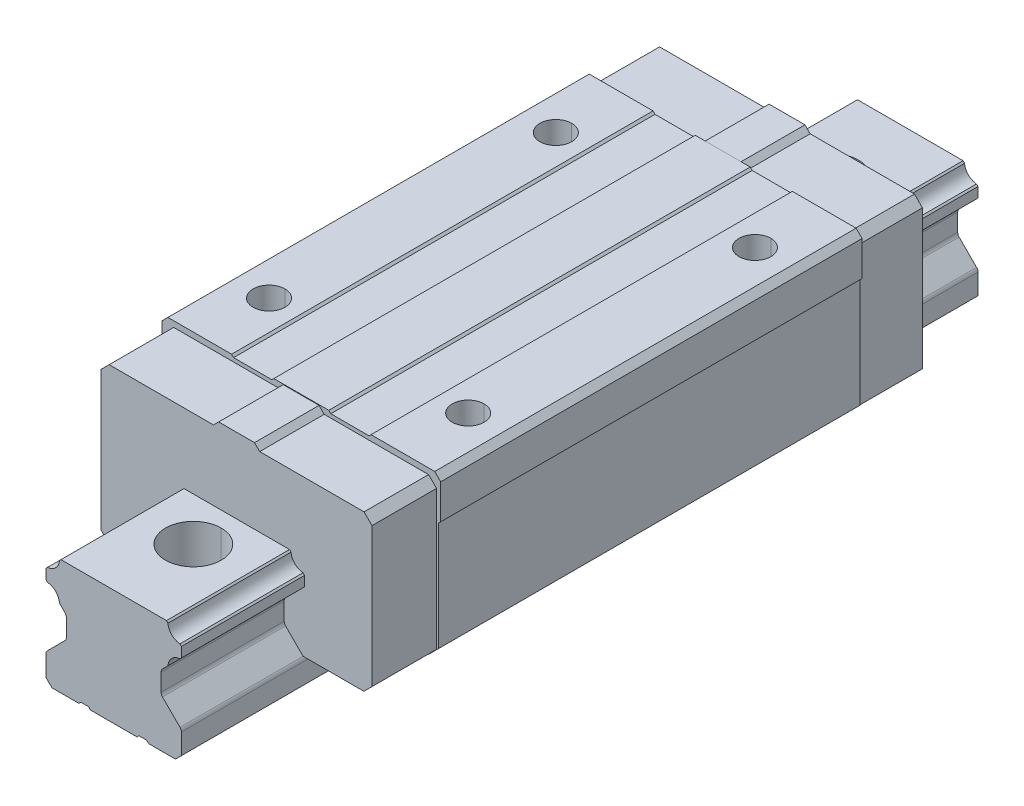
ISO-10303-21;
HEADER;
FILE_DESCRIPTION(('STEP AP214'),'2;1');
FILE_NAME('part.step','',(''),(''),'','','');
FILE_SCHEMA(('AUTOMOTIVE_DESIGN { 1 0 10303 214 1 1 1 1 }'));
ENDSEC;
DATA;
#1=APPLICATION_CONTEXT('core data for automotive mechanical design processes');
#2=APPLICATION_PROTOCOL_DEFINITION('international standard','automotive_design',2000,#1);
#3=PRODUCT_CONTEXT('',#1,'mechanical');
#4=PRODUCT('Part','Part','',(#3));
#5=PRODUCT_RELATED_PRODUCT_CATEGORY('part','',(#4));
#6=PRODUCT_DEFINITION_FORMATION('','',#4);
#7=PRODUCT_DEFINITION_CONTEXT('part definition',#1,'design');
#8=PRODUCT_DEFINITION('design','',#6,#7);
#9=PRODUCT_DEFINITION_SHAPE('','',#8);
#10=(LENGTH_UNIT() NAMED_UNIT(*) SI_UNIT(.MILLI.,.METRE.));
#11=(NAMED_UNIT(*) PLANE_ANGLE_UNIT() SI_UNIT($,.RADIAN.));
#12=(NAMED_UNIT(*) SI_UNIT($,.STERADIAN.) SOLID_ANGLE_UNIT());
#13=UNCERTAINTY_MEASURE_WITH_UNIT(LENGTH_MEASURE(1.E-05),#10,'distance_accuracy_value','');
#14=(GEOMETRIC_REPRESENTATION_CONTEXT(3) GLOBAL_UNCERTAINTY_ASSIGNED_CONTEXT((#13)) GLOBAL_UNIT_ASSIGNED_CONTEXT((#10,
#11,#12)) REPRESENTATION_CONTEXT('',''));
#15=CARTESIAN_POINT('',(0.,0.,0.));
#16=DIRECTION('',(0.,0.,1.));
#17=DIRECTION('',(1.,0.,0.));
#18=AXIS2_PLACEMENT_3D('',#15,#16,#17);
#19=CARTESIAN_POINT('',(-25.,26.,36.));
#20=DIRECTION('',(0.,1.,0.));
#21=DIRECTION('',(0.,0.,1.));
#22=AXIS2_PLACEMENT_3D('',#19,#20,#21);
#23=CYLINDRICAL_SURFACE('',#22,4.);
#24=CARTESIAN_POINT('',(-25.,7.,36.));
#25=DIRECTION('',(0.,1.,0.));
#26=DIRECTION('',(0.,0.,1.));
#27=AXIS2_PLACEMENT_3D('',#24,#25,#26);
#28=CIRCLE('',#27,4.);
#29=CARTESIAN_POINT('',(-25.,7.,32.));
#30=VERTEX_POINT('',#29);
#31=CARTESIAN_POINT('',(-25.,7.,40.));
#32=VERTEX_POINT('',#31);
#33=EDGE_CURVE('P0_E690',#30,#32,#28,.T.);
#34=ORIENTED_EDGE('',*,*,#33,.F.);
#35=DIRECTION('',(0.,1.,0.));
#36=VECTOR('',#35,1.);
#37=CARTESIAN_POINT('',(-25.,26.,32.));
#38=LINE('',#37,#36);
#39=CARTESIAN_POINT('',(-25.,19.,32.));
#40=VERTEX_POINT('',#39);
#41=EDGE_CURVE('P0_E770',#30,#40,#38,.T.);
#42=ORIENTED_EDGE('',*,*,#41,.T.);
#43=CARTESIAN_POINT('',(-25.,19.,36.));
#44=DIRECTION('',(0.,1.,0.));
#45=DIRECTION('',(0.,0.,1.));
#46=AXIS2_PLACEMENT_3D('',#43,#44,#45);
#47=CIRCLE('',#46,4.);
#48=CARTESIAN_POINT('',(-25.,19.,40.));
#49=VERTEX_POINT('',#48);
#50=EDGE_CURVE('P0_E674',#40,#49,#47,.T.);
#51=ORIENTED_EDGE('',*,*,#50,.T.);
#52=DIRECTION('',(0.,1.,0.));
#53=VECTOR('',#52,1.);
#54=CARTESIAN_POINT('',(-25.,26.,40.));
#55=LINE('',#54,#53);
#56=EDGE_CURVE('P0_E844',#32,#49,#55,.T.);
#57=ORIENTED_EDGE('',*,*,#56,.F.);
#58=EDGE_LOOP('',(#34,#42,#51,#57));
#59=FACE_BOUND('',#58,.T.);
#60=ADVANCED_FACE('P0_F17',(#59),#23,.F.);
#61=CARTESIAN_POINT('',(-25.,26.,-36.));
#62=DIRECTION('',(0.,1.,0.));
#63=DIRECTION('',(0.,0.,1.));
#64=AXIS2_PLACEMENT_3D('',#61,#62,#63);
#65=CYLINDRICAL_SURFACE('',#64,4.);
#66=CARTESIAN_POINT('',(-25.,7.,-36.));
#67=DIRECTION('',(0.,1.,0.));
#68=DIRECTION('',(0.,0.,1.));
#69=AXIS2_PLACEMENT_3D('',#66,#67,#68);
#70=CIRCLE('',#69,4.);
#71=CARTESIAN_POINT('',(-25.,7.,-40.));
#72=VERTEX_POINT('',#71);
#73=CARTESIAN_POINT('',(-25.,7.,-32.));
#74=VERTEX_POINT('',#73);
#75=EDGE_CURVE('P0_E647',#72,#74,#70,.T.);
#76=ORIENTED_EDGE('',*,*,#75,.F.);
#77=DIRECTION('',(0.,1.,0.));
#78=VECTOR('',#77,1.);
#79=CARTESIAN_POINT('',(-25.,26.,-40.));
#80=LINE('',#79,#78);
#81=CARTESIAN_POINT('',(-25.,19.,-40.));
#82=VERTEX_POINT('',#81);
#83=EDGE_CURVE('P0_E633',#72,#82,#80,.T.);
#84=ORIENTED_EDGE('',*,*,#83,.T.);
#85=CARTESIAN_POINT('',(-25.,19.,-36.));
#86=DIRECTION('',(0.,1.,0.));
#87=DIRECTION('',(0.,0.,1.));
#88=AXIS2_PLACEMENT_3D('',#85,#86,#87);
#89=CIRCLE('',#88,4.);
#90=CARTESIAN_POINT('',(-25.,19.,-32.));
#91=VERTEX_POINT('',#90);
#92=EDGE_CURVE('P0_E671',#82,#91,#89,.T.);
#93=ORIENTED_EDGE('',*,*,#92,.T.);
#94=DIRECTION('',(0.,1.,0.));
#95=VECTOR('',#94,1.);
#96=CARTESIAN_POINT('',(-25.,26.,-32.));
#97=LINE('',#96,#95);
#98=EDGE_CURVE('P0_E643',#74,#91,#97,.T.);
#99=ORIENTED_EDGE('',*,*,#98,.F.);
#100=EDGE_LOOP('',(#76,#84,#93,#99));
#101=FACE_BOUND('',#100,.T.);
#102=ADVANCED_FACE('P0_F648',(#101),#65,.F.);
#103=CARTESIAN_POINT('',(25.,26.,36.));
#104=DIRECTION('',(0.,1.,0.));
#105=DIRECTION('',(0.,0.,1.));
#106=AXIS2_PLACEMENT_3D('',#103,#104,#105);
#107=CYLINDRICAL_SURFACE('',#106,4.);
#108=CARTESIAN_POINT('',(25.,7.,36.));
#109=DIRECTION('',(0.,1.,0.));
#110=DIRECTION('',(0.,0.,1.));
#111=AXIS2_PLACEMENT_3D('',#108,#109,#110);
#112=CIRCLE('',#111,4.);
#113=CARTESIAN_POINT('',(25.,7.,32.));
#114=VERTEX_POINT('',#113);
#115=CARTESIAN_POINT('',(25.,7.,40.));
#116=VERTEX_POINT('',#115);
#117=EDGE_CURVE('P0_E655',#114,#116,#112,.T.);
#118=ORIENTED_EDGE('',*,*,#117,.F.);
#119=DIRECTION('',(0.,1.,0.));
#120=VECTOR('',#119,1.);
#121=CARTESIAN_POINT('',(25.,26.,32.));
#122=LINE('',#121,#120);
#123=CARTESIAN_POINT('',(25.,19.,32.));
#124=VERTEX_POINT('',#123);
#125=EDGE_CURVE('P0_E666',#114,#124,#122,.T.);
#126=ORIENTED_EDGE('',*,*,#125,.T.);
#127=CARTESIAN_POINT('',(25.,19.,36.));
#128=DIRECTION('',(0.,1.,0.));
#129=DIRECTION('',(0.,0.,1.));
#130=AXIS2_PLACEMENT_3D('',#127,#128,#129);
#131=CIRCLE('',#130,4.);
#132=CARTESIAN_POINT('',(25.,19.,40.));
#133=VERTEX_POINT('',#132);
#134=EDGE_CURVE('P0_E965',#124,#133,#131,.T.);
#135=ORIENTED_EDGE('',*,*,#134,.T.);
#136=DIRECTION('',(0.,1.,0.));
#137=VECTOR('',#136,1.);
#138=CARTESIAN_POINT('',(25.,26.,40.));
#139=LINE('',#138,#137);
#140=EDGE_CURVE('P0_E665',#116,#133,#139,.T.);
#141=ORIENTED_EDGE('',*,*,#140,.F.);
#142=EDGE_LOOP('',(#118,#126,#135,#141));
#143=FACE_BOUND('',#142,.T.);
#144=ADVANCED_FACE('P0_F1591',(#143),#107,.F.);
#145=CARTESIAN_POINT('',(25.,26.,-36.));
#146=DIRECTION('',(0.,1.,0.));
#147=DIRECTION('',(0.,0.,1.));
#148=AXIS2_PLACEMENT_3D('',#145,#146,#147);
#149=CYLINDRICAL_SURFACE('',#148,4.);
#150=CARTESIAN_POINT('',(25.,7.,-36.));
#151=DIRECTION('',(0.,1.,0.));
#152=DIRECTION('',(0.,0.,1.));
#153=AXIS2_PLACEMENT_3D('',#150,#151,#152);
#154=CIRCLE('',#153,4.);
#155=CARTESIAN_POINT('',(25.,7.,-40.));
#156=VERTEX_POINT('',#155);
#157=CARTESIAN_POINT('',(25.,7.,-32.));
#158=VERTEX_POINT('',#157);
#159=EDGE_CURVE('P0_E1630',#156,#158,#154,.T.);
#160=ORIENTED_EDGE('',*,*,#159,.F.);
#161=DIRECTION('',(0.,1.,0.));
#162=VECTOR('',#161,1.);
#163=CARTESIAN_POINT('',(25.,26.,-40.));
#164=LINE('',#163,#162);
#165=CARTESIAN_POINT('',(25.,19.,-40.));
#166=VERTEX_POINT('',#165);
#167=EDGE_CURVE('P0_E720',#156,#166,#164,.T.);
#168=ORIENTED_EDGE('',*,*,#167,.T.);
#169=CARTESIAN_POINT('',(25.,19.,-36.));
#170=DIRECTION('',(0.,1.,0.));
#171=DIRECTION('',(0.,0.,1.));
#172=AXIS2_PLACEMENT_3D('',#169,#170,#171);
#173=CIRCLE('',#172,4.);
#174=CARTESIAN_POINT('',(25.,19.,-32.));
#175=VERTEX_POINT('',#174);
#176=EDGE_CURVE('P0_E958',#166,#175,#173,.T.);
#177=ORIENTED_EDGE('',*,*,#176,.T.);
#178=DIRECTION('',(0.,1.,0.));
#179=VECTOR('',#178,1.);
#180=CARTESIAN_POINT('',(25.,26.,-32.));
#181=LINE('',#180,#179);
#182=EDGE_CURVE('P0_E724',#158,#175,#181,.T.);
#183=ORIENTED_EDGE('',*,*,#182,.F.);
#184=EDGE_LOOP('',(#160,#168,#177,#183));
#185=FACE_BOUND('',#184,.T.);
#186=ADVANCED_FACE('P0_F1679',(#185),#149,.F.);
#187=CARTESIAN_POINT('',(-13.25142135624,0.,-52.9));
#188=DIRECTION('',(0.,-1.,0.));
#189=DIRECTION('',(0.,0.,-1.));
#190=AXIS2_PLACEMENT_3D('',#187,#188,#189);
#191=PLANE('',#190);
#192=DIRECTION('',(-1.,0.,0.));
#193=VECTOR('',#192,1.);
#194=CARTESIAN_POINT('',(-13.25142135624,0.,69.1));
#195=LINE('',#194,#193);
#196=CARTESIAN_POINT('',(13.2514213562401,0.,69.1));
#197=VERTEX_POINT('',#196);
#198=CARTESIAN_POINT('',(-13.2514213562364,0.,69.1));
#199=VERTEX_POINT('',#198);
#200=EDGE_CURVE('P0_E25',#197,#199,#195,.T.);
#201=ORIENTED_EDGE('',*,*,#200,.T.);
#202=DIRECTION('',(0.,0.,-1.));
#203=VECTOR('',#202,1.);
#204=CARTESIAN_POINT('',(-13.2514213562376,0.,-52.9));
#205=LINE('',#204,#203);
#206=CARTESIAN_POINT('',(-13.2514213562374,-5.31024154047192E-13,-69.1));
#207=VERTEX_POINT('',#206);
#208=EDGE_CURVE('P0_E10',#199,#207,#205,.T.);
#209=ORIENTED_EDGE('',*,*,#208,.T.);
#210=DIRECTION('',(1.,0.,0.));
#211=VECTOR('',#210,1.);
#212=CARTESIAN_POINT('',(-13.25142135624,0.,-69.1));
#213=LINE('',#212,#211);
#214=CARTESIAN_POINT('',(13.2514213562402,0.,-69.1));
#215=VERTEX_POINT('',#214);
#216=EDGE_CURVE('P0_E1393',#207,#215,#213,.T.);
#217=ORIENTED_EDGE('',*,*,#216,.T.);
#218=DIRECTION('',(0.,0.,1.));
#219=VECTOR('',#218,1.);
#220=CARTESIAN_POINT('',(13.2514213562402,0.,-52.9));
#221=LINE('',#220,#219);
#222=EDGE_CURVE('P0_E1403',#215,#197,#221,.T.);
#223=ORIENTED_EDGE('',*,*,#222,.T.);
#224=EDGE_LOOP('',(#201,#209,#217,#223));
#225=FACE_BOUND('',#224,.T.);
#226=ADVANCED_FACE('P0_F1411',(#225),#191,.T.);
#227=CARTESIAN_POINT('',(-13.62681920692,-0.3753978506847,-52.9));
#228=DIRECTION('',(0.707106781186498,-0.707106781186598,0.));
#229=DIRECTION('',(0.,0.,-1.));
#230=AXIS2_PLACEMENT_3D('',#227,#228,#229);
#231=PLANE('',#230);
#232=DIRECTION('',(-0.707106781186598,-0.707106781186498,0.));
#233=VECTOR('',#232,1.);
#234=CARTESIAN_POINT('',(-13.62681920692,-0.3753978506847,69.1));
#235=LINE('',#234,#233);
#236=CARTESIAN_POINT('',(-13.626819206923,-0.375397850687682,69.1));
#237=VERTEX_POINT('',#236);
#238=EDGE_CURVE('P0_E1406',#199,#237,#235,.T.);
#239=ORIENTED_EDGE('',*,*,#238,.T.);
#240=DIRECTION('',(0.,0.,-1.));
#241=VECTOR('',#240,1.);
#242=CARTESIAN_POINT('',(-13.6268192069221,-0.375397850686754,-52.9));
#243=LINE('',#242,#241);
#244=CARTESIAN_POINT('',(-13.626819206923,-0.375397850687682,-69.1));
#245=VERTEX_POINT('',#244);
#246=EDGE_CURVE('P0_E1386',#237,#245,#243,.T.);
#247=ORIENTED_EDGE('',*,*,#246,.T.);
#248=DIRECTION('',(0.707106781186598,0.707106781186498,0.));
#249=VECTOR('',#248,1.);
#250=CARTESIAN_POINT('',(-13.62681920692,-0.3753978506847,-69.1));
#251=LINE('',#250,#249);
#252=EDGE_CURVE('P0_E1397',#245,#207,#251,.T.);
#253=ORIENTED_EDGE('',*,*,#252,.T.);
#254=ORIENTED_EDGE('',*,*,#208,.F.);
#255=EDGE_LOOP('',(#239,#247,#253,#254));
#256=FACE_BOUND('',#255,.T.);
#257=ADVANCED_FACE('P0_F1417',(#256),#231,.T.);
#258=CARTESIAN_POINT('',(0.,0.,69.1));
#259=DIRECTION('',(0.,0.,1.));
#260=DIRECTION('',(1.,0.,0.));
#261=AXIS2_PLACEMENT_3D('',#258,#259,#260);
#262=PLANE('',#261);
#263=CARTESIAN_POINT('',(13.1,-16.26154209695,69.1));
#264=DIRECTION('',(0.,0.,-1.));
#265=DIRECTION('',(1.,0.,0.));
#266=AXIS2_PLACEMENT_3D('',#263,#264,#265);
#267=CIRCLE('',#266,1.2);
#268=CARTESIAN_POINT('',(12.2514718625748,-17.1100702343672,69.1));
#269=VERTEX_POINT('',#268);
#270=CARTESIAN_POINT('',(11.9000000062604,-16.2616752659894,69.1));
#271=VERTEX_POINT('',#270);
#272=EDGE_CURVE('P0_E1041',#269,#271,#267,.T.);
#273=ORIENTED_EDGE('',*,*,#272,.F.);
#274=DIRECTION('',(0.707106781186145,-0.70710678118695,0.));
#275=VECTOR('',#274,1.);
#276=CARTESIAN_POINT('',(12.25147186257,-17.110070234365,69.1));
#277=LINE('',#276,#275);
#278=CARTESIAN_POINT('',(16.6414016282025,-21.4999999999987,69.1));
#279=VERTEX_POINT('',#278);
#280=EDGE_CURVE('P0_E865',#269,#279,#277,.T.);
#281=ORIENTED_EDGE('',*,*,#280,.T.);
#282=DIRECTION('',(1.,0.,0.));
#283=VECTOR('',#282,1.);
#284=CARTESIAN_POINT('',(0.,-21.5,69.1));
#285=LINE('',#284,#283);
#286=CARTESIAN_POINT('',(31.90776298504,-21.5,69.1));
#287=VERTEX_POINT('',#286);
#288=EDGE_CURVE('P0_E1263',#279,#287,#285,.T.);
#289=ORIENTED_EDGE('',*,*,#288,.T.);
#290=DIRECTION('',(0.707106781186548,0.707106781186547,0.));
#291=VECTOR('',#290,1.);
#292=CARTESIAN_POINT('',(31.90776298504,-21.5,69.1));
#293=LINE('',#292,#291);
#294=CARTESIAN_POINT('',(33.95352013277,-19.45424285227,69.1));
#295=VERTEX_POINT('',#294);
#296=EDGE_CURVE('P0_E1270',#287,#295,#293,.T.);
#297=ORIENTED_EDGE('',*,*,#296,.T.);
#298=DIRECTION('',(0.,1.,0.));
#299=VECTOR('',#298,1.);
#300=CARTESIAN_POINT('',(33.95352013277,0.,69.1));
#301=LINE('',#300,#299);
#302=CARTESIAN_POINT('',(33.95352013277,15.54575714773,69.1));
#303=VERTEX_POINT('',#302);
#304=EDGE_CURVE('P0_E1046',#295,#303,#301,.T.);
#305=ORIENTED_EDGE('',*,*,#304,.T.);
#306=DIRECTION('',(-0.707106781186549,0.707106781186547,0.));
#307=VECTOR('',#306,1.);
#308=CARTESIAN_POINT('',(33.95352013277,15.54575714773,69.1));
#309=LINE('',#308,#307);
#310=CARTESIAN_POINT('',(31.95352013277,17.54575714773,69.1));
#311=VERTEX_POINT('',#310);
#312=EDGE_CURVE('P0_E835',#303,#311,#309,.T.);
#313=ORIENTED_EDGE('',*,*,#312,.T.);
#314=DIRECTION('',(-1.,0.,0.));
#315=VECTOR('',#314,1.);
#316=CARTESIAN_POINT('',(0.,17.54575714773,69.1));
#317=LINE('',#316,#315);
#318=CARTESIAN_POINT('',(5.753520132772,17.54575714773,69.1));
#319=VERTEX_POINT('',#318);
#320=EDGE_CURVE('P0_E955',#311,#319,#317,.T.);
#321=ORIENTED_EDGE('',*,*,#320,.T.);
#322=DIRECTION('',(-0.707106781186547,0.707106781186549,0.));
#323=VECTOR('',#322,1.);
#324=CARTESIAN_POINT('',(5.753520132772,17.54575714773,69.1));
#325=LINE('',#324,#323);
#326=CARTESIAN_POINT('',(4.453520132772,18.84575714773,69.1));
#327=VERTEX_POINT('',#326);
#328=EDGE_CURVE('P0_E1284',#319,#327,#325,.T.);
#329=ORIENTED_EDGE('',*,*,#328,.T.);
#330=DIRECTION('',(-1.,0.,0.));
#331=VECTOR('',#330,1.);
#332=CARTESIAN_POINT('',(0.,18.84575714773,69.1));
#333=LINE('',#332,#331);
#334=CARTESIAN_POINT('',(-4.546479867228,18.84575714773,69.1));
#335=VERTEX_POINT('',#334);
#336=EDGE_CURVE('P0_E1291',#327,#335,#333,.T.);
#337=ORIENTED_EDGE('',*,*,#336,.T.);
#338=DIRECTION('',(-0.707106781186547,-0.707106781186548,0.));
#339=VECTOR('',#338,1.);
#340=CARTESIAN_POINT('',(-4.546479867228,18.84575714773,69.1));
#341=LINE('',#340,#339);
#342=CARTESIAN_POINT('',(-5.846479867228,17.54575714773,69.1));
#343=VERTEX_POINT('',#342);
#344=EDGE_CURVE('P0_E1298',#335,#343,#341,.T.);
#345=ORIENTED_EDGE('',*,*,#344,.T.);
#346=DIRECTION('',(-1.,0.,0.));
#347=VECTOR('',#346,1.);
#348=CARTESIAN_POINT('',(0.,17.54575714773,69.1));
#349=LINE('',#348,#347);
#350=CARTESIAN_POINT('',(-32.04647986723,17.54575714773,69.1));
#351=VERTEX_POINT('',#350);
#352=EDGE_CURVE('P0_E681',#343,#351,#349,.T.);
#353=ORIENTED_EDGE('',*,*,#352,.T.);
#354=DIRECTION('',(-0.707106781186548,-0.707106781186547,0.));
#355=VECTOR('',#354,1.);
#356=CARTESIAN_POINT('',(-32.04647986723,17.54575714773,69.1));
#357=LINE('',#356,#355);
#358=CARTESIAN_POINT('',(-34.04647986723,15.54575714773,69.1));
#359=VERTEX_POINT('',#358);
#360=EDGE_CURVE('P0_E1306',#351,#359,#357,.T.);
#361=ORIENTED_EDGE('',*,*,#360,.T.);
#362=DIRECTION('',(0.,-1.,0.));
#363=VECTOR('',#362,1.);
#364=CARTESIAN_POINT('',(-34.04647986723,0.,69.1));
#365=LINE('',#364,#363);
#366=CARTESIAN_POINT('',(-34.04647986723,-19.45352013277,69.1));
#367=VERTEX_POINT('',#366);
#368=EDGE_CURVE('P0_E1313',#359,#367,#365,.T.);
#369=ORIENTED_EDGE('',*,*,#368,.T.);
#370=DIRECTION('',(0.707106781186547,-0.707106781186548,0.));
#371=VECTOR('',#370,1.);
#372=CARTESIAN_POINT('',(-34.04647986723,-19.45352013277,69.1));
#373=LINE('',#372,#371);
#374=CARTESIAN_POINT('',(-32.,-21.5,69.1));
#375=VERTEX_POINT('',#374);
#376=EDGE_CURVE('P0_E1325',#367,#375,#373,.T.);
#377=ORIENTED_EDGE('',*,*,#376,.T.);
#378=DIRECTION('',(1.,0.,0.));
#379=VECTOR('',#378,1.);
#380=CARTESIAN_POINT('',(0.,-21.5,69.1));
#381=LINE('',#380,#379);
#382=CARTESIAN_POINT('',(-16.6414016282,-21.5,69.1));
#383=VERTEX_POINT('',#382);
#384=EDGE_CURVE('P0_E1326',#375,#383,#381,.T.);
#385=ORIENTED_EDGE('',*,*,#384,.T.);
#386=DIRECTION('',(0.707106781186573,0.707106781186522,0.));
#387=VECTOR('',#386,1.);
#388=CARTESIAN_POINT('',(-16.6414016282,-21.5,69.1));
#389=LINE('',#388,#387);
#390=CARTESIAN_POINT('',(-12.251471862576,-17.1100702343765,69.1));
#391=VERTEX_POINT('',#390);
#392=EDGE_CURVE('P0_E1338',#383,#391,#389,.T.);
#393=ORIENTED_EDGE('',*,*,#392,.T.);
#394=CARTESIAN_POINT('',(-13.1,-16.26154209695,69.1));
#395=DIRECTION('',(0.,0.,-1.));
#396=DIRECTION('',(1.,0.,0.));
#397=AXIS2_PLACEMENT_3D('',#394,#395,#396);
#398=CIRCLE('',#397,1.2);
#399=CARTESIAN_POINT('',(-11.9000000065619,-16.2617195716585,69.1));
#400=VERTEX_POINT('',#399);
#401=EDGE_CURVE('P0_E709',#400,#391,#398,.T.);
#402=ORIENTED_EDGE('',*,*,#401,.F.);
#403=DIRECTION('',(0.,1.,0.));
#404=VECTOR('',#403,1.);
#405=CARTESIAN_POINT('',(-11.9000000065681,0.,69.1));
#406=LINE('',#405,#404);
#407=CARTESIAN_POINT('',(-11.9000000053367,-11.8583444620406,69.1));
#408=VERTEX_POINT('',#407);
#409=EDGE_CURVE('P0_E1348',#400,#408,#406,.T.);
#410=ORIENTED_EDGE('',*,*,#409,.T.);
#411=CARTESIAN_POINT('',(-13.1,-11.85847763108,69.1));
#412=DIRECTION('',(0.,0.,-1.));
#413=DIRECTION('',(1.,0.,0.));
#414=AXIS2_PLACEMENT_3D('',#411,#412,#413);
#415=CIRCLE('',#414,1.2);
#416=CARTESIAN_POINT('',(-12.251471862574,-11.0099494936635,69.1));
#417=VERTEX_POINT('',#416);
#418=EDGE_CURVE('P0_E830',#417,#408,#415,.T.);
#419=ORIENTED_EDGE('',*,*,#418,.F.);
#420=DIRECTION('',(-0.70710678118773,0.707106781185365,0.));
#421=VECTOR('',#420,1.);
#422=CARTESIAN_POINT('',(-12.2514718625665,-11.0099494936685,69.1));
#423=LINE('',#422,#421);
#424=CARTESIAN_POINT('',(-13.6259433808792,-9.63547797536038,69.1));
#425=VERTEX_POINT('',#424);
#426=EDGE_CURVE('P0_E1016',#417,#425,#423,.T.);
#427=ORIENTED_EDGE('',*,*,#426,.T.);
#428=CARTESIAN_POINT('',(-16.86757359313,-9.868573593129,69.1));
#429=DIRECTION('',(0.,0.,1.));
#430=DIRECTION('',(1.,0.,0.));
#431=AXIS2_PLACEMENT_3D('',#428,#429,#430);
#432=CIRCLE('',#431,3.25);
#433=CARTESIAN_POINT('',(-16.6344779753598,-6.62694338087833,69.1));
#434=VERTEX_POINT('',#433);
#435=EDGE_CURVE('P0_E1339',#425,#434,#432,.T.);
#436=ORIENTED_EDGE('',*,*,#435,.T.);
#437=DIRECTION('',(0.707106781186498,-0.707106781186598,0.));
#438=VECTOR('',#437,1.);
#439=CARTESIAN_POINT('',(-16.63447797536,-6.626943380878,69.1));
#440=LINE('',#439,#438);
#441=CARTESIAN_POINT('',(-17.,-6.26142135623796,69.1));
#442=VERTEX_POINT('',#441);
#443=EDGE_CURVE('P0_E918',#442,#434,#440,.T.);
#444=ORIENTED_EDGE('',*,*,#443,.F.);
#445=DIRECTION('',(0.,1.,0.));
#446=VECTOR('',#445,1.);
#447=CARTESIAN_POINT('',(-17.,0.,69.1));
#448=LINE('',#447,#446);
#449=CARTESIAN_POINT('',(-17.,-3.74857864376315,69.1));
#450=VERTEX_POINT('',#449);
#451=EDGE_CURVE('P0_E1358',#442,#450,#448,.T.);
#452=ORIENTED_EDGE('',*,*,#451,.T.);
#453=DIRECTION('',(-0.707106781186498,-0.707106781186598,0.));
#454=VECTOR('',#453,1.);
#455=CARTESIAN_POINT('',(-17.,-3.748578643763,69.1));
#456=LINE('',#455,#454);
#457=CARTESIAN_POINT('',(-16.6226021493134,-3.37118079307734,69.1));
#458=VERTEX_POINT('',#457);
#459=EDGE_CURVE('P0_E1167',#458,#450,#456,.T.);
#460=ORIENTED_EDGE('',*,*,#459,.F.);
#461=CARTESIAN_POINT('',(-16.86757359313,-0.1304264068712,69.1));
#462=DIRECTION('',(0.,0.,1.));
#463=DIRECTION('',(1.,0.,0.));
#464=AXIS2_PLACEMENT_3D('',#461,#462,#463);
#465=CIRCLE('',#464,3.25);
#466=EDGE_CURVE('P0_E864',#458,#237,#465,.T.);
#467=ORIENTED_EDGE('',*,*,#466,.T.);
#468=ORIENTED_EDGE('',*,*,#238,.F.);
#469=ORIENTED_EDGE('',*,*,#200,.F.);
#470=DIRECTION('',(0.707106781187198,-0.707106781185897,0.));
#471=VECTOR('',#470,1.);
#472=CARTESIAN_POINT('',(13.25142135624,0.,69.1));
#473=LINE('',#472,#471);
#474=CARTESIAN_POINT('',(13.626819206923,-0.375397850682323,69.1));
#475=VERTEX_POINT('',#474);
#476=EDGE_CURVE('P0_E1400',#197,#475,#473,.T.);
#477=ORIENTED_EDGE('',*,*,#476,.T.);
#478=CARTESIAN_POINT('',(16.86757359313,-0.1304264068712,69.1));
#479=DIRECTION('',(0.,0.,1.));
#480=DIRECTION('',(1.,0.,0.));
#481=AXIS2_PLACEMENT_3D('',#478,#479,#480);
#482=CIRCLE('',#481,3.25);
#483=CARTESIAN_POINT('',(16.6226021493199,-3.37118079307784,69.1));
#484=VERTEX_POINT('',#483);
#485=EDGE_CURVE('P0_E995',#475,#484,#482,.T.);
#486=ORIENTED_EDGE('',*,*,#485,.T.);
#487=DIRECTION('',(-0.707106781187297,0.707106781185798,0.));
#488=VECTOR('',#487,1.);
#489=CARTESIAN_POINT('',(16.62260214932,-3.371180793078,69.1));
#490=LINE('',#489,#488);
#491=CARTESIAN_POINT('',(17.,-3.74857864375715,69.1));
#492=VERTEX_POINT('',#491);
#493=EDGE_CURVE('P0_E699',#492,#484,#490,.T.);
#494=ORIENTED_EDGE('',*,*,#493,.F.);
#495=DIRECTION('',(0.,-1.,0.));
#496=VECTOR('',#495,1.);
#497=CARTESIAN_POINT('',(17.,0.,69.1));
#498=LINE('',#497,#496);
#499=CARTESIAN_POINT('',(17.,-6.261421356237,69.1));
#500=VERTEX_POINT('',#499);
#501=EDGE_CURVE('P0_E676',#492,#500,#498,.T.);
#502=ORIENTED_EDGE('',*,*,#501,.T.);
#503=DIRECTION('',(0.707106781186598,0.707106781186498,0.));
#504=VECTOR('',#503,1.);
#505=CARTESIAN_POINT('',(17.,-6.261421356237,69.1));
#506=LINE('',#505,#504);
#507=CARTESIAN_POINT('',(16.6344779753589,-6.62694338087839,69.1));
#508=VERTEX_POINT('',#507);
#509=EDGE_CURVE('P0_E750',#508,#500,#506,.T.);
#510=ORIENTED_EDGE('',*,*,#509,.F.);
#511=CARTESIAN_POINT('',(16.86757359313,-9.868573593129,69.1));
#512=DIRECTION('',(0.,0.,1.));
#513=DIRECTION('',(1.,0.,0.));
#514=AXIS2_PLACEMENT_3D('',#511,#512,#513);
#515=CIRCLE('',#514,3.25);
#516=CARTESIAN_POINT('',(13.6259433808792,-9.63547797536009,69.1));
#517=VERTEX_POINT('',#516);
#518=EDGE_CURVE('P0_E1064',#508,#517,#515,.T.);
#519=ORIENTED_EDGE('',*,*,#518,.T.);
#520=DIRECTION('',(-0.707106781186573,-0.707106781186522,0.));
#521=VECTOR('',#520,1.);
#522=CARTESIAN_POINT('',(13.6259433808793,-9.63547797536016,69.1));
#523=LINE('',#522,#521);
#524=CARTESIAN_POINT('',(12.2514718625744,-11.0099494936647,69.1));
#525=VERTEX_POINT('',#524);
#526=EDGE_CURVE('P0_E783',#517,#525,#523,.T.);
#527=ORIENTED_EDGE('',*,*,#526,.T.);
#528=CARTESIAN_POINT('',(13.1,-11.85847763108,69.1));
#529=DIRECTION('',(0.,0.,-1.));
#530=DIRECTION('',(1.,0.,0.));
#531=AXIS2_PLACEMENT_3D('',#528,#529,#530);
#532=CIRCLE('',#531,1.2);
#533=CARTESIAN_POINT('',(11.900000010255,-11.8582557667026,69.1));
#534=VERTEX_POINT('',#533);
#535=EDGE_CURVE('P0_E1112',#534,#525,#532,.T.);
#536=ORIENTED_EDGE('',*,*,#535,.F.);
#537=DIRECTION('',(0.,-1.,0.));
#538=VECTOR('',#537,1.);
#539=CARTESIAN_POINT('',(11.9000000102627,0.,69.1));
#540=LINE('',#539,#538);
#541=EDGE_CURVE('P0_E782',#534,#271,#540,.T.);
#542=ORIENTED_EDGE('',*,*,#541,.T.);
#543=EDGE_LOOP('',(#273,#281,#289,#297,#305,#313,#321,#329,#337,#345,#353,#361,#369,#377,#385,
#393,#402,#410,#419,#427,#436,#444,#452,#460,#467,#468,#469,#477,#486,#494,#502,#510,#519,#527,
#536,#542));
#544=FACE_BOUND('',#543,.T.);
#545=ADVANCED_FACE('P0_F1414',(#544),#262,.T.);
#546=CARTESIAN_POINT('',(13.25142135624,0.,-52.9));
#547=DIRECTION('',(-0.707106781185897,-0.707106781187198,0.));
#548=DIRECTION('',(-0.707106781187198,0.707106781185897,0.));
#549=AXIS2_PLACEMENT_3D('',#546,#547,#548);
#550=PLANE('',#549);
#551=ORIENTED_EDGE('',*,*,#476,.F.);
#552=ORIENTED_EDGE('',*,*,#222,.F.);
#553=DIRECTION('',(0.707106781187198,-0.707106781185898,0.));
#554=VECTOR('',#553,1.);
#555=CARTESIAN_POINT('',(13.25142135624,0.,-69.1));
#556=LINE('',#555,#554);
#557=CARTESIAN_POINT('',(13.626819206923,-0.375397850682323,-69.1));
#558=VERTEX_POINT('',#557);
#559=EDGE_CURVE('P0_E1390',#215,#558,#556,.T.);
#560=ORIENTED_EDGE('',*,*,#559,.T.);
#561=DIRECTION('',(0.,0.,1.));
#562=VECTOR('',#561,1.);
#563=CARTESIAN_POINT('',(13.6268192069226,-0.375397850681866,-52.9));
#564=LINE('',#563,#562);
#565=EDGE_CURVE('P0_E991',#558,#475,#564,.T.);
#566=ORIENTED_EDGE('',*,*,#565,.T.);
#567=EDGE_LOOP('',(#551,#552,#560,#566));
#568=FACE_BOUND('',#567,.T.);
#569=ADVANCED_FACE('P0_F1432',(#568),#550,.T.);
#570=CARTESIAN_POINT('',(0.,0.,-69.1));
#571=DIRECTION('',(0.,0.,1.));
#572=DIRECTION('',(1.,0.,0.));
#573=AXIS2_PLACEMENT_3D('',#570,#571,#572);
#574=PLANE('',#573);
#575=CARTESIAN_POINT('',(13.1,-16.26154209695,-69.1));
#576=DIRECTION('',(0.,0.,1.));
#577=DIRECTION('',(1.,0.,0.));
#578=AXIS2_PLACEMENT_3D('',#575,#576,#577);
#579=CIRCLE('',#578,1.2);
#580=CARTESIAN_POINT('',(11.9000000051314,-16.26154209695,-69.1));
#581=VERTEX_POINT('',#580);
#582=CARTESIAN_POINT('',(12.2514718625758,-17.1100702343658,-69.1));
#583=VERTEX_POINT('',#582);
#584=EDGE_CURVE('P0_E1159',#581,#583,#579,.T.);
#585=ORIENTED_EDGE('',*,*,#584,.F.);
#586=DIRECTION('',(0.,-1.,0.));
#587=VECTOR('',#586,1.);
#588=CARTESIAN_POINT('',(11.9000000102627,0.,-69.1));
#589=LINE('',#588,#587);
#590=CARTESIAN_POINT('',(11.900000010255,-11.8582557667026,-69.1));
#591=VERTEX_POINT('',#590);
#592=EDGE_CURVE('P0_E925',#591,#581,#589,.T.);
#593=ORIENTED_EDGE('',*,*,#592,.F.);
#594=CARTESIAN_POINT('',(13.1,-11.85847763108,-69.1));
#595=DIRECTION('',(0.,0.,1.));
#596=DIRECTION('',(1.,0.,0.));
#597=AXIS2_PLACEMENT_3D('',#594,#595,#596);
#598=CIRCLE('',#597,1.2);
#599=CARTESIAN_POINT('',(12.2514718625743,-11.0099494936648,-69.1));
#600=VERTEX_POINT('',#599);
#601=EDGE_CURVE('P0_E1017',#600,#591,#598,.T.);
#602=ORIENTED_EDGE('',*,*,#601,.F.);
#603=DIRECTION('',(-0.707106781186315,-0.70710678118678,0.));
#604=VECTOR('',#603,1.);
#605=CARTESIAN_POINT('',(13.6259433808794,-9.63547797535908,-69.1));
#606=LINE('',#605,#604);
#607=CARTESIAN_POINT('',(13.6259433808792,-9.63547797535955,-69.1));
#608=VERTEX_POINT('',#607);
#609=EDGE_CURVE('P0_E779',#608,#600,#606,.T.);
#610=ORIENTED_EDGE('',*,*,#609,.F.);
#611=CARTESIAN_POINT('',(16.86757359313,-9.868573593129,-69.1));
#612=DIRECTION('',(0.,0.,1.));
#613=DIRECTION('',(1.,0.,0.));
#614=AXIS2_PLACEMENT_3D('',#611,#612,#613);
#615=CIRCLE('',#614,3.25);
#616=CARTESIAN_POINT('',(16.6344779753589,-6.62694338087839,-69.1));
#617=VERTEX_POINT('',#616);
#618=EDGE_CURVE('P0_E1371',#617,#608,#615,.T.);
#619=ORIENTED_EDGE('',*,*,#618,.F.);
#620=DIRECTION('',(-0.707106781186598,-0.707106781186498,0.));
#621=VECTOR('',#620,1.);
#622=CARTESIAN_POINT('',(17.,-6.261421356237,-69.1));
#623=LINE('',#622,#621);
#624=CARTESIAN_POINT('',(17.,-6.26142135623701,-69.1));
#625=VERTEX_POINT('',#624);
#626=EDGE_CURVE('P0_E1145',#625,#617,#623,.T.);
#627=ORIENTED_EDGE('',*,*,#626,.F.);
#628=DIRECTION('',(0.,-1.,0.));
#629=VECTOR('',#628,1.);
#630=CARTESIAN_POINT('',(17.,0.,-69.1));
#631=LINE('',#630,#629);
#632=CARTESIAN_POINT('',(17.,-3.7485786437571,-69.1));
#633=VERTEX_POINT('',#632);
#634=EDGE_CURVE('P0_E678',#633,#625,#631,.T.);
#635=ORIENTED_EDGE('',*,*,#634,.F.);
#636=DIRECTION('',(0.707106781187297,-0.707106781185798,0.));
#637=VECTOR('',#636,1.);
#638=CARTESIAN_POINT('',(16.62260214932,-3.371180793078,-69.1));
#639=LINE('',#638,#637);
#640=CARTESIAN_POINT('',(16.6226021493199,-3.37118079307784,-69.1));
#641=VERTEX_POINT('',#640);
#642=EDGE_CURVE('P0_E751',#641,#633,#639,.T.);
#643=ORIENTED_EDGE('',*,*,#642,.F.);
#644=CARTESIAN_POINT('',(16.86757359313,-0.1304264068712,-69.1));
#645=DIRECTION('',(0.,0.,1.));
#646=DIRECTION('',(1.,0.,0.));
#647=AXIS2_PLACEMENT_3D('',#644,#645,#646);
#648=CIRCLE('',#647,3.25);
#649=EDGE_CURVE('P0_E679',#558,#641,#648,.T.);
#650=ORIENTED_EDGE('',*,*,#649,.F.);
#651=ORIENTED_EDGE('',*,*,#559,.F.);
#652=ORIENTED_EDGE('',*,*,#216,.F.);
#653=ORIENTED_EDGE('',*,*,#252,.F.);
#654=CARTESIAN_POINT('',(-16.86757359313,-0.1304264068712,-69.1));
#655=DIRECTION('',(0.,0.,1.));
#656=DIRECTION('',(1.,0.,0.));
#657=AXIS2_PLACEMENT_3D('',#654,#655,#656);
#658=CIRCLE('',#657,3.25);
#659=CARTESIAN_POINT('',(-16.6226021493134,-3.37118079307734,-69.1));
#660=VERTEX_POINT('',#659);
#661=EDGE_CURVE('P0_E872',#660,#245,#658,.T.);
#662=ORIENTED_EDGE('',*,*,#661,.F.);
#663=DIRECTION('',(0.707106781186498,0.707106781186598,0.));
#664=VECTOR('',#663,1.);
#665=CARTESIAN_POINT('',(-17.,-3.748578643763,-69.1));
#666=LINE('',#665,#664);
#667=CARTESIAN_POINT('',(-17.,-3.74857864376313,-69.1));
#668=VERTEX_POINT('',#667);
#669=EDGE_CURVE('P0_E1175',#668,#660,#666,.T.);
#670=ORIENTED_EDGE('',*,*,#669,.F.);
#671=DIRECTION('',(0.,1.,0.));
#672=VECTOR('',#671,1.);
#673=CARTESIAN_POINT('',(-17.,0.,-69.1));
#674=LINE('',#673,#672);
#675=CARTESIAN_POINT('',(-17.,-6.26142135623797,-69.1));
#676=VERTEX_POINT('',#675);
#677=EDGE_CURVE('P0_E1361',#676,#668,#674,.T.);
#678=ORIENTED_EDGE('',*,*,#677,.F.);
#679=DIRECTION('',(-0.707106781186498,0.707106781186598,0.));
#680=VECTOR('',#679,1.);
#681=CARTESIAN_POINT('',(-16.63447797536,-6.626943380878,-69.1));
#682=LINE('',#681,#680);
#683=CARTESIAN_POINT('',(-16.6344779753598,-6.62694338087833,-69.1));
#684=VERTEX_POINT('',#683);
#685=EDGE_CURVE('P0_E700',#684,#676,#682,.T.);
#686=ORIENTED_EDGE('',*,*,#685,.F.);
#687=CARTESIAN_POINT('',(-16.86757359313,-9.868573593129,-69.1));
#688=DIRECTION('',(0.,0.,1.));
#689=DIRECTION('',(1.,0.,0.));
#690=AXIS2_PLACEMENT_3D('',#687,#688,#689);
#691=CIRCLE('',#690,3.25);
#692=CARTESIAN_POINT('',(-13.6259433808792,-9.63547797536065,-69.1));
#693=VERTEX_POINT('',#692);
#694=EDGE_CURVE('P0_E1342',#693,#684,#691,.T.);
#695=ORIENTED_EDGE('',*,*,#694,.F.);
#696=DIRECTION('',(-0.707106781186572,0.707106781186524,0.));
#697=VECTOR('',#696,1.);
#698=CARTESIAN_POINT('',(-12.2514718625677,-11.0099494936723,-69.1));
#699=LINE('',#698,#697);
#700=CARTESIAN_POINT('',(-12.2514718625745,-11.0099494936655,-69.1));
#701=VERTEX_POINT('',#700);
#702=EDGE_CURVE('P0_E1011',#701,#693,#699,.T.);
#703=ORIENTED_EDGE('',*,*,#702,.F.);
#704=CARTESIAN_POINT('',(-13.1,-11.85847763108,-69.1));
#705=DIRECTION('',(0.,0.,1.));
#706=DIRECTION('',(1.,0.,0.));
#707=AXIS2_PLACEMENT_3D('',#704,#705,#706);
#708=CIRCLE('',#707,1.2);
#709=CARTESIAN_POINT('',(-11.9000000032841,-11.85847763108,-69.1));
#710=VERTEX_POINT('',#709);
#711=EDGE_CURVE('P0_E1131',#710,#701,#708,.T.);
#712=ORIENTED_EDGE('',*,*,#711,.F.);
#713=DIRECTION('',(0.,1.,0.));
#714=VECTOR('',#713,1.);
#715=CARTESIAN_POINT('',(-11.9000000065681,0.,-69.1));
#716=LINE('',#715,#714);
#717=CARTESIAN_POINT('',(-11.9000000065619,-16.2617195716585,-69.1));
#718=VERTEX_POINT('',#717);
#719=EDGE_CURVE('P0_E1219',#718,#710,#716,.T.);
#720=ORIENTED_EDGE('',*,*,#719,.F.);
#721=CARTESIAN_POINT('',(-13.1,-16.26154209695,-69.1));
#722=DIRECTION('',(0.,0.,1.));
#723=DIRECTION('',(1.,0.,0.));
#724=AXIS2_PLACEMENT_3D('',#721,#722,#723);
#725=CIRCLE('',#724,1.2);
#726=CARTESIAN_POINT('',(-12.251471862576,-17.1100702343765,-69.1));
#727=VERTEX_POINT('',#726);
#728=EDGE_CURVE('P0_E812',#727,#718,#725,.T.);
#729=ORIENTED_EDGE('',*,*,#728,.F.);
#730=DIRECTION('',(0.707106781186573,0.707106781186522,0.));
#731=VECTOR('',#730,1.);
#732=CARTESIAN_POINT('',(-16.6414016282,-21.5,-69.1));
#733=LINE('',#732,#731);
#734=CARTESIAN_POINT('',(-16.6414016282,-21.5,-69.1));
#735=VERTEX_POINT('',#734);
#736=EDGE_CURVE('P0_E1345',#735,#727,#733,.T.);
#737=ORIENTED_EDGE('',*,*,#736,.F.);
#738=DIRECTION('',(1.,0.,0.));
#739=VECTOR('',#738,1.);
#740=CARTESIAN_POINT('',(0.,-21.5,-69.1));
#741=LINE('',#740,#739);
#742=CARTESIAN_POINT('',(-32.,-21.5,-69.1));
#743=VERTEX_POINT('',#742);
#744=EDGE_CURVE('P0_E1330',#743,#735,#741,.T.);
#745=ORIENTED_EDGE('',*,*,#744,.F.);
#746=DIRECTION('',(0.707106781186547,-0.707106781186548,0.));
#747=VECTOR('',#746,1.);
#748=CARTESIAN_POINT('',(-34.04647986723,-19.45352013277,-69.1));
#749=LINE('',#748,#747);
#750=CARTESIAN_POINT('',(-34.04647986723,-19.45352013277,-69.1));
#751=VERTEX_POINT('',#750);
#752=EDGE_CURVE('P0_E1317',#751,#743,#749,.T.);
#753=ORIENTED_EDGE('',*,*,#752,.F.);
#754=DIRECTION('',(0.,-1.,0.));
#755=VECTOR('',#754,1.);
#756=CARTESIAN_POINT('',(-34.04647986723,0.,-69.1));
#757=LINE('',#756,#755);
#758=CARTESIAN_POINT('',(-34.04647986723,15.54575714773,-69.1));
#759=VERTEX_POINT('',#758);
#760=EDGE_CURVE('P0_E1249',#759,#751,#757,.T.);
#761=ORIENTED_EDGE('',*,*,#760,.F.);
#762=DIRECTION('',(-0.707106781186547,-0.707106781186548,0.));
#763=VECTOR('',#762,1.);
#764=CARTESIAN_POINT('',(-32.04647986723,17.54575714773,-69.1));
#765=LINE('',#764,#763);
#766=CARTESIAN_POINT('',(-32.04647986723,17.54575714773,-69.1));
#767=VERTEX_POINT('',#766);
#768=EDGE_CURVE('P0_E1241',#767,#759,#765,.T.);
#769=ORIENTED_EDGE('',*,*,#768,.F.);
#770=DIRECTION('',(-1.,0.,0.));
#771=VECTOR('',#770,1.);
#772=CARTESIAN_POINT('',(0.,17.54575714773,-69.1));
#773=LINE('',#772,#771);
#774=CARTESIAN_POINT('',(-5.846479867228,17.54575714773,-69.1));
#775=VERTEX_POINT('',#774);
#776=EDGE_CURVE('P0_E1234',#775,#767,#773,.T.);
#777=ORIENTED_EDGE('',*,*,#776,.F.);
#778=DIRECTION('',(-0.707106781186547,-0.707106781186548,0.));
#779=VECTOR('',#778,1.);
#780=CARTESIAN_POINT('',(-4.546479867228,18.84575714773,-69.1));
#781=LINE('',#780,#779);
#782=CARTESIAN_POINT('',(-4.546479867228,18.84575714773,-69.1));
#783=VERTEX_POINT('',#782);
#784=EDGE_CURVE('P0_E1227',#783,#775,#781,.T.);
#785=ORIENTED_EDGE('',*,*,#784,.F.);
#786=DIRECTION('',(-1.,0.,0.));
#787=VECTOR('',#786,1.);
#788=CARTESIAN_POINT('',(0.,18.84575714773,-69.1));
#789=LINE('',#788,#787);
#790=CARTESIAN_POINT('',(4.453520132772,18.84575714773,-69.1));
#791=VERTEX_POINT('',#790);
#792=EDGE_CURVE('P0_E752',#791,#783,#789,.T.);
#793=ORIENTED_EDGE('',*,*,#792,.F.);
#794=DIRECTION('',(-0.707106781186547,0.707106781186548,0.));
#795=VECTOR('',#794,1.);
#796=CARTESIAN_POINT('',(5.753520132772,17.54575714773,-69.1));
#797=LINE('',#796,#795);
#798=CARTESIAN_POINT('',(5.753520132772,17.54575714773,-69.1));
#799=VERTEX_POINT('',#798);
#800=EDGE_CURVE('P0_E1215',#799,#791,#797,.T.);
#801=ORIENTED_EDGE('',*,*,#800,.F.);
#802=DIRECTION('',(-1.,0.,0.));
#803=VECTOR('',#802,1.);
#804=CARTESIAN_POINT('',(0.,17.54575714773,-69.1));
#805=LINE('',#804,#803);
#806=CARTESIAN_POINT('',(31.95352013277,17.54575714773,-69.1));
#807=VERTEX_POINT('',#806);
#808=EDGE_CURVE('P0_E1208',#807,#799,#805,.T.);
#809=ORIENTED_EDGE('',*,*,#808,.F.);
#810=DIRECTION('',(-0.707106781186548,0.707106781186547,0.));
#811=VECTOR('',#810,1.);
#812=CARTESIAN_POINT('',(33.95352013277,15.54575714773,-69.1));
#813=LINE('',#812,#811);
#814=CARTESIAN_POINT('',(33.95352013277,15.54575714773,-69.1));
#815=VERTEX_POINT('',#814);
#816=EDGE_CURVE('P0_E1203',#815,#807,#813,.T.);
#817=ORIENTED_EDGE('',*,*,#816,.F.);
#818=DIRECTION('',(0.,1.,0.));
#819=VECTOR('',#818,1.);
#820=CARTESIAN_POINT('',(33.95352013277,0.,-69.1));
#821=LINE('',#820,#819);
#822=CARTESIAN_POINT('',(33.95352013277,-19.45424285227,-69.1));
#823=VERTEX_POINT('',#822);
#824=EDGE_CURVE('P0_E1196',#823,#815,#821,.T.);
#825=ORIENTED_EDGE('',*,*,#824,.F.);
#826=DIRECTION('',(0.707106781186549,0.707106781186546,0.));
#827=VECTOR('',#826,1.);
#828=CARTESIAN_POINT('',(31.90776298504,-21.5,-69.1));
#829=LINE('',#828,#827);
#830=CARTESIAN_POINT('',(31.90776298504,-21.5,-69.1));
#831=VERTEX_POINT('',#830);
#832=EDGE_CURVE('P0_E1189',#831,#823,#829,.T.);
#833=ORIENTED_EDGE('',*,*,#832,.F.);
#834=DIRECTION('',(1.,0.,0.));
#835=VECTOR('',#834,1.);
#836=CARTESIAN_POINT('',(0.,-21.5,-69.1));
#837=LINE('',#836,#835);
#838=CARTESIAN_POINT('',(16.6414016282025,-21.4999999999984,-69.1));
#839=VERTEX_POINT('',#838);
#840=EDGE_CURVE('P0_E1257',#839,#831,#837,.T.);
#841=ORIENTED_EDGE('',*,*,#840,.F.);
#842=DIRECTION('',(0.707106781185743,-0.707106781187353,0.));
#843=VECTOR('',#842,1.);
#844=CARTESIAN_POINT('',(12.251471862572,-17.110070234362,-69.1));
#845=LINE('',#844,#843);
#846=EDGE_CURVE('P0_E861',#583,#839,#845,.T.);
#847=ORIENTED_EDGE('',*,*,#846,.F.);
#848=EDGE_LOOP('',(#585,#593,#602,#610,#619,#627,#635,#643,#650,#651,#652,#653,#662,#670,#678,
#686,#695,#703,#712,#720,#729,#737,#745,#753,#761,#769,#777,#785,#793,#801,#809,#817,#825,#833,
#841,#847));
#849=FACE_BOUND('',#848,.T.);
#850=ADVANCED_FACE('P0_F1424',(#849),#574,.F.);
#851=CARTESIAN_POINT('',(-16.86757359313,-0.1304264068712,-52.9));
#852=DIRECTION('',(0.,0.,1.));
#853=DIRECTION('',(1.,0.,0.));
#854=AXIS2_PLACEMENT_3D('',#851,#852,#853);
#855=CYLINDRICAL_SURFACE('',#854,3.25);
#856=ORIENTED_EDGE('',*,*,#466,.F.);
#857=DIRECTION('',(0.,0.,-1.));
#858=VECTOR('',#857,1.);
#859=CARTESIAN_POINT('',(-16.6226021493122,-3.37118079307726,-52.9));
#860=LINE('',#859,#858);
#861=EDGE_CURVE('P0_E1179',#458,#660,#860,.T.);
#862=ORIENTED_EDGE('',*,*,#861,.T.);
#863=ORIENTED_EDGE('',*,*,#661,.T.);
#864=ORIENTED_EDGE('',*,*,#246,.F.);
#865=EDGE_LOOP('',(#856,#862,#863,#864));
#866=FACE_BOUND('',#865,.T.);
#867=ADVANCED_FACE('P0_F1419',(#866),#855,.T.);
#868=CARTESIAN_POINT('',(12.25147186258,-17.11007023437,-52.9));
#869=DIRECTION('',(-0.707106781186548,-0.707106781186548,0.));
#870=DIRECTION('',(-0.707106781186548,0.707106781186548,0.));
#871=AXIS2_PLACEMENT_3D('',#868,#869,#870);
#872=PLANE('',#871);
#873=ORIENTED_EDGE('',*,*,#280,.F.);
#874=DIRECTION('',(0.,0.,-1.));
#875=VECTOR('',#874,1.);
#876=CARTESIAN_POINT('',(12.2514718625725,-17.1100702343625,-52.9));
#877=LINE('',#876,#875);
#878=EDGE_CURVE('P0_E1163',#269,#583,#877,.T.);
#879=ORIENTED_EDGE('',*,*,#878,.T.);
#880=ORIENTED_EDGE('',*,*,#846,.T.);
#881=DIRECTION('',(0.,0.,1.));
#882=VECTOR('',#881,1.);
#883=CARTESIAN_POINT('',(16.641401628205,-21.499999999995,-52.9));
#884=LINE('',#883,#882);
#885=EDGE_CURVE('P0_E1253',#839,#279,#884,.T.);
#886=ORIENTED_EDGE('',*,*,#885,.T.);
#887=EDGE_LOOP('',(#873,#879,#880,#886));
#888=FACE_BOUND('',#887,.T.);
#889=ADVANCED_FACE('P0_F1473',(#888),#872,.T.);
#890=CARTESIAN_POINT('',(11.9,-11.85847763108,-52.9));
#891=DIRECTION('',(-1.,-1.024728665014E-13,0.));
#892=DIRECTION('',(-1.024728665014E-13,1.,0.));
#893=AXIS2_PLACEMENT_3D('',#890,#891,#892);
#894=PLANE('',#893);
#895=ORIENTED_EDGE('',*,*,#541,.F.);
#896=DIRECTION('',(0.,0.,-1.));
#897=VECTOR('',#896,1.);
#898=CARTESIAN_POINT('',(11.9,-11.8582557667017,-52.9));
#899=LINE('',#898,#897);
#900=EDGE_CURVE('P0_E1021',#534,#591,#899,.T.);
#901=ORIENTED_EDGE('',*,*,#900,.T.);
#902=ORIENTED_EDGE('',*,*,#592,.T.);
#903=DIRECTION('',(0.,-9.63596523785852E-07,0.999999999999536));
#904=VECTOR('',#903,1.);
#905=CARTESIAN_POINT('',(11.9000000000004,-16.26154209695,-69.1));
#906=LINE('',#905,#904);
#907=EDGE_CURVE('P0_E1045',#581,#271,#906,.T.);
#908=ORIENTED_EDGE('',*,*,#907,.T.);
#909=EDGE_LOOP('',(#895,#901,#902,#908));
#910=FACE_BOUND('',#909,.T.);
#911=ADVANCED_FACE('P0_F1462',(#910),#894,.T.);
#912=CARTESIAN_POINT('',(13.62594338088,-9.635477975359,-52.9));
#913=DIRECTION('',(-0.707106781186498,0.707106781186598,0.));
#914=DIRECTION('',(0.,0.,1.));
#915=AXIS2_PLACEMENT_3D('',#912,#913,#914);
#916=PLANE('',#915);
#917=ORIENTED_EDGE('',*,*,#526,.F.);
#918=DIRECTION('',(0.,0.,-1.));
#919=VECTOR('',#918,1.);
#920=CARTESIAN_POINT('',(13.6259433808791,-9.63547797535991,-52.9));
#921=LINE('',#920,#919);
#922=EDGE_CURVE('P0_E1375',#517,#608,#921,.T.);
#923=ORIENTED_EDGE('',*,*,#922,.T.);
#924=ORIENTED_EDGE('',*,*,#609,.T.);
#925=DIRECTION('',(0.,0.,1.));
#926=VECTOR('',#925,1.);
#927=CARTESIAN_POINT('',(12.2514718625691,-11.0099494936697,-52.9));
#928=LINE('',#927,#926);
#929=EDGE_CURVE('P0_E1022',#600,#525,#928,.T.);
#930=ORIENTED_EDGE('',*,*,#929,.T.);
#931=EDGE_LOOP('',(#917,#923,#924,#930));
#932=FACE_BOUND('',#931,.T.);
#933=ADVANCED_FACE('P0_F1454',(#932),#916,.T.);
#934=CARTESIAN_POINT('',(16.86757359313,-9.868573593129,-52.9));
#935=DIRECTION('',(0.,0.,1.));
#936=DIRECTION('',(1.,0.,0.));
#937=AXIS2_PLACEMENT_3D('',#934,#935,#936);
#938=CYLINDRICAL_SURFACE('',#937,3.25);
#939=ORIENTED_EDGE('',*,*,#518,.F.);
#940=DIRECTION('',(0.,0.,-1.));
#941=VECTOR('',#940,1.);
#942=CARTESIAN_POINT('',(16.6344779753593,-6.62694338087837,-52.9));
#943=LINE('',#942,#941);
#944=EDGE_CURVE('P0_E1146',#508,#617,#943,.T.);
#945=ORIENTED_EDGE('',*,*,#944,.T.);
#946=ORIENTED_EDGE('',*,*,#618,.T.);
#947=ORIENTED_EDGE('',*,*,#922,.F.);
#948=EDGE_LOOP('',(#939,#945,#946,#947));
#949=FACE_BOUND('',#948,.T.);
#950=ADVANCED_FACE('P0_F1451',(#949),#938,.T.);
#951=CARTESIAN_POINT('',(17.,-3.748578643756,-52.9));
#952=DIRECTION('',(-1.,0.,0.));
#953=DIRECTION('',(0.,0.,1.));
#954=AXIS2_PLACEMENT_3D('',#951,#952,#953);
#955=PLANE('',#954);
#956=ORIENTED_EDGE('',*,*,#501,.F.);
#957=DIRECTION('',(0.,0.,-1.));
#958=VECTOR('',#957,1.);
#959=CARTESIAN_POINT('',(17.,-3.7485786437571,-52.9));
#960=LINE('',#959,#958);
#961=EDGE_CURVE('P0_E746',#492,#633,#960,.T.);
#962=ORIENTED_EDGE('',*,*,#961,.T.);
#963=ORIENTED_EDGE('',*,*,#634,.T.);
#964=DIRECTION('',(0.,0.,1.));
#965=VECTOR('',#964,1.);
#966=CARTESIAN_POINT('',(17.,-6.261421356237,-52.9));
#967=LINE('',#966,#965);
#968=EDGE_CURVE('P0_E975',#625,#500,#967,.T.);
#969=ORIENTED_EDGE('',*,*,#968,.T.);
#970=EDGE_LOOP('',(#956,#962,#963,#969));
#971=FACE_BOUND('',#970,.T.);
#972=ADVANCED_FACE('P0_F1442',(#971),#955,.T.);
#973=CARTESIAN_POINT('',(16.86757359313,-0.1304264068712,-52.9));
#974=DIRECTION('',(0.,0.,1.));
#975=DIRECTION('',(1.,0.,0.));
#976=AXIS2_PLACEMENT_3D('',#973,#974,#975);
#977=CYLINDRICAL_SURFACE('',#976,3.25);
#978=ORIENTED_EDGE('',*,*,#485,.F.);
#979=ORIENTED_EDGE('',*,*,#565,.F.);
#980=ORIENTED_EDGE('',*,*,#649,.T.);
#981=DIRECTION('',(0.,0.,1.));
#982=VECTOR('',#981,1.);
#983=CARTESIAN_POINT('',(16.6226021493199,-3.37118079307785,-52.9));
#984=LINE('',#983,#982);
#985=EDGE_CURVE('P0_E969',#641,#484,#984,.T.);
#986=ORIENTED_EDGE('',*,*,#985,.T.);
#987=EDGE_LOOP('',(#978,#979,#980,#986));
#988=FACE_BOUND('',#987,.T.);
#989=ADVANCED_FACE('P0_F1437',(#988),#977,.T.);
#990=CARTESIAN_POINT('',(-17.,-6.261421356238,-52.9));
#991=DIRECTION('',(1.,1.993489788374E-13,0.));
#992=DIRECTION('',(-1.993489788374E-13,1.,0.));
#993=AXIS2_PLACEMENT_3D('',#990,#991,#992);
#994=PLANE('',#993);
#995=ORIENTED_EDGE('',*,*,#451,.F.);
#996=DIRECTION('',(0.,0.,-1.));
#997=VECTOR('',#996,1.);
#998=CARTESIAN_POINT('',(-17.,-6.26142135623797,-52.9));
#999=LINE('',#998,#997);
#1000=EDGE_CURVE('P0_E695',#442,#676,#999,.T.);
#1001=ORIENTED_EDGE('',*,*,#1000,.T.);
#1002=ORIENTED_EDGE('',*,*,#677,.T.);
#1003=DIRECTION('',(0.,0.,1.));
#1004=VECTOR('',#1003,1.);
#1005=CARTESIAN_POINT('',(-17.0000000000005,-3.74857864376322,-52.9));
#1006=LINE('',#1005,#1004);
#1007=EDGE_CURVE('P0_E1171',#668,#450,#1006,.T.);
#1008=ORIENTED_EDGE('',*,*,#1007,.T.);
#1009=EDGE_LOOP('',(#995,#1001,#1002,#1008));
#1010=FACE_BOUND('',#1009,.T.);
#1011=ADVANCED_FACE('P0_F1572',(#1010),#994,.T.);
#1012=CARTESIAN_POINT('',(-16.86757359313,-9.868573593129,-52.9));
#1013=DIRECTION('',(0.,0.,1.));
#1014=DIRECTION('',(1.,0.,0.));
#1015=AXIS2_PLACEMENT_3D('',#1012,#1013,#1014);
#1016=CYLINDRICAL_SURFACE('',#1015,3.25);
#1017=ORIENTED_EDGE('',*,*,#435,.F.);
#1018=DIRECTION('',(0.,0.,-1.));
#1019=VECTOR('',#1018,1.);
#1020=CARTESIAN_POINT('',(-13.6259433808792,-9.63547797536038,-52.9));
#1021=LINE('',#1020,#1019);
#1022=EDGE_CURVE('P0_E1015',#425,#693,#1021,.T.);
#1023=ORIENTED_EDGE('',*,*,#1022,.T.);
#1024=ORIENTED_EDGE('',*,*,#694,.T.);
#1025=DIRECTION('',(0.,0.,1.));
#1026=VECTOR('',#1025,1.);
#1027=CARTESIAN_POINT('',(-16.6344779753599,-6.62694338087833,-52.9));
#1028=LINE('',#1027,#1026);
#1029=EDGE_CURVE('P0_E914',#684,#434,#1028,.T.);
#1030=ORIENTED_EDGE('',*,*,#1029,.T.);
#1031=EDGE_LOOP('',(#1017,#1023,#1024,#1030));
#1032=FACE_BOUND('',#1031,.T.);
#1033=ADVANCED_FACE('P0_F1565',(#1032),#1016,.T.);
#1034=CARTESIAN_POINT('',(-12.25147186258,-11.00994949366,-52.9));
#1035=DIRECTION('',(0.707106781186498,0.707106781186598,0.));
#1036=DIRECTION('',(0.,0.,-1.));
#1037=AXIS2_PLACEMENT_3D('',#1034,#1035,#1036);
#1038=PLANE('',#1037);
#1039=ORIENTED_EDGE('',*,*,#426,.F.);
#1040=DIRECTION('',(0.,0.,-1.));
#1041=VECTOR('',#1040,1.);
#1042=CARTESIAN_POINT('',(-12.251471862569,-11.009949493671,-52.9));
#1043=LINE('',#1042,#1041);
#1044=EDGE_CURVE('P0_E1135',#417,#701,#1043,.T.);
#1045=ORIENTED_EDGE('',*,*,#1044,.T.);
#1046=ORIENTED_EDGE('',*,*,#702,.T.);
#1047=ORIENTED_EDGE('',*,*,#1022,.F.);
#1048=EDGE_LOOP('',(#1039,#1045,#1046,#1047));
#1049=FACE_BOUND('',#1048,.T.);
#1050=ADVANCED_FACE('P0_F1563',(#1049),#1038,.T.);
#1051=CARTESIAN_POINT('',(-11.9,-16.26154209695,-52.9));
#1052=DIRECTION('',(1.,1.040866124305E-13,0.));
#1053=DIRECTION('',(-1.040866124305E-13,1.,0.));
#1054=AXIS2_PLACEMENT_3D('',#1051,#1052,#1053);
#1055=PLANE('',#1054);
#1056=ORIENTED_EDGE('',*,*,#409,.F.);
#1057=DIRECTION('',(0.,0.,-1.));
#1058=VECTOR('',#1057,1.);
#1059=CARTESIAN_POINT('',(-11.9,-16.2617195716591,-52.9));
#1060=LINE('',#1059,#1058);
#1061=EDGE_CURVE('P0_E816',#400,#718,#1060,.T.);
#1062=ORIENTED_EDGE('',*,*,#1061,.T.);
#1063=ORIENTED_EDGE('',*,*,#719,.T.);
#1064=DIRECTION('',(0.,9.63596523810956E-07,0.999999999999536));
#1065=VECTOR('',#1064,1.);
#1066=CARTESIAN_POINT('',(-11.9000000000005,-11.85847763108,-69.1));
#1067=LINE('',#1066,#1065);
#1068=EDGE_CURVE('P0_E834',#710,#408,#1067,.T.);
#1069=ORIENTED_EDGE('',*,*,#1068,.T.);
#1070=EDGE_LOOP('',(#1056,#1062,#1063,#1069));
#1071=FACE_BOUND('',#1070,.T.);
#1072=ADVANCED_FACE('P0_F1554',(#1071),#1055,.T.);
#1073=CARTESIAN_POINT('',(-16.6414016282,-21.5,-52.9));
#1074=DIRECTION('',(0.707106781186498,-0.707106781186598,0.));
#1075=DIRECTION('',(0.,0.,-1.));
#1076=AXIS2_PLACEMENT_3D('',#1073,#1074,#1075);
#1077=PLANE('',#1076);
#1078=ORIENTED_EDGE('',*,*,#392,.F.);
#1079=DIRECTION('',(0.,0.,-1.));
#1080=VECTOR('',#1079,1.);
#1081=CARTESIAN_POINT('',(-16.6414016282,-21.5,-52.9));
#1082=LINE('',#1081,#1080);
#1083=EDGE_CURVE('P0_E1334',#383,#735,#1082,.T.);
#1084=ORIENTED_EDGE('',*,*,#1083,.T.);
#1085=ORIENTED_EDGE('',*,*,#736,.T.);
#1086=DIRECTION('',(0.,0.,1.));
#1087=VECTOR('',#1086,1.);
#1088=CARTESIAN_POINT('',(-12.2514718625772,-17.1100702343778,-52.9));
#1089=LINE('',#1088,#1087);
#1090=EDGE_CURVE('P0_E817',#727,#391,#1089,.T.);
#1091=ORIENTED_EDGE('',*,*,#1090,.T.);
#1092=EDGE_LOOP('',(#1078,#1084,#1085,#1091));
#1093=FACE_BOUND('',#1092,.T.);
#1094=ADVANCED_FACE('P0_F1545',(#1093),#1077,.T.);
#1095=CARTESIAN_POINT('',(-32.,-21.5,-52.9));
#1096=DIRECTION('',(0.,-1.,0.));
#1097=DIRECTION('',(0.,0.,-1.));
#1098=AXIS2_PLACEMENT_3D('',#1095,#1096,#1097);
#1099=PLANE('',#1098);
#1100=ORIENTED_EDGE('',*,*,#384,.F.);
#1101=DIRECTION('',(0.,0.,-1.));
#1102=VECTOR('',#1101,1.);
#1103=CARTESIAN_POINT('',(-32.,-21.5,-52.9));
#1104=LINE('',#1103,#1102);
#1105=EDGE_CURVE('P0_E1321',#375,#743,#1104,.T.);
#1106=ORIENTED_EDGE('',*,*,#1105,.T.);
#1107=ORIENTED_EDGE('',*,*,#744,.T.);
#1108=ORIENTED_EDGE('',*,*,#1083,.F.);
#1109=EDGE_LOOP('',(#1100,#1106,#1107,#1108));
#1110=FACE_BOUND('',#1109,.T.);
#1111=ADVANCED_FACE('P0_F1542',(#1110),#1099,.T.);
#1112=CARTESIAN_POINT('',(-34.5,-19.,-52.9));
#1113=DIRECTION('',(-0.707106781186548,-0.707106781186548,0.));
#1114=DIRECTION('',(-0.707106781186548,0.707106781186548,0.));
#1115=AXIS2_PLACEMENT_3D('',#1112,#1113,#1114);
#1116=PLANE('',#1115);
#1117=DIRECTION('',(0.70710678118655,-0.707106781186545,0.));
#1118=VECTOR('',#1117,1.);
#1119=CARTESIAN_POINT('',(-34.5,-19.,-52.9));
#1120=LINE('',#1119,#1118);
#1121=CARTESIAN_POINT('',(-34.5,-19.,-52.9));
#1122=VERTEX_POINT('',#1121);
#1123=CARTESIAN_POINT('',(-34.04647986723,-19.45352013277,-52.9));
#1124=VERTEX_POINT('',#1123);
#1125=EDGE_CURVE('P0_E905',#1122,#1124,#1120,.T.);
#1126=ORIENTED_EDGE('',*,*,#1125,.T.);
#1127=DIRECTION('',(0.,0.,-1.));
#1128=VECTOR('',#1127,1.);
#1129=CARTESIAN_POINT('',(-34.04647986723,-19.45352013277,-52.9));
#1130=LINE('',#1129,#1128);
#1131=EDGE_CURVE('P0_E1245',#1124,#751,#1130,.T.);
#1132=ORIENTED_EDGE('',*,*,#1131,.T.);
#1133=ORIENTED_EDGE('',*,*,#752,.T.);
#1134=ORIENTED_EDGE('',*,*,#1105,.F.);
#1135=ORIENTED_EDGE('',*,*,#376,.F.);
#1136=DIRECTION('',(0.,0.,-1.));
#1137=VECTOR('',#1136,1.);
#1138=CARTESIAN_POINT('',(-34.04647986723,-19.45352013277,-52.9));
#1139=LINE('',#1138,#1137);
#1140=CARTESIAN_POINT('',(-34.04647986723,-19.45352013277,52.9));
#1141=VERTEX_POINT('',#1140);
#1142=EDGE_CURVE('P0_E1310',#367,#1141,#1139,.T.);
#1143=ORIENTED_EDGE('',*,*,#1142,.T.);
#1144=DIRECTION('',(0.707106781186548,-0.707106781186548,0.));
#1145=VECTOR('',#1144,1.);
#1146=CARTESIAN_POINT('',(-34.5,-19.,52.9));
#1147=LINE('',#1146,#1145);
#1148=CARTESIAN_POINT('',(-34.5,-19.,52.9));
#1149=VERTEX_POINT('',#1148);
#1150=EDGE_CURVE('P0_E725',#1149,#1141,#1147,.T.);
#1151=ORIENTED_EDGE('',*,*,#1150,.F.);
#1152=DIRECTION('',(0.,0.,-1.));
#1153=VECTOR('',#1152,1.);
#1154=CARTESIAN_POINT('',(-34.5,-19.,-52.9));
#1155=LINE('',#1154,#1153);
#1156=EDGE_CURVE('P0_E706',#1149,#1122,#1155,.T.);
#1157=ORIENTED_EDGE('',*,*,#1156,.T.);
#1158=EDGE_LOOP('',(#1126,#1132,#1133,#1134,#1135,#1143,#1151,#1157));
#1159=FACE_BOUND('',#1158,.T.);
#1160=ADVANCED_FACE('P0_F1540',(#1159),#1116,.T.);
#1161=CARTESIAN_POINT('',(-34.04647986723,15.54575714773,52.9));
#1162=DIRECTION('',(-1.,0.,0.));
#1163=DIRECTION('',(0.,0.,1.));
#1164=AXIS2_PLACEMENT_3D('',#1161,#1162,#1163);
#1165=PLANE('',#1164);
#1166=ORIENTED_EDGE('',*,*,#1142,.F.);
#1167=ORIENTED_EDGE('',*,*,#368,.F.);
#1168=DIRECTION('',(0.,0.,-1.));
#1169=VECTOR('',#1168,1.);
#1170=CARTESIAN_POINT('',(-34.04647986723,15.54575714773,52.9));
#1171=LINE('',#1170,#1169);
#1172=CARTESIAN_POINT('',(-34.04647986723,15.54575714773,52.9));
#1173=VERTEX_POINT('',#1172);
#1174=EDGE_CURVE('P0_E685',#359,#1173,#1171,.T.);
#1175=ORIENTED_EDGE('',*,*,#1174,.T.);
#1176=DIRECTION('',(0.,-1.,0.));
#1177=VECTOR('',#1176,1.);
#1178=CARTESIAN_POINT('',(-34.04647986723,15.54575714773,52.9));
#1179=LINE('',#1178,#1177);
#1180=EDGE_CURVE('P0_E729',#1173,#1141,#1179,.T.);
#1181=ORIENTED_EDGE('',*,*,#1180,.T.);
#1182=EDGE_LOOP('',(#1166,#1167,#1175,#1181));
#1183=FACE_BOUND('',#1182,.T.);
#1184=ADVANCED_FACE('P0_F1534',(#1183),#1165,.T.);
#1185=CARTESIAN_POINT('',(-32.04647986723,17.54575714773,52.9));
#1186=DIRECTION('',(-0.707106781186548,0.707106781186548,0.));
#1187=DIRECTION('',(0.,0.,1.));
#1188=AXIS2_PLACEMENT_3D('',#1185,#1186,#1187);
#1189=PLANE('',#1188);
#1190=ORIENTED_EDGE('',*,*,#1174,.F.);
#1191=ORIENTED_EDGE('',*,*,#360,.F.);
#1192=DIRECTION('',(0.,0.,-1.));
#1193=VECTOR('',#1192,1.);
#1194=CARTESIAN_POINT('',(-32.04647986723,17.54575714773,52.9));
#1195=LINE('',#1194,#1193);
#1196=CARTESIAN_POINT('',(-32.04647986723,17.54575714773,52.9));
#1197=VERTEX_POINT('',#1196);
#1198=EDGE_CURVE('P0_E686',#351,#1197,#1195,.T.);
#1199=ORIENTED_EDGE('',*,*,#1198,.T.);
#1200=DIRECTION('',(-0.707106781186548,-0.707106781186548,0.));
#1201=VECTOR('',#1200,1.);
#1202=CARTESIAN_POINT('',(-32.04647986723,17.54575714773,52.9));
#1203=LINE('',#1202,#1201);
#1204=EDGE_CURVE('P0_E791',#1197,#1173,#1203,.T.);
#1205=ORIENTED_EDGE('',*,*,#1204,.T.);
#1206=EDGE_LOOP('',(#1190,#1191,#1199,#1205));
#1207=FACE_BOUND('',#1206,.T.);
#1208=ADVANCED_FACE('P0_F1530',(#1207),#1189,.T.);
#1209=CARTESIAN_POINT('',(-5.846479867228,17.54575714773,52.9));
#1210=DIRECTION('',(0.,1.,0.));
#1211=DIRECTION('',(1.,0.,0.));
#1212=AXIS2_PLACEMENT_3D('',#1209,#1210,#1211);
#1213=PLANE('',#1212);
#1214=ORIENTED_EDGE('',*,*,#1198,.F.);
#1215=ORIENTED_EDGE('',*,*,#352,.F.);
#1216=DIRECTION('',(0.,0.,-1.));
#1217=VECTOR('',#1216,1.);
#1218=CARTESIAN_POINT('',(-5.846479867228,17.54575714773,52.9));
#1219=LINE('',#1218,#1217);
#1220=CARTESIAN_POINT('',(-5.84647986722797,17.5457571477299,52.9));
#1221=VERTEX_POINT('',#1220);
#1222=EDGE_CURVE('P0_E1295',#343,#1221,#1219,.T.);
#1223=ORIENTED_EDGE('',*,*,#1222,.T.);
#1224=DIRECTION('',(-1.,0.,0.));
#1225=VECTOR('',#1224,1.);
#1226=CARTESIAN_POINT('',(-5.846479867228,17.54575714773,52.9));
#1227=LINE('',#1226,#1225);
#1228=EDGE_CURVE('P0_E855',#1221,#1197,#1227,.T.);
#1229=ORIENTED_EDGE('',*,*,#1228,.T.);
#1230=EDGE_LOOP('',(#1214,#1215,#1223,#1229));
#1231=FACE_BOUND('',#1230,.T.);
#1232=ADVANCED_FACE('P0_F1527',(#1231),#1213,.T.);
#1233=CARTESIAN_POINT('',(-4.546479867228,18.84575714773,52.9));
#1234=DIRECTION('',(-0.707106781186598,0.707106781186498,0.));
#1235=DIRECTION('',(0.,0.,1.));
#1236=AXIS2_PLACEMENT_3D('',#1233,#1234,#1235);
#1237=PLANE('',#1236);
#1238=ORIENTED_EDGE('',*,*,#1222,.F.);
#1239=ORIENTED_EDGE('',*,*,#344,.F.);
#1240=DIRECTION('',(0.,0.,-1.));
#1241=VECTOR('',#1240,1.);
#1242=CARTESIAN_POINT('',(-4.546479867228,18.84575714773,52.9));
#1243=LINE('',#1242,#1241);
#1244=CARTESIAN_POINT('',(-4.546479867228,18.84575714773,52.9));
#1245=VERTEX_POINT('',#1244);
#1246=EDGE_CURVE('P0_E1288',#335,#1245,#1243,.T.);
#1247=ORIENTED_EDGE('',*,*,#1246,.T.);
#1248=DIRECTION('',(-0.707106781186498,-0.707106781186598,0.));
#1249=VECTOR('',#1248,1.);
#1250=CARTESIAN_POINT('',(-4.546479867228,18.84575714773,52.9));
#1251=LINE('',#1250,#1249);
#1252=EDGE_CURVE('P0_E962',#1245,#1221,#1251,.T.);
#1253=ORIENTED_EDGE('',*,*,#1252,.T.);
#1254=EDGE_LOOP('',(#1238,#1239,#1247,#1253));
#1255=FACE_BOUND('',#1254,.T.);
#1256=ADVANCED_FACE('P0_F1522',(#1255),#1237,.T.);
#1257=CARTESIAN_POINT('',(4.453520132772,18.84575714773,52.9));
#1258=DIRECTION('',(0.,1.,0.));
#1259=DIRECTION('',(1.,0.,0.));
#1260=AXIS2_PLACEMENT_3D('',#1257,#1258,#1259);
#1261=PLANE('',#1260);
#1262=ORIENTED_EDGE('',*,*,#1246,.F.);
#1263=ORIENTED_EDGE('',*,*,#336,.F.);
#1264=DIRECTION('',(0.,0.,-1.));
#1265=VECTOR('',#1264,1.);
#1266=CARTESIAN_POINT('',(4.453520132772,18.84575714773,52.9));
#1267=LINE('',#1266,#1265);
#1268=CARTESIAN_POINT('',(4.45352013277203,18.84575714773,52.9));
#1269=VERTEX_POINT('',#1268);
#1270=EDGE_CURVE('P0_E1281',#327,#1269,#1267,.T.);
#1271=ORIENTED_EDGE('',*,*,#1270,.T.);
#1272=DIRECTION('',(-1.,0.,0.));
#1273=VECTOR('',#1272,1.);
#1274=CARTESIAN_POINT('',(4.453520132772,18.84575714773,52.9));
#1275=LINE('',#1274,#1273);
#1276=EDGE_CURVE('P0_E1075',#1269,#1245,#1275,.T.);
#1277=ORIENTED_EDGE('',*,*,#1276,.T.);
#1278=EDGE_LOOP('',(#1262,#1263,#1271,#1277));
#1279=FACE_BOUND('',#1278,.T.);
#1280=ADVANCED_FACE('P0_F1518',(#1279),#1261,.T.);
#1281=CARTESIAN_POINT('',(5.753520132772,17.54575714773,52.9));
#1282=DIRECTION('',(0.707106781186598,0.707106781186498,0.));
#1283=DIRECTION('',(0.,0.,-1.));
#1284=AXIS2_PLACEMENT_3D('',#1281,#1282,#1283);
#1285=PLANE('',#1284);
#1286=ORIENTED_EDGE('',*,*,#1270,.F.);
#1287=ORIENTED_EDGE('',*,*,#328,.F.);
#1288=DIRECTION('',(0.,0.,-1.));
#1289=VECTOR('',#1288,1.);
#1290=CARTESIAN_POINT('',(5.753520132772,17.54575714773,52.9));
#1291=LINE('',#1290,#1289);
#1292=CARTESIAN_POINT('',(5.753520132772,17.54575714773,52.9));
#1293=VERTEX_POINT('',#1292);
#1294=EDGE_CURVE('P0_E839',#319,#1293,#1291,.T.);
#1295=ORIENTED_EDGE('',*,*,#1294,.T.);
#1296=DIRECTION('',(-0.707106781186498,0.707106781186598,0.));
#1297=VECTOR('',#1296,1.);
#1298=CARTESIAN_POINT('',(5.753520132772,17.54575714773,52.9));
#1299=LINE('',#1298,#1297);
#1300=EDGE_CURVE('P0_E891',#1293,#1269,#1299,.T.);
#1301=ORIENTED_EDGE('',*,*,#1300,.T.);
#1302=EDGE_LOOP('',(#1286,#1287,#1295,#1301));
#1303=FACE_BOUND('',#1302,.T.);
#1304=ADVANCED_FACE('P0_F1515',(#1303),#1285,.T.);
#1305=CARTESIAN_POINT('',(31.95352013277,17.54575714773,52.9));
#1306=DIRECTION('',(0.,1.,0.));
#1307=DIRECTION('',(1.,0.,0.));
#1308=AXIS2_PLACEMENT_3D('',#1305,#1306,#1307);
#1309=PLANE('',#1308);
#1310=ORIENTED_EDGE('',*,*,#1294,.F.);
#1311=ORIENTED_EDGE('',*,*,#320,.F.);
#1312=DIRECTION('',(0.,0.,-1.));
#1313=VECTOR('',#1312,1.);
#1314=CARTESIAN_POINT('',(31.95352013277,17.54575714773,52.9));
#1315=LINE('',#1314,#1313);
#1316=CARTESIAN_POINT('',(31.95352013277,17.54575714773,52.9));
#1317=VERTEX_POINT('',#1316);
#1318=EDGE_CURVE('P0_E840',#311,#1317,#1315,.T.);
#1319=ORIENTED_EDGE('',*,*,#1318,.T.);
#1320=DIRECTION('',(-1.,0.,0.));
#1321=VECTOR('',#1320,1.);
#1322=CARTESIAN_POINT('',(31.95352013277,17.54575714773,52.9));
#1323=LINE('',#1322,#1321);
#1324=EDGE_CURVE('P0_E886',#1317,#1293,#1323,.T.);
#1325=ORIENTED_EDGE('',*,*,#1324,.T.);
#1326=EDGE_LOOP('',(#1310,#1311,#1319,#1325));
#1327=FACE_BOUND('',#1326,.T.);
#1328=ADVANCED_FACE('P0_F1510',(#1327),#1309,.T.);
#1329=CARTESIAN_POINT('',(33.95352013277,15.54575714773,52.9));
#1330=DIRECTION('',(0.707106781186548,0.707106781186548,0.));
#1331=DIRECTION('',(0.,0.,-1.));
#1332=AXIS2_PLACEMENT_3D('',#1329,#1330,#1331);
#1333=PLANE('',#1332);
#1334=ORIENTED_EDGE('',*,*,#1318,.F.);
#1335=ORIENTED_EDGE('',*,*,#312,.F.);
#1336=DIRECTION('',(0.,0.,-1.));
#1337=VECTOR('',#1336,1.);
#1338=CARTESIAN_POINT('',(33.95352013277,15.54575714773,52.9));
#1339=LINE('',#1338,#1337);
#1340=CARTESIAN_POINT('',(33.95352013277,15.54575714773,52.9));
#1341=VERTEX_POINT('',#1340);
#1342=EDGE_CURVE('P0_E1050',#303,#1341,#1339,.T.);
#1343=ORIENTED_EDGE('',*,*,#1342,.T.);
#1344=DIRECTION('',(-0.707106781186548,0.707106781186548,0.));
#1345=VECTOR('',#1344,1.);
#1346=CARTESIAN_POINT('',(33.95352013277,15.54575714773,52.9));
#1347=LINE('',#1346,#1345);
#1348=EDGE_CURVE('P0_E890',#1341,#1317,#1347,.T.);
#1349=ORIENTED_EDGE('',*,*,#1348,.T.);
#1350=EDGE_LOOP('',(#1334,#1335,#1343,#1349));
#1351=FACE_BOUND('',#1350,.T.);
#1352=ADVANCED_FACE('P0_F1506',(#1351),#1333,.T.);
#1353=CARTESIAN_POINT('',(33.95352013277,-19.45424285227,52.9));
#1354=DIRECTION('',(1.,0.,0.));
#1355=DIRECTION('',(0.,1.,0.));
#1356=AXIS2_PLACEMENT_3D('',#1353,#1354,#1355);
#1357=PLANE('',#1356);
#1358=ORIENTED_EDGE('',*,*,#1342,.F.);
#1359=ORIENTED_EDGE('',*,*,#304,.F.);
#1360=DIRECTION('',(0.,0.,-1.));
#1361=VECTOR('',#1360,1.);
#1362=CARTESIAN_POINT('',(33.95352013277,-19.45424285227,52.9));
#1363=LINE('',#1362,#1361);
#1364=CARTESIAN_POINT('',(33.95352013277,-19.45424285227,52.9));
#1365=VERTEX_POINT('',#1364);
#1366=EDGE_CURVE('P0_E1267',#295,#1365,#1363,.T.);
#1367=ORIENTED_EDGE('',*,*,#1366,.T.);
#1368=DIRECTION('',(0.,1.,0.));
#1369=VECTOR('',#1368,1.);
#1370=CARTESIAN_POINT('',(33.95352013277,-19.45424285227,52.9));
#1371=LINE('',#1370,#1369);
#1372=EDGE_CURVE('P0_E929',#1365,#1341,#1371,.T.);
#1373=ORIENTED_EDGE('',*,*,#1372,.T.);
#1374=EDGE_LOOP('',(#1358,#1359,#1367,#1373));
#1375=FACE_BOUND('',#1374,.T.);
#1376=ADVANCED_FACE('P0_F1504',(#1375),#1357,.T.);
#1377=CARTESIAN_POINT('',(31.90776298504,-21.5,52.9));
#1378=DIRECTION('',(0.707106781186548,-0.707106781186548,0.));
#1379=DIRECTION('',(0.,0.,-1.));
#1380=AXIS2_PLACEMENT_3D('',#1377,#1378,#1379);
#1381=PLANE('',#1380);
#1382=ORIENTED_EDGE('',*,*,#1366,.F.);
#1383=ORIENTED_EDGE('',*,*,#296,.F.);
#1384=DIRECTION('',(0.,0.,-1.));
#1385=VECTOR('',#1384,1.);
#1386=CARTESIAN_POINT('',(31.90776298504,-21.5,52.9));
#1387=LINE('',#1386,#1385);
#1388=CARTESIAN_POINT('',(31.90776298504,-21.5,52.9));
#1389=VERTEX_POINT('',#1388);
#1390=EDGE_CURVE('P0_E1260',#287,#1389,#1387,.T.);
#1391=ORIENTED_EDGE('',*,*,#1390,.T.);
#1392=DIRECTION('',(0.707106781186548,0.707106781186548,0.));
#1393=VECTOR('',#1392,1.);
#1394=CARTESIAN_POINT('',(31.90776298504,-21.5,52.9));
#1395=LINE('',#1394,#1393);
#1396=EDGE_CURVE('P0_E1095',#1389,#1365,#1395,.T.);
#1397=ORIENTED_EDGE('',*,*,#1396,.T.);
#1398=EDGE_LOOP('',(#1382,#1383,#1391,#1397));
#1399=FACE_BOUND('',#1398,.T.);
#1400=ADVANCED_FACE('P0_F1500',(#1399),#1381,.T.);
#1401=CARTESIAN_POINT('',(16.6414016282,-21.5,-52.9));
#1402=DIRECTION('',(0.,-1.,0.));
#1403=DIRECTION('',(0.,0.,-1.));
#1404=AXIS2_PLACEMENT_3D('',#1401,#1402,#1403);
#1405=PLANE('',#1404);
#1406=ORIENTED_EDGE('',*,*,#885,.F.);
#1407=ORIENTED_EDGE('',*,*,#840,.T.);
#1408=DIRECTION('',(0.,0.,1.));
#1409=VECTOR('',#1408,1.);
#1410=CARTESIAN_POINT('',(31.90776298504,-21.5,-52.9));
#1411=LINE('',#1410,#1409);
#1412=CARTESIAN_POINT('',(31.90776298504,-21.5,-52.9));
#1413=VERTEX_POINT('',#1412);
#1414=EDGE_CURVE('P0_E1186',#831,#1413,#1411,.T.);
#1415=ORIENTED_EDGE('',*,*,#1414,.T.);
#1416=DIRECTION('',(1.,0.,0.));
#1417=VECTOR('',#1416,1.);
#1418=CARTESIAN_POINT('',(0.,-21.5,-52.9));
#1419=LINE('',#1418,#1417);
#1420=CARTESIAN_POINT('',(32.,-21.5,-52.9));
#1421=VERTEX_POINT('',#1420);
#1422=EDGE_CURVE('P0_E880',#1413,#1421,#1419,.T.);
#1423=ORIENTED_EDGE('',*,*,#1422,.T.);
#1424=DIRECTION('',(0.,0.,1.));
#1425=VECTOR('',#1424,1.);
#1426=CARTESIAN_POINT('',(32.,-21.5,-52.9));
#1427=LINE('',#1426,#1425);
#1428=CARTESIAN_POINT('',(32.,-21.5,52.9));
#1429=VERTEX_POINT('',#1428);
#1430=EDGE_CURVE('P0_E879',#1421,#1429,#1427,.T.);
#1431=ORIENTED_EDGE('',*,*,#1430,.T.);
#1432=DIRECTION('',(-1.,0.,0.));
#1433=VECTOR('',#1432,1.);
#1434=CARTESIAN_POINT('',(16.6414016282,-21.5,52.9));
#1435=LINE('',#1434,#1433);
#1436=EDGE_CURVE('P0_E710',#1429,#1389,#1435,.T.);
#1437=ORIENTED_EDGE('',*,*,#1436,.T.);
#1438=ORIENTED_EDGE('',*,*,#1390,.F.);
#1439=ORIENTED_EDGE('',*,*,#288,.F.);
#1440=EDGE_LOOP('',(#1406,#1407,#1415,#1423,#1431,#1437,#1438,#1439));
#1441=FACE_BOUND('',#1440,.T.);
#1442=ADVANCED_FACE('P0_F1472',(#1441),#1405,.T.);
#1443=CARTESIAN_POINT('',(-34.04647986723,15.54575714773,-52.9));
#1444=DIRECTION('',(1.,0.,0.));
#1445=DIRECTION('',(0.,1.,0.));
#1446=AXIS2_PLACEMENT_3D('',#1443,#1444,#1445);
#1447=PLANE('',#1446);
#1448=ORIENTED_EDGE('',*,*,#1131,.F.);
#1449=DIRECTION('',(0.,-1.,0.));
#1450=VECTOR('',#1449,1.);
#1451=CARTESIAN_POINT('',(-34.04647986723,15.54575714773,-52.9));
#1452=LINE('',#1451,#1450);
#1453=CARTESIAN_POINT('',(-34.04647986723,15.54575714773,-52.9));
#1454=VERTEX_POINT('',#1453);
#1455=EDGE_CURVE('P0_E910',#1454,#1124,#1452,.T.);
#1456=ORIENTED_EDGE('',*,*,#1455,.F.);
#1457=DIRECTION('',(0.,0.,1.));
#1458=VECTOR('',#1457,1.);
#1459=CARTESIAN_POINT('',(-34.04647986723,15.54575714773,-52.9));
#1460=LINE('',#1459,#1458);
#1461=EDGE_CURVE('P0_E1238',#759,#1454,#1460,.T.);
#1462=ORIENTED_EDGE('',*,*,#1461,.F.);
#1463=ORIENTED_EDGE('',*,*,#760,.T.);
#1464=EDGE_LOOP('',(#1448,#1456,#1462,#1463));
#1465=FACE_BOUND('',#1464,.T.);
#1466=ADVANCED_FACE('P0_F3255',(#1465),#1447,.F.);
#1467=CARTESIAN_POINT('',(-32.04647986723,17.54575714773,-52.9));
#1468=DIRECTION('',(0.707106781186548,-0.707106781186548,0.));
#1469=DIRECTION('',(0.,0.,-1.));
#1470=AXIS2_PLACEMENT_3D('',#1467,#1468,#1469);
#1471=PLANE('',#1470);
#1472=ORIENTED_EDGE('',*,*,#1461,.T.);
#1473=DIRECTION('',(-0.707106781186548,-0.707106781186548,0.));
#1474=VECTOR('',#1473,1.);
#1475=CARTESIAN_POINT('',(-32.04647986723,17.54575714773,-52.9));
#1476=LINE('',#1475,#1474);
#1477=CARTESIAN_POINT('',(-32.04647986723,17.54575714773,-52.9));
#1478=VERTEX_POINT('',#1477);
#1479=EDGE_CURVE('P0_E1029',#1478,#1454,#1476,.T.);
#1480=ORIENTED_EDGE('',*,*,#1479,.F.);
#1481=DIRECTION('',(0.,0.,1.));
#1482=VECTOR('',#1481,1.);
#1483=CARTESIAN_POINT('',(-32.04647986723,17.54575714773,-52.9));
#1484=LINE('',#1483,#1482);
#1485=EDGE_CURVE('P0_E1231',#767,#1478,#1484,.T.);
#1486=ORIENTED_EDGE('',*,*,#1485,.F.);
#1487=ORIENTED_EDGE('',*,*,#768,.T.);
#1488=EDGE_LOOP('',(#1472,#1480,#1486,#1487));
#1489=FACE_BOUND('',#1488,.T.);
#1490=ADVANCED_FACE('P0_F3251',(#1489),#1471,.F.);
#1491=CARTESIAN_POINT('',(-5.846479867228,17.54575714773,-52.9));
#1492=DIRECTION('',(0.,-1.,0.));
#1493=DIRECTION('',(0.,0.,-1.));
#1494=AXIS2_PLACEMENT_3D('',#1491,#1492,#1493);
#1495=PLANE('',#1494);
#1496=ORIENTED_EDGE('',*,*,#1485,.T.);
#1497=DIRECTION('',(-1.,0.,0.));
#1498=VECTOR('',#1497,1.);
#1499=CARTESIAN_POINT('',(-5.846479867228,17.54575714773,-52.9));
#1500=LINE('',#1499,#1498);
#1501=CARTESIAN_POINT('',(-5.84647986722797,17.5457571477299,-52.9));
#1502=VERTEX_POINT('',#1501);
#1503=EDGE_CURVE('P0_E1033',#1502,#1478,#1500,.T.);
#1504=ORIENTED_EDGE('',*,*,#1503,.F.);
#1505=DIRECTION('',(0.,0.,1.));
#1506=VECTOR('',#1505,1.);
#1507=CARTESIAN_POINT('',(-5.846479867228,17.54575714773,-52.9));
#1508=LINE('',#1507,#1506);
#1509=EDGE_CURVE('P0_E756',#775,#1502,#1508,.T.);
#1510=ORIENTED_EDGE('',*,*,#1509,.F.);
#1511=ORIENTED_EDGE('',*,*,#776,.T.);
#1512=EDGE_LOOP('',(#1496,#1504,#1510,#1511));
#1513=FACE_BOUND('',#1512,.T.);
#1514=ADVANCED_FACE('P0_F3146',(#1513),#1495,.F.);
#1515=CARTESIAN_POINT('',(-4.546479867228,18.84575714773,-52.9));
#1516=DIRECTION('',(0.707106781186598,-0.707106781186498,0.));
#1517=DIRECTION('',(0.,0.,-1.));
#1518=AXIS2_PLACEMENT_3D('',#1515,#1516,#1517);
#1519=PLANE('',#1518);
#1520=ORIENTED_EDGE('',*,*,#1509,.T.);
#1521=DIRECTION('',(-0.707106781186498,-0.707106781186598,0.));
#1522=VECTOR('',#1521,1.);
#1523=CARTESIAN_POINT('',(-4.546479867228,18.84575714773,-52.9));
#1524=LINE('',#1523,#1522);
#1525=CARTESIAN_POINT('',(-4.546479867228,18.84575714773,-52.9));
#1526=VERTEX_POINT('',#1525);
#1527=EDGE_CURVE('P0_E1102',#1526,#1502,#1524,.T.);
#1528=ORIENTED_EDGE('',*,*,#1527,.F.);
#1529=DIRECTION('',(0.,0.,1.));
#1530=VECTOR('',#1529,1.);
#1531=CARTESIAN_POINT('',(-4.546479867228,18.84575714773,-52.9));
#1532=LINE('',#1531,#1530);
#1533=EDGE_CURVE('P0_E757',#783,#1526,#1532,.T.);
#1534=ORIENTED_EDGE('',*,*,#1533,.F.);
#1535=ORIENTED_EDGE('',*,*,#784,.T.);
#1536=EDGE_LOOP('',(#1520,#1528,#1534,#1535));
#1537=FACE_BOUND('',#1536,.T.);
#1538=ADVANCED_FACE('P0_F3141',(#1537),#1519,.F.);
#1539=CARTESIAN_POINT('',(4.453520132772,18.84575714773,-52.9));
#1540=DIRECTION('',(0.,-1.,0.));
#1541=DIRECTION('',(0.,0.,-1.));
#1542=AXIS2_PLACEMENT_3D('',#1539,#1540,#1541);
#1543=PLANE('',#1542);
#1544=ORIENTED_EDGE('',*,*,#1533,.T.);
#1545=DIRECTION('',(-1.,0.,0.));
#1546=VECTOR('',#1545,1.);
#1547=CARTESIAN_POINT('',(4.453520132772,18.84575714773,-52.9));
#1548=LINE('',#1547,#1546);
#1549=CARTESIAN_POINT('',(4.45352013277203,18.84575714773,-52.9));
#1550=VERTEX_POINT('',#1549);
#1551=EDGE_CURVE('P0_E1080',#1550,#1526,#1548,.T.);
#1552=ORIENTED_EDGE('',*,*,#1551,.F.);
#1553=DIRECTION('',(0.,0.,1.));
#1554=VECTOR('',#1553,1.);
#1555=CARTESIAN_POINT('',(4.453520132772,18.84575714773,-52.9));
#1556=LINE('',#1555,#1554);
#1557=EDGE_CURVE('P0_E1212',#791,#1550,#1556,.T.);
#1558=ORIENTED_EDGE('',*,*,#1557,.F.);
#1559=ORIENTED_EDGE('',*,*,#792,.T.);
#1560=EDGE_LOOP('',(#1544,#1552,#1558,#1559));
#1561=FACE_BOUND('',#1560,.T.);
#1562=ADVANCED_FACE('P0_F3145',(#1561),#1543,.F.);
#1563=CARTESIAN_POINT('',(5.753520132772,17.54575714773,-52.9));
#1564=DIRECTION('',(-0.707106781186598,-0.707106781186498,0.));
#1565=DIRECTION('',(-0.707106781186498,0.707106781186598,0.));
#1566=AXIS2_PLACEMENT_3D('',#1563,#1564,#1565);
#1567=PLANE('',#1566);
#1568=ORIENTED_EDGE('',*,*,#1557,.T.);
#1569=DIRECTION('',(-0.707106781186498,0.707106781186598,0.));
#1570=VECTOR('',#1569,1.);
#1571=CARTESIAN_POINT('',(5.753520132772,17.54575714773,-52.9));
#1572=LINE('',#1571,#1570);
#1573=CARTESIAN_POINT('',(5.753520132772,17.54575714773,-52.9));
#1574=VERTEX_POINT('',#1573);
#1575=EDGE_CURVE('P0_E1076',#1574,#1550,#1572,.T.);
#1576=ORIENTED_EDGE('',*,*,#1575,.F.);
#1577=DIRECTION('',(0.,0.,1.));
#1578=VECTOR('',#1577,1.);
#1579=CARTESIAN_POINT('',(5.753520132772,17.54575714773,-52.9));
#1580=LINE('',#1579,#1578);
#1581=EDGE_CURVE('P0_E1207',#799,#1574,#1580,.T.);
#1582=ORIENTED_EDGE('',*,*,#1581,.F.);
#1583=ORIENTED_EDGE('',*,*,#800,.T.);
#1584=EDGE_LOOP('',(#1568,#1576,#1582,#1583));
#1585=FACE_BOUND('',#1584,.T.);
#1586=ADVANCED_FACE('P0_F3187',(#1585),#1567,.F.);
#1587=CARTESIAN_POINT('',(31.95352013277,17.54575714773,-52.9));
#1588=DIRECTION('',(0.,-1.,0.));
#1589=DIRECTION('',(0.,0.,-1.));
#1590=AXIS2_PLACEMENT_3D('',#1587,#1588,#1589);
#1591=PLANE('',#1590);
#1592=ORIENTED_EDGE('',*,*,#1581,.T.);
#1593=DIRECTION('',(-1.,0.,0.));
#1594=VECTOR('',#1593,1.);
#1595=CARTESIAN_POINT('',(31.95352013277,17.54575714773,-52.9));
#1596=LINE('',#1595,#1594);
#1597=CARTESIAN_POINT('',(31.95352013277,17.54575714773,-52.9));
#1598=VERTEX_POINT('',#1597);
#1599=EDGE_CURVE('P0_E1081',#1598,#1574,#1596,.T.);
#1600=ORIENTED_EDGE('',*,*,#1599,.F.);
#1601=DIRECTION('',(0.,0.,1.));
#1602=VECTOR('',#1601,1.);
#1603=CARTESIAN_POINT('',(31.95352013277,17.54575714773,-52.9));
#1604=LINE('',#1603,#1602);
#1605=EDGE_CURVE('P0_E1200',#807,#1598,#1604,.T.);
#1606=ORIENTED_EDGE('',*,*,#1605,.F.);
#1607=ORIENTED_EDGE('',*,*,#808,.T.);
#1608=EDGE_LOOP('',(#1592,#1600,#1606,#1607));
#1609=FACE_BOUND('',#1608,.T.);
#1610=ADVANCED_FACE('P0_F3191',(#1609),#1591,.F.);
#1611=CARTESIAN_POINT('',(33.95352013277,15.54575714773,-52.9));
#1612=DIRECTION('',(-0.707106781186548,-0.707106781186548,0.));
#1613=DIRECTION('',(-0.707106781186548,0.707106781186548,0.));
#1614=AXIS2_PLACEMENT_3D('',#1611,#1612,#1613);
#1615=PLANE('',#1614);
#1616=ORIENTED_EDGE('',*,*,#1605,.T.);
#1617=DIRECTION('',(-0.707106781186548,0.707106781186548,0.));
#1618=VECTOR('',#1617,1.);
#1619=CARTESIAN_POINT('',(33.95352013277,15.54575714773,-52.9));
#1620=LINE('',#1619,#1618);
#1621=CARTESIAN_POINT('',(33.95352013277,15.54575714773,-52.9));
#1622=VERTEX_POINT('',#1621);
#1623=EDGE_CURVE('P0_E1085',#1622,#1598,#1620,.T.);
#1624=ORIENTED_EDGE('',*,*,#1623,.F.);
#1625=DIRECTION('',(0.,0.,1.));
#1626=VECTOR('',#1625,1.);
#1627=CARTESIAN_POINT('',(33.95352013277,15.54575714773,-52.9));
#1628=LINE('',#1627,#1626);
#1629=EDGE_CURVE('P0_E1193',#815,#1622,#1628,.T.);
#1630=ORIENTED_EDGE('',*,*,#1629,.F.);
#1631=ORIENTED_EDGE('',*,*,#816,.T.);
#1632=EDGE_LOOP('',(#1616,#1624,#1630,#1631));
#1633=FACE_BOUND('',#1632,.T.);
#1634=ADVANCED_FACE('P0_F3556',(#1633),#1615,.F.);
#1635=CARTESIAN_POINT('',(33.95352013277,-19.45424285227,-52.9));
#1636=DIRECTION('',(-1.,0.,0.));
#1637=DIRECTION('',(0.,0.,1.));
#1638=AXIS2_PLACEMENT_3D('',#1635,#1636,#1637);
#1639=PLANE('',#1638);
#1640=ORIENTED_EDGE('',*,*,#1629,.T.);
#1641=DIRECTION('',(0.,1.,0.));
#1642=VECTOR('',#1641,1.);
#1643=CARTESIAN_POINT('',(33.95352013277,-19.45424285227,-52.9));
#1644=LINE('',#1643,#1642);
#1645=CARTESIAN_POINT('',(33.95352013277,-19.45424285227,-52.9));
#1646=VERTEX_POINT('',#1645);
#1647=EDGE_CURVE('P0_E1071',#1646,#1622,#1644,.T.);
#1648=ORIENTED_EDGE('',*,*,#1647,.F.);
#1649=DIRECTION('',(0.,0.,1.));
#1650=VECTOR('',#1649,1.);
#1651=CARTESIAN_POINT('',(33.95352013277,-19.45424285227,-52.9));
#1652=LINE('',#1651,#1650);
#1653=EDGE_CURVE('P0_E1183',#823,#1646,#1652,.T.);
#1654=ORIENTED_EDGE('',*,*,#1653,.F.);
#1655=ORIENTED_EDGE('',*,*,#824,.T.);
#1656=EDGE_LOOP('',(#1640,#1648,#1654,#1655));
#1657=FACE_BOUND('',#1656,.T.);
#1658=ADVANCED_FACE('P0_F1583',(#1657),#1639,.F.);
#1659=CARTESIAN_POINT('',(31.90776298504,-21.5,-52.9));
#1660=DIRECTION('',(-0.707106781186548,0.707106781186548,0.));
#1661=DIRECTION('',(0.,0.,1.));
#1662=AXIS2_PLACEMENT_3D('',#1659,#1660,#1661);
#1663=PLANE('',#1662);
#1664=ORIENTED_EDGE('',*,*,#1653,.T.);
#1665=DIRECTION('',(0.707106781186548,0.707106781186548,0.));
#1666=VECTOR('',#1665,1.);
#1667=CARTESIAN_POINT('',(31.90776298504,-21.5,-52.9));
#1668=LINE('',#1667,#1666);
#1669=EDGE_CURVE('P0_E884',#1413,#1646,#1668,.T.);
#1670=ORIENTED_EDGE('',*,*,#1669,.F.);
#1671=ORIENTED_EDGE('',*,*,#1414,.F.);
#1672=ORIENTED_EDGE('',*,*,#832,.T.);
#1673=EDGE_LOOP('',(#1664,#1670,#1671,#1672));
#1674=FACE_BOUND('',#1673,.T.);
#1675=ADVANCED_FACE('P0_F1481',(#1674),#1663,.F.);
#1676=CARTESIAN_POINT('',(-17.,-3.748578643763,-52.9));
#1677=DIRECTION('',(0.707106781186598,-0.707106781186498,0.));
#1678=DIRECTION('',(0.,0.,-1.));
#1679=AXIS2_PLACEMENT_3D('',#1676,#1677,#1678);
#1680=PLANE('',#1679);
#1681=ORIENTED_EDGE('',*,*,#459,.T.);
#1682=ORIENTED_EDGE('',*,*,#1007,.F.);
#1683=ORIENTED_EDGE('',*,*,#669,.T.);
#1684=ORIENTED_EDGE('',*,*,#861,.F.);
#1685=EDGE_LOOP('',(#1681,#1682,#1683,#1684));
#1686=FACE_BOUND('',#1685,.T.);
#1687=ADVANCED_FACE('P0_F1574',(#1686),#1680,.T.);
#1688=CARTESIAN_POINT('',(13.1,-16.26154209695,-52.9));
#1689=DIRECTION('',(0.,0.,1.));
#1690=DIRECTION('',(1.,0.,0.));
#1691=AXIS2_PLACEMENT_3D('',#1688,#1689,#1690);
#1692=CYLINDRICAL_SURFACE('',#1691,1.2);
#1693=ORIENTED_EDGE('',*,*,#272,.T.);
#1694=ORIENTED_EDGE('',*,*,#907,.F.);
#1695=ORIENTED_EDGE('',*,*,#584,.T.);
#1696=ORIENTED_EDGE('',*,*,#878,.F.);
#1697=EDGE_LOOP('',(#1693,#1694,#1695,#1696));
#1698=FACE_BOUND('',#1697,.T.);
#1699=ADVANCED_FACE('P0_F1466',(#1698),#1692,.T.);
#1700=CARTESIAN_POINT('',(13.1,-11.85847763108,-52.9));
#1701=DIRECTION('',(0.,0.,1.));
#1702=DIRECTION('',(1.,0.,0.));
#1703=AXIS2_PLACEMENT_3D('',#1700,#1701,#1702);
#1704=CYLINDRICAL_SURFACE('',#1703,1.2);
#1705=ORIENTED_EDGE('',*,*,#535,.T.);
#1706=ORIENTED_EDGE('',*,*,#929,.F.);
#1707=ORIENTED_EDGE('',*,*,#601,.T.);
#1708=ORIENTED_EDGE('',*,*,#900,.F.);
#1709=EDGE_LOOP('',(#1705,#1706,#1707,#1708));
#1710=FACE_BOUND('',#1709,.T.);
#1711=ADVANCED_FACE('P0_F1460',(#1710),#1704,.T.);
#1712=CARTESIAN_POINT('',(17.,-6.261421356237,-52.9));
#1713=DIRECTION('',(-0.707106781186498,0.707106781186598,0.));
#1714=DIRECTION('',(0.,0.,1.));
#1715=AXIS2_PLACEMENT_3D('',#1712,#1713,#1714);
#1716=PLANE('',#1715);
#1717=ORIENTED_EDGE('',*,*,#509,.T.);
#1718=ORIENTED_EDGE('',*,*,#968,.F.);
#1719=ORIENTED_EDGE('',*,*,#626,.T.);
#1720=ORIENTED_EDGE('',*,*,#944,.F.);
#1721=EDGE_LOOP('',(#1717,#1718,#1719,#1720));
#1722=FACE_BOUND('',#1721,.T.);
#1723=ADVANCED_FACE('P0_F1448',(#1722),#1716,.T.);
#1724=CARTESIAN_POINT('',(16.62260214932,-3.371180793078,-52.9));
#1725=DIRECTION('',(-0.707106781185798,-0.707106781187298,0.));
#1726=DIRECTION('',(-0.707106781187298,0.707106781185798,0.));
#1727=AXIS2_PLACEMENT_3D('',#1724,#1725,#1726);
#1728=PLANE('',#1727);
#1729=ORIENTED_EDGE('',*,*,#493,.T.);
#1730=ORIENTED_EDGE('',*,*,#985,.F.);
#1731=ORIENTED_EDGE('',*,*,#642,.T.);
#1732=ORIENTED_EDGE('',*,*,#961,.F.);
#1733=EDGE_LOOP('',(#1729,#1730,#1731,#1732));
#1734=FACE_BOUND('',#1733,.T.);
#1735=ADVANCED_FACE('P0_F1440',(#1734),#1728,.T.);
#1736=CARTESIAN_POINT('',(-16.63447797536,-6.626943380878,-52.9));
#1737=DIRECTION('',(0.707106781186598,0.707106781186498,0.));
#1738=DIRECTION('',(0.,0.,-1.));
#1739=AXIS2_PLACEMENT_3D('',#1736,#1737,#1738);
#1740=PLANE('',#1739);
#1741=ORIENTED_EDGE('',*,*,#443,.T.);
#1742=ORIENTED_EDGE('',*,*,#1029,.F.);
#1743=ORIENTED_EDGE('',*,*,#685,.T.);
#1744=ORIENTED_EDGE('',*,*,#1000,.F.);
#1745=EDGE_LOOP('',(#1741,#1742,#1743,#1744));
#1746=FACE_BOUND('',#1745,.T.);
#1747=ADVANCED_FACE('P0_F1570',(#1746),#1740,.T.);
#1748=CARTESIAN_POINT('',(-13.1,-11.85847763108,-52.9));
#1749=DIRECTION('',(0.,0.,1.));
#1750=DIRECTION('',(1.,0.,0.));
#1751=AXIS2_PLACEMENT_3D('',#1748,#1749,#1750);
#1752=CYLINDRICAL_SURFACE('',#1751,1.2);
#1753=ORIENTED_EDGE('',*,*,#418,.T.);
#1754=ORIENTED_EDGE('',*,*,#1068,.F.);
#1755=ORIENTED_EDGE('',*,*,#711,.T.);
#1756=ORIENTED_EDGE('',*,*,#1044,.F.);
#1757=EDGE_LOOP('',(#1753,#1754,#1755,#1756));
#1758=FACE_BOUND('',#1757,.T.);
#1759=ADVANCED_FACE('P0_F1559',(#1758),#1752,.T.);
#1760=CARTESIAN_POINT('',(-13.1,-16.26154209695,-52.9));
#1761=DIRECTION('',(0.,0.,1.));
#1762=DIRECTION('',(1.,0.,0.));
#1763=AXIS2_PLACEMENT_3D('',#1760,#1761,#1762);
#1764=CYLINDRICAL_SURFACE('',#1763,1.2);
#1765=ORIENTED_EDGE('',*,*,#401,.T.);
#1766=ORIENTED_EDGE('',*,*,#1090,.F.);
#1767=ORIENTED_EDGE('',*,*,#728,.T.);
#1768=ORIENTED_EDGE('',*,*,#1061,.F.);
#1769=EDGE_LOOP('',(#1765,#1766,#1767,#1768));
#1770=FACE_BOUND('',#1769,.T.);
#1771=ADVANCED_FACE('P0_F1552',(#1770),#1764,.T.);
#1772=CARTESIAN_POINT('',(-34.5,2.5,-52.9));
#1773=DIRECTION('',(-1.,0.,0.));
#1774=DIRECTION('',(0.,0.,1.));
#1775=AXIS2_PLACEMENT_3D('',#1772,#1773,#1774);
#1776=PLANE('',#1775);
#1777=DIRECTION('',(0.,-1.,0.));
#1778=VECTOR('',#1777,1.);
#1779=CARTESIAN_POINT('',(-34.5,2.5,-52.9));
#1780=LINE('',#1779,#1778);
#1781=CARTESIAN_POINT('',(-34.5,-4.5,-52.9));
#1782=VERTEX_POINT('',#1781);
#1783=EDGE_CURVE('P0_E909',#1782,#1122,#1780,.T.);
#1784=ORIENTED_EDGE('',*,*,#1783,.T.);
#1785=ORIENTED_EDGE('',*,*,#1156,.F.);
#1786=DIRECTION('',(0.,1.,0.));
#1787=VECTOR('',#1786,1.);
#1788=CARTESIAN_POINT('',(-34.5,2.5,52.9));
#1789=LINE('',#1788,#1787);
#1790=CARTESIAN_POINT('',(-34.5,-4.5,52.9));
#1791=VERTEX_POINT('',#1790);
#1792=EDGE_CURVE('P0_E730',#1149,#1791,#1789,.T.);
#1793=ORIENTED_EDGE('',*,*,#1792,.T.);
#1794=DIRECTION('',(0.,0.,-1.));
#1795=VECTOR('',#1794,1.);
#1796=CARTESIAN_POINT('',(-34.5,-4.5,-52.9));
#1797=LINE('',#1796,#1795);
#1798=EDGE_CURVE('P0_E1057',#1791,#1782,#1797,.T.);
#1799=ORIENTED_EDGE('',*,*,#1798,.T.);
#1800=EDGE_LOOP('',(#1784,#1785,#1793,#1799));
#1801=FACE_BOUND('',#1800,.T.);
#1802=ADVANCED_FACE('P0_F3233',(#1801),#1776,.T.);
#1803=CARTESIAN_POINT('',(0.,0.,52.9));
#1804=DIRECTION('',(0.,0.,1.));
#1805=DIRECTION('',(1.,0.,0.));
#1806=AXIS2_PLACEMENT_3D('',#1803,#1804,#1805);
#1807=PLANE('',#1806);
#1808=DIRECTION('',(-0.707106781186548,-0.707106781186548,0.));
#1809=VECTOR('',#1808,1.);
#1810=CARTESIAN_POINT('',(-33.5,19.,52.9));
#1811=LINE('',#1810,#1809);
#1812=CARTESIAN_POINT('',(-33.5,19.,52.9));
#1813=VERTEX_POINT('',#1812);
#1814=CARTESIAN_POINT('',(-35.,17.5,52.9));
#1815=VERTEX_POINT('',#1814);
#1816=EDGE_CURVE('P0_E1006',#1813,#1815,#1811,.T.);
#1817=ORIENTED_EDGE('',*,*,#1816,.T.);
#1818=DIRECTION('',(0.,-1.,0.));
#1819=VECTOR('',#1818,1.);
#1820=CARTESIAN_POINT('',(-35.,0.,52.9));
#1821=LINE('',#1820,#1819);
#1822=CARTESIAN_POINT('',(-35.,-4.,52.9));
#1823=VERTEX_POINT('',#1822);
#1824=EDGE_CURVE('P0_E758',#1815,#1823,#1821,.T.);
#1825=ORIENTED_EDGE('',*,*,#1824,.T.);
#1826=DIRECTION('',(0.707106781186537,-0.707106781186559,0.));
#1827=VECTOR('',#1826,1.);
#1828=CARTESIAN_POINT('',(-35.,-4.,52.9));
#1829=LINE('',#1828,#1827);
#1830=EDGE_CURVE('P0_E762',#1823,#1791,#1829,.T.);
#1831=ORIENTED_EDGE('',*,*,#1830,.T.);
#1832=ORIENTED_EDGE('',*,*,#1792,.F.);
#1833=ORIENTED_EDGE('',*,*,#1150,.T.);
#1834=ORIENTED_EDGE('',*,*,#1180,.F.);
#1835=ORIENTED_EDGE('',*,*,#1204,.F.);
#1836=ORIENTED_EDGE('',*,*,#1228,.F.);
#1837=ORIENTED_EDGE('',*,*,#1252,.F.);
#1838=ORIENTED_EDGE('',*,*,#1276,.F.);
#1839=ORIENTED_EDGE('',*,*,#1300,.F.);
#1840=ORIENTED_EDGE('',*,*,#1324,.F.);
#1841=ORIENTED_EDGE('',*,*,#1348,.F.);
#1842=ORIENTED_EDGE('',*,*,#1372,.F.);
#1843=ORIENTED_EDGE('',*,*,#1396,.F.);
#1844=ORIENTED_EDGE('',*,*,#1436,.F.);
#1845=DIRECTION('',(0.707106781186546,0.707106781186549,0.));
#1846=VECTOR('',#1845,1.);
#1847=CARTESIAN_POINT('',(32.,-21.5,52.9));
#1848=LINE('',#1847,#1846);
#1849=CARTESIAN_POINT('',(34.5,-19.,52.9));
#1850=VERTEX_POINT('',#1849);
#1851=EDGE_CURVE('P0_E976',#1429,#1850,#1848,.T.);
#1852=ORIENTED_EDGE('',*,*,#1851,.T.);
#1853=DIRECTION('',(0.,1.,0.));
#1854=VECTOR('',#1853,1.);
#1855=CARTESIAN_POINT('',(34.5,0.,52.9));
#1856=LINE('',#1855,#1854);
#1857=CARTESIAN_POINT('',(34.5,8.29999999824,52.9));
#1858=VERTEX_POINT('',#1857);
#1859=EDGE_CURVE('P0_E899',#1850,#1858,#1856,.T.);
#1860=ORIENTED_EDGE('',*,*,#1859,.T.);
#1861=DIRECTION('',(-0.707106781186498,-0.707106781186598,0.));
#1862=VECTOR('',#1861,1.);
#1863=CARTESIAN_POINT('',(34.5,8.29999999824,52.9));
#1864=LINE('',#1863,#1862);
#1865=CARTESIAN_POINT('',(35.,8.79999999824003,52.9));
#1866=VERTEX_POINT('',#1865);
#1867=EDGE_CURVE('P0_E715',#1866,#1858,#1864,.T.);
#1868=ORIENTED_EDGE('',*,*,#1867,.F.);
#1869=DIRECTION('',(0.,1.,0.));
#1870=VECTOR('',#1869,1.);
#1871=CARTESIAN_POINT('',(35.,0.,52.9));
#1872=LINE('',#1871,#1870);
#1873=CARTESIAN_POINT('',(35.,17.5,52.9));
#1874=VERTEX_POINT('',#1873);
#1875=EDGE_CURVE('P0_E922',#1866,#1874,#1872,.T.);
#1876=ORIENTED_EDGE('',*,*,#1875,.T.);
#1877=DIRECTION('',(-0.707106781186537,0.707106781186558,0.));
#1878=VECTOR('',#1877,1.);
#1879=CARTESIAN_POINT('',(35.,17.5,52.9));
#1880=LINE('',#1879,#1878);
#1881=CARTESIAN_POINT('',(33.5,19.,52.9));
#1882=VERTEX_POINT('',#1881);
#1883=EDGE_CURVE('P0_E945',#1874,#1882,#1880,.T.);
#1884=ORIENTED_EDGE('',*,*,#1883,.T.);
#1885=DIRECTION('',(-1.,0.,0.));
#1886=VECTOR('',#1885,1.);
#1887=CARTESIAN_POINT('',(0.,19.,52.9));
#1888=LINE('',#1887,#1886);
#1889=CARTESIAN_POINT('',(17.5,19.,52.9));
#1890=VERTEX_POINT('',#1889);
#1891=EDGE_CURVE('P0_E952',#1882,#1890,#1888,.T.);
#1892=ORIENTED_EDGE('',*,*,#1891,.T.);
#1893=DIRECTION('',(-0.707106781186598,-0.707106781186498,0.));
#1894=VECTOR('',#1893,1.);
#1895=CARTESIAN_POINT('',(17.00000000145,18.50000000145,52.9));
#1896=LINE('',#1895,#1894);
#1897=CARTESIAN_POINT('',(17.00000000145,18.50000000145,52.9));
#1898=VERTEX_POINT('',#1897);
#1899=EDGE_CURVE('P0_E774',#1890,#1898,#1896,.T.);
#1900=ORIENTED_EDGE('',*,*,#1899,.T.);
#1901=DIRECTION('',(-1.,0.,0.));
#1902=VECTOR('',#1901,1.);
#1903=CARTESIAN_POINT('',(0.,18.50000000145,52.9));
#1904=LINE('',#1903,#1902);
#1905=CARTESIAN_POINT('',(7.40000000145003,18.50000000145,52.9));
#1906=VERTEX_POINT('',#1905);
#1907=EDGE_CURVE('P0_E701',#1898,#1906,#1904,.T.);
#1908=ORIENTED_EDGE('',*,*,#1907,.T.);
#1909=DIRECTION('',(-0.707106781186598,0.707106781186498,0.));
#1910=VECTOR('',#1909,1.);
#1911=CARTESIAN_POINT('',(6.9000000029,19.,52.9));
#1912=LINE('',#1911,#1910);
#1913=CARTESIAN_POINT('',(6.9000000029,19.,52.9));
#1914=VERTEX_POINT('',#1913);
#1915=EDGE_CURVE('P0_E803',#1906,#1914,#1912,.T.);
#1916=ORIENTED_EDGE('',*,*,#1915,.T.);
#1917=DIRECTION('',(-1.,0.,0.));
#1918=VECTOR('',#1917,1.);
#1919=CARTESIAN_POINT('',(0.,19.,52.9));
#1920=LINE('',#1919,#1918);
#1921=CARTESIAN_POINT('',(-6.90000000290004,19.,52.9));
#1922=VERTEX_POINT('',#1921);
#1923=EDGE_CURVE('P0_E981',#1914,#1922,#1920,.T.);
#1924=ORIENTED_EDGE('',*,*,#1923,.T.);
#1925=DIRECTION('',(-0.707106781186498,-0.707106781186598,0.));
#1926=VECTOR('',#1925,1.);
#1927=CARTESIAN_POINT('',(-7.40000000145,18.50000000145,52.9));
#1928=LINE('',#1927,#1926);
#1929=CARTESIAN_POINT('',(-7.40000000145,18.50000000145,52.9));
#1930=VERTEX_POINT('',#1929);
#1931=EDGE_CURVE('P0_E644',#1922,#1930,#1928,.T.);
#1932=ORIENTED_EDGE('',*,*,#1931,.T.);
#1933=DIRECTION('',(-1.,0.,0.));
#1934=VECTOR('',#1933,1.);
#1935=CARTESIAN_POINT('',(0.,18.50000000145,52.9));
#1936=LINE('',#1935,#1934);
#1937=CARTESIAN_POINT('',(-17.0000000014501,18.50000000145,52.9));
#1938=VERTEX_POINT('',#1937);
#1939=EDGE_CURVE('P0_E987',#1930,#1938,#1936,.T.);
#1940=ORIENTED_EDGE('',*,*,#1939,.T.);
#1941=DIRECTION('',(-0.707106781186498,0.707106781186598,0.));
#1942=VECTOR('',#1941,1.);
#1943=CARTESIAN_POINT('',(-17.5,19.,52.9));
#1944=LINE('',#1943,#1942);
#1945=CARTESIAN_POINT('',(-17.5,19.,52.9));
#1946=VERTEX_POINT('',#1945);
#1947=EDGE_CURVE('P0_E895',#1938,#1946,#1944,.T.);
#1948=ORIENTED_EDGE('',*,*,#1947,.T.);
#1949=DIRECTION('',(-1.,0.,0.));
#1950=VECTOR('',#1949,1.);
#1951=CARTESIAN_POINT('',(0.,19.,52.9));
#1952=LINE('',#1951,#1950);
#1953=EDGE_CURVE('P0_E675',#1946,#1813,#1952,.T.);
#1954=ORIENTED_EDGE('',*,*,#1953,.T.);
#1955=EDGE_LOOP('',(#1817,#1825,#1831,#1832,#1833,#1834,#1835,#1836,#1837,#1838,#1839,#1840,
#1841,#1842,#1843,#1844,#1852,#1860,#1868,#1876,#1884,#1892,#1900,#1908,#1916,#1924,#1932,#1940,
#1948,#1954));
#1956=FACE_BOUND('',#1955,.T.);
#1957=ADVANCED_FACE('P0_F1496',(#1956),#1807,.T.);
#1958=CARTESIAN_POINT('',(32.,-21.5,-52.9));
#1959=DIRECTION('',(0.707106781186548,-0.707106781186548,0.));
#1960=DIRECTION('',(0.,0.,-1.));
#1961=AXIS2_PLACEMENT_3D('',#1958,#1959,#1960);
#1962=PLANE('',#1961);
#1963=DIRECTION('',(0.,0.,1.));
#1964=VECTOR('',#1963,1.);
#1965=CARTESIAN_POINT('',(34.5,-19.,-52.9));
#1966=LINE('',#1965,#1964);
#1967=CARTESIAN_POINT('',(34.5,-19.,-52.9));
#1968=VERTEX_POINT('',#1967);
#1969=EDGE_CURVE('P0_E900',#1968,#1850,#1966,.T.);
#1970=ORIENTED_EDGE('',*,*,#1969,.T.);
#1971=ORIENTED_EDGE('',*,*,#1851,.F.);
#1972=ORIENTED_EDGE('',*,*,#1430,.F.);
#1973=DIRECTION('',(0.707106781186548,0.707106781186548,0.));
#1974=VECTOR('',#1973,1.);
#1975=CARTESIAN_POINT('',(32.,-21.5,-52.9));
#1976=LINE('',#1975,#1974);
#1977=EDGE_CURVE('P0_E885',#1421,#1968,#1976,.T.);
#1978=ORIENTED_EDGE('',*,*,#1977,.T.);
#1979=EDGE_LOOP('',(#1970,#1971,#1972,#1978));
#1980=FACE_BOUND('',#1979,.T.);
#1981=ADVANCED_FACE('P0_F1490',(#1980),#1962,.T.);
#1982=CARTESIAN_POINT('',(0.,0.,-52.9));
#1983=DIRECTION('',(0.,0.,1.));
#1984=DIRECTION('',(1.,0.,0.));
#1985=AXIS2_PLACEMENT_3D('',#1982,#1983,#1984);
#1986=PLANE('',#1985);
#1987=DIRECTION('',(0.707106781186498,-0.707106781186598,0.));
#1988=VECTOR('',#1987,1.);
#1989=CARTESIAN_POINT('',(-17.5,19.,-52.9));
#1990=LINE('',#1989,#1988);
#1991=CARTESIAN_POINT('',(-17.5,19.,-52.9));
#1992=VERTEX_POINT('',#1991);
#1993=CARTESIAN_POINT('',(-17.0000000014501,18.50000000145,-52.9));
#1994=VERTEX_POINT('',#1993);
#1995=EDGE_CURVE('P0_E860',#1992,#1994,#1990,.T.);
#1996=ORIENTED_EDGE('',*,*,#1995,.T.);
#1997=DIRECTION('',(-1.,0.,0.));
#1998=VECTOR('',#1997,1.);
#1999=CARTESIAN_POINT('',(-17.00000000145,18.50000000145,-52.9));
#2000=LINE('',#1999,#1998);
#2001=CARTESIAN_POINT('',(-7.40000000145,18.50000000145,-52.9));
#2002=VERTEX_POINT('',#2001);
#2003=EDGE_CURVE('P0_E984',#2002,#1994,#2000,.T.);
#2004=ORIENTED_EDGE('',*,*,#2003,.F.);
#2005=DIRECTION('',(0.707106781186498,0.707106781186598,0.));
#2006=VECTOR('',#2005,1.);
#2007=CARTESIAN_POINT('',(-7.40000000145,18.50000000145,-52.9));
#2008=LINE('',#2007,#2006);
#2009=CARTESIAN_POINT('',(-6.90000000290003,19.,-52.9));
#2010=VERTEX_POINT('',#2009);
#2011=EDGE_CURVE('P0_E811',#2002,#2010,#2008,.T.);
#2012=ORIENTED_EDGE('',*,*,#2011,.T.);
#2013=DIRECTION('',(-1.,0.,0.));
#2014=VECTOR('',#2013,1.);
#2015=CARTESIAN_POINT('',(0.,19.,-52.9));
#2016=LINE('',#2015,#2014);
#2017=CARTESIAN_POINT('',(6.9000000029,19.,-52.9));
#2018=VERTEX_POINT('',#2017);
#2019=EDGE_CURVE('P0_E704',#2018,#2010,#2016,.T.);
#2020=ORIENTED_EDGE('',*,*,#2019,.F.);
#2021=DIRECTION('',(0.707106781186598,-0.707106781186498,0.));
#2022=VECTOR('',#2021,1.);
#2023=CARTESIAN_POINT('',(6.9000000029,19.,-52.9));
#2024=LINE('',#2023,#2022);
#2025=CARTESIAN_POINT('',(7.40000000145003,18.50000000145,-52.9));
#2026=VERTEX_POINT('',#2025);
#2027=EDGE_CURVE('P0_E787',#2018,#2026,#2024,.T.);
#2028=ORIENTED_EDGE('',*,*,#2027,.T.);
#2029=DIRECTION('',(-1.,0.,0.));
#2030=VECTOR('',#2029,1.);
#2031=CARTESIAN_POINT('',(0.,18.50000000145,-52.9));
#2032=LINE('',#2031,#2030);
#2033=CARTESIAN_POINT('',(17.00000000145,18.50000000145,-52.9));
#2034=VERTEX_POINT('',#2033);
#2035=EDGE_CURVE('P0_E705',#2034,#2026,#2032,.T.);
#2036=ORIENTED_EDGE('',*,*,#2035,.F.);
#2037=DIRECTION('',(0.707106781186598,0.707106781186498,0.));
#2038=VECTOR('',#2037,1.);
#2039=CARTESIAN_POINT('',(17.00000000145,18.50000000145,-52.9));
#2040=LINE('',#2039,#2038);
#2041=CARTESIAN_POINT('',(17.5,19.,-52.9));
#2042=VERTEX_POINT('',#2041);
#2043=EDGE_CURVE('P0_E745',#2034,#2042,#2040,.T.);
#2044=ORIENTED_EDGE('',*,*,#2043,.T.);
#2045=DIRECTION('',(-1.,0.,0.));
#2046=VECTOR('',#2045,1.);
#2047=CARTESIAN_POINT('',(0.,19.,-52.9));
#2048=LINE('',#2047,#2046);
#2049=CARTESIAN_POINT('',(33.5,19.,-52.9));
#2050=VERTEX_POINT('',#2049);
#2051=EDGE_CURVE('P0_E949',#2050,#2042,#2048,.T.);
#2052=ORIENTED_EDGE('',*,*,#2051,.F.);
#2053=DIRECTION('',(-0.707106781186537,0.707106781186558,0.));
#2054=VECTOR('',#2053,1.);
#2055=CARTESIAN_POINT('',(35.,17.5,-52.9));
#2056=LINE('',#2055,#2054);
#2057=CARTESIAN_POINT('',(35.,17.5,-52.9));
#2058=VERTEX_POINT('',#2057);
#2059=EDGE_CURVE('P0_E937',#2058,#2050,#2056,.T.);
#2060=ORIENTED_EDGE('',*,*,#2059,.F.);
#2061=DIRECTION('',(0.,1.,0.));
#2062=VECTOR('',#2061,1.);
#2063=CARTESIAN_POINT('',(35.,0.,-52.9));
#2064=LINE('',#2063,#2062);
#2065=CARTESIAN_POINT('',(35.,8.79999999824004,-52.9));
#2066=VERTEX_POINT('',#2065);
#2067=EDGE_CURVE('P0_E933',#2066,#2058,#2064,.T.);
#2068=ORIENTED_EDGE('',*,*,#2067,.F.);
#2069=DIRECTION('',(0.707106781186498,0.707106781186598,0.));
#2070=VECTOR('',#2069,1.);
#2071=CARTESIAN_POINT('',(34.5,8.29999999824,-52.9));
#2072=LINE('',#2071,#2070);
#2073=CARTESIAN_POINT('',(34.5,8.29999999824,-52.9));
#2074=VERTEX_POINT('',#2073);
#2075=EDGE_CURVE('P0_E694',#2074,#2066,#2072,.T.);
#2076=ORIENTED_EDGE('',*,*,#2075,.F.);
#2077=DIRECTION('',(0.,1.,0.));
#2078=VECTOR('',#2077,1.);
#2079=CARTESIAN_POINT('',(34.5,0.,-52.9));
#2080=LINE('',#2079,#2078);
#2081=EDGE_CURVE('P0_E904',#1968,#2074,#2080,.T.);
#2082=ORIENTED_EDGE('',*,*,#2081,.F.);
#2083=ORIENTED_EDGE('',*,*,#1977,.F.);
#2084=ORIENTED_EDGE('',*,*,#1422,.F.);
#2085=ORIENTED_EDGE('',*,*,#1669,.T.);
#2086=ORIENTED_EDGE('',*,*,#1647,.T.);
#2087=ORIENTED_EDGE('',*,*,#1623,.T.);
#2088=ORIENTED_EDGE('',*,*,#1599,.T.);
#2089=ORIENTED_EDGE('',*,*,#1575,.T.);
#2090=ORIENTED_EDGE('',*,*,#1551,.T.);
#2091=ORIENTED_EDGE('',*,*,#1527,.T.);
#2092=ORIENTED_EDGE('',*,*,#1503,.T.);
#2093=ORIENTED_EDGE('',*,*,#1479,.T.);
#2094=ORIENTED_EDGE('',*,*,#1455,.T.);
#2095=ORIENTED_EDGE('',*,*,#1125,.F.);
#2096=ORIENTED_EDGE('',*,*,#1783,.F.);
#2097=DIRECTION('',(0.707106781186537,-0.707106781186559,0.));
#2098=VECTOR('',#2097,1.);
#2099=CARTESIAN_POINT('',(-35.,-4.,-52.9));
#2100=LINE('',#2099,#2098);
#2101=CARTESIAN_POINT('',(-35.,-4.,-52.9));
#2102=VERTEX_POINT('',#2101);
#2103=EDGE_CURVE('P0_E1040',#2102,#1782,#2100,.T.);
#2104=ORIENTED_EDGE('',*,*,#2103,.F.);
#2105=DIRECTION('',(0.,-1.,0.));
#2106=VECTOR('',#2105,1.);
#2107=CARTESIAN_POINT('',(-35.,0.,-52.9));
#2108=LINE('',#2107,#2106);
#2109=CARTESIAN_POINT('',(-35.,17.5,-52.9));
#2110=VERTEX_POINT('',#2109);
#2111=EDGE_CURVE('P0_E1010',#2110,#2102,#2108,.T.);
#2112=ORIENTED_EDGE('',*,*,#2111,.F.);
#2113=DIRECTION('',(-0.707106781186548,-0.707106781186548,0.));
#2114=VECTOR('',#2113,1.);
#2115=CARTESIAN_POINT('',(-33.5,19.,-52.9));
#2116=LINE('',#2115,#2114);
#2117=CARTESIAN_POINT('',(-33.5,19.,-52.9));
#2118=VERTEX_POINT('',#2117);
#2119=EDGE_CURVE('P0_E932',#2118,#2110,#2116,.T.);
#2120=ORIENTED_EDGE('',*,*,#2119,.F.);
#2121=DIRECTION('',(-1.,0.,0.));
#2122=VECTOR('',#2121,1.);
#2123=CARTESIAN_POINT('',(0.,19.,-52.9));
#2124=LINE('',#2123,#2122);
#2125=EDGE_CURVE('P0_E990',#1992,#2118,#2124,.T.);
#2126=ORIENTED_EDGE('',*,*,#2125,.F.);
#2127=EDGE_LOOP('',(#1996,#2004,#2012,#2020,#2028,#2036,#2044,#2052,#2060,#2068,#2076,#2082,
#2083,#2084,#2085,#2086,#2087,#2088,#2089,#2090,#2091,#2092,#2093,#2094,#2095,#2096,#2104,#2112,
#2120,#2126));
#2128=FACE_BOUND('',#2127,.T.);
#2129=ADVANCED_FACE('P0_F1485',(#2128),#1986,.F.);
#2130=CARTESIAN_POINT('',(-35.,-4.,52.9));
#2131=DIRECTION('',(-0.707106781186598,-0.707106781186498,0.));
#2132=DIRECTION('',(-0.707106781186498,0.707106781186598,0.));
#2133=AXIS2_PLACEMENT_3D('',#2130,#2131,#2132);
#2134=PLANE('',#2133);
#2135=ORIENTED_EDGE('',*,*,#1830,.F.);
#2136=DIRECTION('',(0.,0.,-1.));
#2137=VECTOR('',#2136,1.);
#2138=CARTESIAN_POINT('',(-35.,-4.,52.9));
#2139=LINE('',#2138,#2137);
#2140=EDGE_CURVE('P0_E763',#1823,#2102,#2139,.T.);
#2141=ORIENTED_EDGE('',*,*,#2140,.T.);
#2142=ORIENTED_EDGE('',*,*,#2103,.T.);
#2143=ORIENTED_EDGE('',*,*,#1798,.F.);
#2144=EDGE_LOOP('',(#2135,#2141,#2142,#2143));
#2145=FACE_BOUND('',#2144,.T.);
#2146=ADVANCED_FACE('P0_F3264',(#2145),#2134,.T.);
#2147=CARTESIAN_POINT('',(-35.,24.5,-52.9));
#2148=DIRECTION('',(-1.,0.,0.));
#2149=DIRECTION('',(0.,0.,1.));
#2150=AXIS2_PLACEMENT_3D('',#2147,#2148,#2149);
#2151=PLANE('',#2150);
#2152=DIRECTION('',(0.,0.,-1.));
#2153=VECTOR('',#2152,1.);
#2154=CARTESIAN_POINT('',(-35.,17.5,-52.9));
#2155=LINE('',#2154,#2153);
#2156=EDGE_CURVE('P0_E1002',#1815,#2110,#2155,.T.);
#2157=ORIENTED_EDGE('',*,*,#2156,.T.);
#2158=ORIENTED_EDGE('',*,*,#2111,.T.);
#2159=ORIENTED_EDGE('',*,*,#2140,.F.);
#2160=ORIENTED_EDGE('',*,*,#1824,.F.);
#2161=EDGE_LOOP('',(#2157,#2158,#2159,#2160));
#2162=FACE_BOUND('',#2161,.T.);
#2163=ADVANCED_FACE('P0_F3268',(#2162),#2151,.T.);
#2164=CARTESIAN_POINT('',(-35.,17.5,52.9));
#2165=DIRECTION('',(0.707106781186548,-0.707106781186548,0.));
#2166=DIRECTION('',(0.,0.,-1.));
#2167=AXIS2_PLACEMENT_3D('',#2164,#2165,#2166);
#2168=PLANE('',#2167);
#2169=DIRECTION('',(0.,0.,1.));
#2170=VECTOR('',#2169,1.);
#2171=CARTESIAN_POINT('',(-33.5,19.,52.9));
#2172=LINE('',#2171,#2170);
#2173=EDGE_CURVE('P0_E795',#2118,#1813,#2172,.T.);
#2174=ORIENTED_EDGE('',*,*,#2173,.F.);
#2175=ORIENTED_EDGE('',*,*,#2119,.T.);
#2176=ORIENTED_EDGE('',*,*,#2156,.F.);
#2177=ORIENTED_EDGE('',*,*,#1816,.F.);
#2178=EDGE_LOOP('',(#2174,#2175,#2176,#2177));
#2179=FACE_BOUND('',#2178,.T.);
#2180=ADVANCED_FACE('P0_F1604',(#2179),#2168,.F.);
#2181=CARTESIAN_POINT('',(-33.5,19.,52.9));
#2182=DIRECTION('',(0.,-1.,0.));
#2183=DIRECTION('',(0.,0.,-1.));
#2184=AXIS2_PLACEMENT_3D('',#2181,#2182,#2183);
#2185=PLANE('',#2184);
#2186=CARTESIAN_POINT('',(-25.,19.,36.));
#2187=DIRECTION('',(0.,1.,0.));
#2188=DIRECTION('',(0.,0.,1.));
#2189=AXIS2_PLACEMENT_3D('',#2186,#2187,#2188);
#2190=CIRCLE('',#2189,4.);
#2191=EDGE_CURVE('P0_E851',#49,#40,#2190,.T.);
#2192=ORIENTED_EDGE('',*,*,#2191,.F.);
#2193=ORIENTED_EDGE('',*,*,#50,.F.);
#2194=EDGE_LOOP('',(#2192,#2193));
#2195=FACE_BOUND('',#2194,.T.);
#2196=CARTESIAN_POINT('',(-25.,19.,-36.));
#2197=DIRECTION('',(0.,1.,0.));
#2198=DIRECTION('',(0.,0.,1.));
#2199=AXIS2_PLACEMENT_3D('',#2196,#2197,#2198);
#2200=CIRCLE('',#2199,4.);
#2201=EDGE_CURVE('P0_E640',#91,#82,#2200,.T.);
#2202=ORIENTED_EDGE('',*,*,#2201,.F.);
#2203=ORIENTED_EDGE('',*,*,#92,.F.);
#2204=EDGE_LOOP('',(#2202,#2203));
#2205=FACE_BOUND('',#2204,.T.);
#2206=DIRECTION('',(0.,0.,1.));
#2207=VECTOR('',#2206,1.);
#2208=CARTESIAN_POINT('',(-17.5,19.,52.9));
#2209=LINE('',#2208,#2207);
#2210=EDGE_CURVE('P0_E876',#1992,#1946,#2209,.T.);
#2211=ORIENTED_EDGE('',*,*,#2210,.F.);
#2212=ORIENTED_EDGE('',*,*,#2125,.T.);
#2213=ORIENTED_EDGE('',*,*,#2173,.T.);
#2214=ORIENTED_EDGE('',*,*,#1953,.F.);
#2215=EDGE_LOOP('',(#2211,#2212,#2213,#2214));
#2216=FACE_BOUND('',#2215,.T.);
#2217=ADVANCED_FACE('P0_F1600',(#2195,#2205,#2216),#2185,.F.);
#2218=CARTESIAN_POINT('',(-17.00000000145,18.50000000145,52.9));
#2219=DIRECTION('',(0.,-1.,0.));
#2220=DIRECTION('',(0.,0.,-1.));
#2221=AXIS2_PLACEMENT_3D('',#2218,#2219,#2220);
#2222=PLANE('',#2221);
#2223=DIRECTION('',(0.,0.,1.));
#2224=VECTOR('',#2223,1.);
#2225=CARTESIAN_POINT('',(-7.40000000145,18.50000000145,52.9));
#2226=LINE('',#2225,#2224);
#2227=EDGE_CURVE('P0_E821',#2002,#1930,#2226,.T.);
#2228=ORIENTED_EDGE('',*,*,#2227,.F.);
#2229=ORIENTED_EDGE('',*,*,#2003,.T.);
#2230=DIRECTION('',(0.,0.,-1.));
#2231=VECTOR('',#2230,1.);
#2232=CARTESIAN_POINT('',(-17.0000000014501,18.50000000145,52.9));
#2233=LINE('',#2232,#2231);
#2234=EDGE_CURVE('P0_E856',#1938,#1994,#2233,.T.);
#2235=ORIENTED_EDGE('',*,*,#2234,.F.);
#2236=ORIENTED_EDGE('',*,*,#1939,.F.);
#2237=EDGE_LOOP('',(#2228,#2229,#2235,#2236));
#2238=FACE_BOUND('',#2237,.T.);
#2239=ADVANCED_FACE('P0_F1603',(#2238),#2222,.F.);
#2240=CARTESIAN_POINT('',(-6.9000000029,19.,52.9));
#2241=DIRECTION('',(0.,-1.,0.));
#2242=DIRECTION('',(0.,0.,-1.));
#2243=AXIS2_PLACEMENT_3D('',#2240,#2241,#2242);
#2244=PLANE('',#2243);
#2245=DIRECTION('',(0.,0.,1.));
#2246=VECTOR('',#2245,1.);
#2247=CARTESIAN_POINT('',(6.9000000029,19.,52.9));
#2248=LINE('',#2247,#2246);
#2249=EDGE_CURVE('P0_E799',#2018,#1914,#2248,.T.);
#2250=ORIENTED_EDGE('',*,*,#2249,.F.);
#2251=ORIENTED_EDGE('',*,*,#2019,.T.);
#2252=DIRECTION('',(0.,0.,-1.));
#2253=VECTOR('',#2252,1.);
#2254=CARTESIAN_POINT('',(-6.90000000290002,19.,52.9));
#2255=LINE('',#2254,#2253);
#2256=EDGE_CURVE('P0_E807',#1922,#2010,#2255,.T.);
#2257=ORIENTED_EDGE('',*,*,#2256,.F.);
#2258=ORIENTED_EDGE('',*,*,#1923,.F.);
#2259=EDGE_LOOP('',(#2250,#2251,#2257,#2258));
#2260=FACE_BOUND('',#2259,.T.);
#2261=ADVANCED_FACE('P0_F1701',(#2260),#2244,.F.);
#2262=CARTESIAN_POINT('',(7.40000000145,18.50000000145,52.9));
#2263=DIRECTION('',(0.,-1.,0.));
#2264=DIRECTION('',(0.,0.,-1.));
#2265=AXIS2_PLACEMENT_3D('',#2262,#2263,#2264);
#2266=PLANE('',#2265);
#2267=DIRECTION('',(0.,0.,1.));
#2268=VECTOR('',#2267,1.);
#2269=CARTESIAN_POINT('',(17.00000000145,18.50000000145,52.9));
#2270=LINE('',#2269,#2268);
#2271=EDGE_CURVE('P0_E767',#2034,#1898,#2270,.T.);
#2272=ORIENTED_EDGE('',*,*,#2271,.F.);
#2273=ORIENTED_EDGE('',*,*,#2035,.T.);
#2274=DIRECTION('',(0.,0.,-1.));
#2275=VECTOR('',#2274,1.);
#2276=CARTESIAN_POINT('',(7.40000000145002,18.50000000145,52.9));
#2277=LINE('',#2276,#2275);
#2278=EDGE_CURVE('P0_E778',#1906,#2026,#2277,.T.);
#2279=ORIENTED_EDGE('',*,*,#2278,.F.);
#2280=ORIENTED_EDGE('',*,*,#1907,.F.);
#2281=EDGE_LOOP('',(#2272,#2273,#2279,#2280));
#2282=FACE_BOUND('',#2281,.T.);
#2283=ADVANCED_FACE('P0_F1684',(#2282),#2266,.F.);
#2284=CARTESIAN_POINT('',(17.5,19.,52.9));
#2285=DIRECTION('',(0.,-1.,0.));
#2286=DIRECTION('',(0.,0.,-1.));
#2287=AXIS2_PLACEMENT_3D('',#2284,#2285,#2286);
#2288=PLANE('',#2287);
#2289=CARTESIAN_POINT('',(25.,19.,36.));
#2290=DIRECTION('',(0.,1.,0.));
#2291=DIRECTION('',(0.,0.,1.));
#2292=AXIS2_PLACEMENT_3D('',#2289,#2290,#2291);
#2293=CIRCLE('',#2292,4.);
#2294=EDGE_CURVE('P0_E737',#133,#124,#2293,.T.);
#2295=ORIENTED_EDGE('',*,*,#2294,.F.);
#2296=ORIENTED_EDGE('',*,*,#134,.F.);
#2297=EDGE_LOOP('',(#2295,#2296));
#2298=FACE_BOUND('',#2297,.T.);
#2299=CARTESIAN_POINT('',(25.,19.,-36.));
#2300=DIRECTION('',(0.,1.,0.));
#2301=DIRECTION('',(0.,0.,1.));
#2302=AXIS2_PLACEMENT_3D('',#2299,#2300,#2301);
#2303=CIRCLE('',#2302,4.);
#2304=EDGE_CURVE('P0_E670',#175,#166,#2303,.T.);
#2305=ORIENTED_EDGE('',*,*,#2304,.F.);
#2306=ORIENTED_EDGE('',*,*,#176,.F.);
#2307=EDGE_LOOP('',(#2305,#2306));
#2308=FACE_BOUND('',#2307,.T.);
#2309=DIRECTION('',(0.,0.,1.));
#2310=VECTOR('',#2309,1.);
#2311=CARTESIAN_POINT('',(33.5,19.,52.9));
#2312=LINE('',#2311,#2310);
#2313=EDGE_CURVE('P0_E941',#2050,#1882,#2312,.T.);
#2314=ORIENTED_EDGE('',*,*,#2313,.F.);
#2315=ORIENTED_EDGE('',*,*,#2051,.T.);
#2316=DIRECTION('',(0.,0.,-1.));
#2317=VECTOR('',#2316,1.);
#2318=CARTESIAN_POINT('',(17.5,19.,52.9));
#2319=LINE('',#2318,#2317);
#2320=EDGE_CURVE('P0_E741',#1890,#2042,#2319,.T.);
#2321=ORIENTED_EDGE('',*,*,#2320,.F.);
#2322=ORIENTED_EDGE('',*,*,#1891,.F.);
#2323=EDGE_LOOP('',(#2314,#2315,#2321,#2322));
#2324=FACE_BOUND('',#2323,.T.);
#2325=ADVANCED_FACE('P0_F1681',(#2298,#2308,#2324),#2288,.F.);
#2326=CARTESIAN_POINT('',(33.5,19.,52.9));
#2327=DIRECTION('',(-0.707106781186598,-0.707106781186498,0.));
#2328=DIRECTION('',(-0.707106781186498,0.707106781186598,0.));
#2329=AXIS2_PLACEMENT_3D('',#2326,#2327,#2328);
#2330=PLANE('',#2329);
#2331=DIRECTION('',(0.,0.,1.));
#2332=VECTOR('',#2331,1.);
#2333=CARTESIAN_POINT('',(35.,17.5,52.9));
#2334=LINE('',#2333,#2332);
#2335=EDGE_CURVE('P0_E913',#2058,#1874,#2334,.T.);
#2336=ORIENTED_EDGE('',*,*,#2335,.F.);
#2337=ORIENTED_EDGE('',*,*,#2059,.T.);
#2338=ORIENTED_EDGE('',*,*,#2313,.T.);
#2339=ORIENTED_EDGE('',*,*,#1883,.F.);
#2340=EDGE_LOOP('',(#2336,#2337,#2338,#2339));
#2341=FACE_BOUND('',#2340,.T.);
#2342=ADVANCED_FACE('P0_F1655',(#2341),#2330,.F.);
#2343=CARTESIAN_POINT('',(35.,15.79999999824,-52.9));
#2344=DIRECTION('',(1.,0.,0.));
#2345=DIRECTION('',(0.,1.,0.));
#2346=AXIS2_PLACEMENT_3D('',#2343,#2344,#2345);
#2347=PLANE('',#2346);
#2348=ORIENTED_EDGE('',*,*,#2335,.T.);
#2349=ORIENTED_EDGE('',*,*,#1875,.F.);
#2350=DIRECTION('',(0.,0.,-1.));
#2351=VECTOR('',#2350,1.);
#2352=CARTESIAN_POINT('',(35.,8.79999999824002,-52.9));
#2353=LINE('',#2352,#2351);
#2354=EDGE_CURVE('P0_E714',#1866,#2066,#2353,.T.);
#2355=ORIENTED_EDGE('',*,*,#2354,.T.);
#2356=ORIENTED_EDGE('',*,*,#2067,.T.);
#2357=EDGE_LOOP('',(#2348,#2349,#2355,#2356));
#2358=FACE_BOUND('',#2357,.T.);
#2359=ADVANCED_FACE('P0_F1646',(#2358),#2347,.T.);
#2360=CARTESIAN_POINT('',(34.5,-19.,-52.9));
#2361=DIRECTION('',(1.,0.,0.));
#2362=DIRECTION('',(0.,1.,0.));
#2363=AXIS2_PLACEMENT_3D('',#2360,#2361,#2362);
#2364=PLANE('',#2363);
#2365=ORIENTED_EDGE('',*,*,#1859,.F.);
#2366=ORIENTED_EDGE('',*,*,#1969,.F.);
#2367=ORIENTED_EDGE('',*,*,#2081,.T.);
#2368=DIRECTION('',(0.,0.,1.));
#2369=VECTOR('',#2368,1.);
#2370=CARTESIAN_POINT('',(34.5,8.29999999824,-52.9));
#2371=LINE('',#2370,#2369);
#2372=EDGE_CURVE('P0_E719',#2074,#1858,#2371,.T.);
#2373=ORIENTED_EDGE('',*,*,#2372,.T.);
#2374=EDGE_LOOP('',(#2365,#2366,#2367,#2373));
#2375=FACE_BOUND('',#2374,.T.);
#2376=ADVANCED_FACE('P0_F1659',(#2375),#2364,.T.);
#2377=CARTESIAN_POINT('',(-17.5,19.,52.9));
#2378=DIRECTION('',(-0.707106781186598,-0.707106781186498,0.));
#2379=DIRECTION('',(-0.707106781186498,0.707106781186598,0.));
#2380=AXIS2_PLACEMENT_3D('',#2377,#2378,#2379);
#2381=PLANE('',#2380);
#2382=ORIENTED_EDGE('',*,*,#2234,.T.);
#2383=ORIENTED_EDGE('',*,*,#1995,.F.);
#2384=ORIENTED_EDGE('',*,*,#2210,.T.);
#2385=ORIENTED_EDGE('',*,*,#1947,.F.);
#2386=EDGE_LOOP('',(#2382,#2383,#2384,#2385));
#2387=FACE_BOUND('',#2386,.T.);
#2388=ADVANCED_FACE('P0_F1612',(#2387),#2381,.F.);
#2389=CARTESIAN_POINT('',(-25.,26.,36.));
#2390=DIRECTION('',(0.,1.,0.));
#2391=DIRECTION('',(0.,0.,1.));
#2392=AXIS2_PLACEMENT_3D('',#2389,#2390,#2391);
#2393=CYLINDRICAL_SURFACE('',#2392,4.);
#2394=ORIENTED_EDGE('',*,*,#41,.F.);
#2395=CARTESIAN_POINT('',(-25.,7.,36.));
#2396=DIRECTION('',(0.,1.,0.));
#2397=DIRECTION('',(0.,0.,1.));
#2398=AXIS2_PLACEMENT_3D('',#2395,#2396,#2397);
#2399=CIRCLE('',#2398,4.);
#2400=EDGE_CURVE('P0_E651',#32,#30,#2399,.T.);
#2401=ORIENTED_EDGE('',*,*,#2400,.F.);
#2402=ORIENTED_EDGE('',*,*,#56,.T.);
#2403=ORIENTED_EDGE('',*,*,#2191,.T.);
#2404=EDGE_LOOP('',(#2394,#2401,#2402,#2403));
#2405=FACE_BOUND('',#2404,.T.);
#2406=ADVANCED_FACE('P0_F1597',(#2405),#2393,.F.);
#2407=CARTESIAN_POINT('',(-25.,26.,-36.));
#2408=DIRECTION('',(0.,1.,0.));
#2409=DIRECTION('',(0.,0.,1.));
#2410=AXIS2_PLACEMENT_3D('',#2407,#2408,#2409);
#2411=CYLINDRICAL_SURFACE('',#2410,4.);
#2412=ORIENTED_EDGE('',*,*,#83,.F.);
#2413=CARTESIAN_POINT('',(-25.,7.,-36.));
#2414=DIRECTION('',(0.,1.,0.));
#2415=DIRECTION('',(0.,0.,1.));
#2416=AXIS2_PLACEMENT_3D('',#2413,#2414,#2415);
#2417=CIRCLE('',#2416,4.);
#2418=EDGE_CURVE('P0_E638',#74,#72,#2417,.T.);
#2419=ORIENTED_EDGE('',*,*,#2418,.F.);
#2420=ORIENTED_EDGE('',*,*,#98,.T.);
#2421=ORIENTED_EDGE('',*,*,#2201,.T.);
#2422=EDGE_LOOP('',(#2412,#2419,#2420,#2421));
#2423=FACE_BOUND('',#2422,.T.);
#2424=ADVANCED_FACE('P0_F635',(#2423),#2411,.F.);
#2425=CARTESIAN_POINT('',(-7.40000000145,18.50000000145,52.9));
#2426=DIRECTION('',(0.707106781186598,-0.707106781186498,0.));
#2427=DIRECTION('',(0.,0.,-1.));
#2428=AXIS2_PLACEMENT_3D('',#2425,#2426,#2427);
#2429=PLANE('',#2428);
#2430=ORIENTED_EDGE('',*,*,#2256,.T.);
#2431=ORIENTED_EDGE('',*,*,#2011,.F.);
#2432=ORIENTED_EDGE('',*,*,#2227,.T.);
#2433=ORIENTED_EDGE('',*,*,#1931,.F.);
#2434=EDGE_LOOP('',(#2430,#2431,#2432,#2433));
#2435=FACE_BOUND('',#2434,.T.);
#2436=ADVANCED_FACE('P0_F1706',(#2435),#2429,.F.);
#2437=CARTESIAN_POINT('',(6.9000000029,19.,52.9));
#2438=DIRECTION('',(-0.707106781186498,-0.707106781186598,0.));
#2439=DIRECTION('',(-0.707106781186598,0.707106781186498,0.));
#2440=AXIS2_PLACEMENT_3D('',#2437,#2438,#2439);
#2441=PLANE('',#2440);
#2442=ORIENTED_EDGE('',*,*,#2278,.T.);
#2443=ORIENTED_EDGE('',*,*,#2027,.F.);
#2444=ORIENTED_EDGE('',*,*,#2249,.T.);
#2445=ORIENTED_EDGE('',*,*,#1915,.F.);
#2446=EDGE_LOOP('',(#2442,#2443,#2444,#2445));
#2447=FACE_BOUND('',#2446,.T.);
#2448=ADVANCED_FACE('P0_F1697',(#2447),#2441,.F.);
#2449=CARTESIAN_POINT('',(17.00000000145,18.50000000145,52.9));
#2450=DIRECTION('',(0.707106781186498,-0.707106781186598,0.));
#2451=DIRECTION('',(0.,0.,-1.));
#2452=AXIS2_PLACEMENT_3D('',#2449,#2450,#2451);
#2453=PLANE('',#2452);
#2454=ORIENTED_EDGE('',*,*,#2320,.T.);
#2455=ORIENTED_EDGE('',*,*,#2043,.F.);
#2456=ORIENTED_EDGE('',*,*,#2271,.T.);
#2457=ORIENTED_EDGE('',*,*,#1899,.F.);
#2458=EDGE_LOOP('',(#2454,#2455,#2456,#2457));
#2459=FACE_BOUND('',#2458,.T.);
#2460=ADVANCED_FACE('P0_F1690',(#2459),#2453,.F.);
#2461=CARTESIAN_POINT('',(25.,26.,36.));
#2462=DIRECTION('',(0.,1.,0.));
#2463=DIRECTION('',(0.,0.,1.));
#2464=AXIS2_PLACEMENT_3D('',#2461,#2462,#2463);
#2465=CYLINDRICAL_SURFACE('',#2464,4.);
#2466=ORIENTED_EDGE('',*,*,#125,.F.);
#2467=CARTESIAN_POINT('',(25.,7.,36.));
#2468=DIRECTION('',(0.,1.,0.));
#2469=DIRECTION('',(0.,0.,1.));
#2470=AXIS2_PLACEMENT_3D('',#2467,#2468,#2469);
#2471=CIRCLE('',#2470,4.);
#2472=EDGE_CURVE('P0_E661',#116,#114,#2471,.T.);
#2473=ORIENTED_EDGE('',*,*,#2472,.F.);
#2474=ORIENTED_EDGE('',*,*,#140,.T.);
#2475=ORIENTED_EDGE('',*,*,#2294,.T.);
#2476=EDGE_LOOP('',(#2466,#2473,#2474,#2475));
#2477=FACE_BOUND('',#2476,.T.);
#2478=ADVANCED_FACE('P0_F3158',(#2477),#2465,.F.);
#2479=CARTESIAN_POINT('',(25.,26.,-36.));
#2480=DIRECTION('',(0.,1.,0.));
#2481=DIRECTION('',(0.,0.,1.));
#2482=AXIS2_PLACEMENT_3D('',#2479,#2480,#2481);
#2483=CYLINDRICAL_SURFACE('',#2482,4.);
#2484=ORIENTED_EDGE('',*,*,#167,.F.);
#2485=CARTESIAN_POINT('',(25.,7.,-36.));
#2486=DIRECTION('',(0.,1.,0.));
#2487=DIRECTION('',(0.,0.,1.));
#2488=AXIS2_PLACEMENT_3D('',#2485,#2486,#2487);
#2489=CIRCLE('',#2488,4.);
#2490=EDGE_CURVE('P0_E1665',#158,#156,#2489,.T.);
#2491=ORIENTED_EDGE('',*,*,#2490,.F.);
#2492=ORIENTED_EDGE('',*,*,#182,.T.);
#2493=ORIENTED_EDGE('',*,*,#2304,.T.);
#2494=EDGE_LOOP('',(#2484,#2491,#2492,#2493));
#2495=FACE_BOUND('',#2494,.T.);
#2496=ADVANCED_FACE('P0_F1677',(#2495),#2483,.F.);
#2497=CARTESIAN_POINT('',(34.5,8.29999999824,52.9));
#2498=DIRECTION('',(0.707106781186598,-0.707106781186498,0.));
#2499=DIRECTION('',(0.,0.,-1.));
#2500=AXIS2_PLACEMENT_3D('',#2497,#2498,#2499);
#2501=PLANE('',#2500);
#2502=ORIENTED_EDGE('',*,*,#2075,.T.);
#2503=ORIENTED_EDGE('',*,*,#2354,.F.);
#2504=ORIENTED_EDGE('',*,*,#1867,.T.);
#2505=ORIENTED_EDGE('',*,*,#2372,.F.);
#2506=EDGE_LOOP('',(#2502,#2503,#2504,#2505));
#2507=FACE_BOUND('',#2506,.T.);
#2508=ADVANCED_FACE('P0_F1651',(#2507),#2501,.T.);
#2509=CARTESIAN_POINT('',(-34.5,7.,-52.9));
#2510=DIRECTION('',(0.,1.,0.));
#2511=DIRECTION('',(1.,0.,0.));
#2512=AXIS2_PLACEMENT_3D('',#2509,#2510,#2511);
#2513=PLANE('',#2512);
#2514=ORIENTED_EDGE('',*,*,#2400,.T.);
#2515=ORIENTED_EDGE('',*,*,#33,.T.);
#2516=EDGE_LOOP('',(#2514,#2515));
#2517=FACE_BOUND('',#2516,.T.);
#2518=ADVANCED_FACE('P0_F1595',(#2517),#2513,.T.);
#2519=CARTESIAN_POINT('',(-34.5,7.,-52.9));
#2520=DIRECTION('',(0.,1.,0.));
#2521=DIRECTION('',(1.,0.,0.));
#2522=AXIS2_PLACEMENT_3D('',#2519,#2520,#2521);
#2523=PLANE('',#2522);
#2524=ORIENTED_EDGE('',*,*,#2418,.T.);
#2525=ORIENTED_EDGE('',*,*,#75,.T.);
#2526=EDGE_LOOP('',(#2524,#2525));
#2527=FACE_BOUND('',#2526,.T.);
#2528=ADVANCED_FACE('P0_F653',(#2527),#2523,.T.);
#2529=CARTESIAN_POINT('',(-34.5,7.,-52.9));
#2530=DIRECTION('',(0.,1.,0.));
#2531=DIRECTION('',(1.,0.,0.));
#2532=AXIS2_PLACEMENT_3D('',#2529,#2530,#2531);
#2533=PLANE('',#2532);
#2534=ORIENTED_EDGE('',*,*,#2472,.T.);
#2535=ORIENTED_EDGE('',*,*,#117,.T.);
#2536=EDGE_LOOP('',(#2534,#2535));
#2537=FACE_BOUND('',#2536,.T.);
#2538=ADVANCED_FACE('P0_F3031',(#2537),#2533,.T.);
#2539=CARTESIAN_POINT('',(-34.5,7.,-52.9));
#2540=DIRECTION('',(0.,1.,0.));
#2541=DIRECTION('',(1.,0.,0.));
#2542=AXIS2_PLACEMENT_3D('',#2539,#2540,#2541);
#2543=PLANE('',#2542);
#2544=ORIENTED_EDGE('',*,*,#2490,.T.);
#2545=ORIENTED_EDGE('',*,*,#159,.T.);
#2546=EDGE_LOOP('',(#2544,#2545));
#2547=FACE_BOUND('',#2546,.T.);
#2548=ADVANCED_FACE('P0_F1674',(#2547),#2543,.T.);
#2549=CLOSED_SHELL('',(#60,#102,#144,#186,#226,#257,#545,#569,#850,#867,#889,#911,#933,#950,
#972,#989,#1011,#1033,#1050,#1072,#1094,#1111,#1160,#1184,#1208,#1232,#1256,#1280,#1304,#1328,
#1352,#1376,#1400,#1442,#1466,#1490,#1514,#1538,#1562,#1586,#1610,#1634,#1658,#1675,#1687,#1699,
#1711,#1723,#1735,#1747,#1759,#1771,#1802,#1957,#1981,#2129,#2146,#2163,#2180,#2217,#2239,#2261,
#2283,#2325,#2342,#2359,#2376,#2388,#2406,#2424,#2436,#2448,#2460,#2478,#2496,#2508,#2518,#2528,
#2538,#2548));
#2550=MANIFOLD_SOLID_BREP('P0_B1',#2549);
#2551=CARTESIAN_POINT('',(0.,0.,80.));
#2552=DIRECTION('',(0.,1.,0.));
#2553=DIRECTION('',(0.,0.,1.));
#2554=AXIS2_PLACEMENT_3D('',#2551,#2552,#2553);
#2555=CYLINDRICAL_SURFACE('',#2554,7.);
#2556=CARTESIAN_POINT('',(0.,-12.,80.));
#2557=DIRECTION('',(0.,1.,0.));
#2558=DIRECTION('',(0.,0.,1.));
#2559=AXIS2_PLACEMENT_3D('',#2556,#2557,#2558);
#2560=CIRCLE('',#2559,7.);
#2561=CARTESIAN_POINT('',(0.,-12.,73.));
#2562=VERTEX_POINT('',#2561);
#2563=CARTESIAN_POINT('',(0.,-12.,87.));
#2564=VERTEX_POINT('',#2563);
#2565=EDGE_CURVE('P1_E681',#2562,#2564,#2560,.T.);
#2566=ORIENTED_EDGE('',*,*,#2565,.F.);
#2567=DIRECTION('',(0.,1.,0.));
#2568=VECTOR('',#2567,1.);
#2569=CARTESIAN_POINT('',(0.,0.,73.));
#2570=LINE('',#2569,#2568);
#2571=CARTESIAN_POINT('',(0.,0.,73.));
#2572=VERTEX_POINT('',#2571);
#2573=EDGE_CURVE('P1_E611',#2562,#2572,#2570,.T.);
#2574=ORIENTED_EDGE('',*,*,#2573,.T.);
#2575=CARTESIAN_POINT('',(0.,0.,80.));
#2576=DIRECTION('',(0.,-1.,0.));
#2577=DIRECTION('',(0.,0.,1.));
#2578=AXIS2_PLACEMENT_3D('',#2575,#2576,#2577);
#2579=CIRCLE('',#2578,7.);
#2580=CARTESIAN_POINT('',(0.,0.,87.));
#2581=VERTEX_POINT('',#2580);
#2582=EDGE_CURVE('P1_E10',#2581,#2572,#2579,.T.);
#2583=ORIENTED_EDGE('',*,*,#2582,.F.);
#2584=DIRECTION('',(0.,1.,0.));
#2585=VECTOR('',#2584,1.);
#2586=CARTESIAN_POINT('',(0.,0.,87.));
#2587=LINE('',#2586,#2585);
#2588=EDGE_CURVE('P1_E615',#2564,#2581,#2587,.T.);
#2589=ORIENTED_EDGE('',*,*,#2588,.F.);
#2590=EDGE_LOOP('',(#2566,#2574,#2583,#2589));
#2591=FACE_BOUND('',#2590,.T.);
#2592=ADVANCED_FACE('P1_F16',(#2591),#2555,.F.);
#2593=CARTESIAN_POINT('',(0.,0.,0.));
#2594=DIRECTION('',(0.,1.,0.));
#2595=DIRECTION('',(0.,0.,1.));
#2596=AXIS2_PLACEMENT_3D('',#2593,#2594,#2595);
#2597=CYLINDRICAL_SURFACE('',#2596,7.);
#2598=CARTESIAN_POINT('',(0.,-12.,0.));
#2599=DIRECTION('',(0.,1.,0.));
#2600=DIRECTION('',(0.,0.,1.));
#2601=AXIS2_PLACEMENT_3D('',#2598,#2599,#2600);
#2602=CIRCLE('',#2601,7.);
#2603=CARTESIAN_POINT('',(0.,-12.,-7.));
#2604=VERTEX_POINT('',#2603);
#2605=CARTESIAN_POINT('',(0.,-12.,7.));
#2606=VERTEX_POINT('',#2605);
#2607=EDGE_CURVE('P1_E654',#2604,#2606,#2602,.T.);
#2608=ORIENTED_EDGE('',*,*,#2607,.F.);
#2609=DIRECTION('',(0.,1.,0.));
#2610=VECTOR('',#2609,1.);
#2611=CARTESIAN_POINT('',(0.,0.,-7.));
#2612=LINE('',#2611,#2610);
#2613=CARTESIAN_POINT('',(0.,0.,-7.));
#2614=VERTEX_POINT('',#2613);
#2615=EDGE_CURVE('P1_E599',#2604,#2614,#2612,.T.);
#2616=ORIENTED_EDGE('',*,*,#2615,.T.);
#2617=CARTESIAN_POINT('',(0.,0.,0.));
#2618=DIRECTION('',(0.,-1.,0.));
#2619=DIRECTION('',(0.,0.,1.));
#2620=AXIS2_PLACEMENT_3D('',#2617,#2618,#2619);
#2621=CIRCLE('',#2620,7.);
#2622=CARTESIAN_POINT('',(0.,0.,7.));
#2623=VERTEX_POINT('',#2622);
#2624=EDGE_CURVE('P1_E24',#2623,#2614,#2621,.T.);
#2625=ORIENTED_EDGE('',*,*,#2624,.F.);
#2626=DIRECTION('',(0.,1.,0.));
#2627=VECTOR('',#2626,1.);
#2628=CARTESIAN_POINT('',(0.,0.,7.));
#2629=LINE('',#2628,#2627);
#2630=EDGE_CURVE('P1_E603',#2606,#2623,#2629,.T.);
#2631=ORIENTED_EDGE('',*,*,#2630,.F.);
#2632=EDGE_LOOP('',(#2608,#2616,#2625,#2631));
#2633=FACE_BOUND('',#2632,.T.);
#2634=ADVANCED_FACE('P1_F652',(#2633),#2597,.F.);
#2635=CARTESIAN_POINT('',(0.,0.,-80.));
#2636=DIRECTION('',(0.,1.,0.));
#2637=DIRECTION('',(0.,0.,1.));
#2638=AXIS2_PLACEMENT_3D('',#2635,#2636,#2637);
#2639=CYLINDRICAL_SURFACE('',#2638,7.);
#2640=CARTESIAN_POINT('',(0.,-12.,-80.));
#2641=DIRECTION('',(0.,1.,0.));
#2642=DIRECTION('',(0.,0.,1.));
#2643=AXIS2_PLACEMENT_3D('',#2640,#2641,#2642);
#2644=CIRCLE('',#2643,7.);
#2645=CARTESIAN_POINT('',(0.,-12.,-87.));
#2646=VERTEX_POINT('',#2645);
#2647=CARTESIAN_POINT('',(0.,-12.,-73.));
#2648=VERTEX_POINT('',#2647);
#2649=EDGE_CURVE('P1_E668',#2646,#2648,#2644,.T.);
#2650=ORIENTED_EDGE('',*,*,#2649,.F.);
#2651=DIRECTION('',(0.,1.,0.));
#2652=VECTOR('',#2651,1.);
#2653=CARTESIAN_POINT('',(0.,0.,-87.));
#2654=LINE('',#2653,#2652);
#2655=CARTESIAN_POINT('',(0.,0.,-87.));
#2656=VERTEX_POINT('',#2655);
#2657=EDGE_CURVE('P1_E587',#2646,#2656,#2654,.T.);
#2658=ORIENTED_EDGE('',*,*,#2657,.T.);
#2659=CARTESIAN_POINT('',(0.,0.,-80.));
#2660=DIRECTION('',(0.,-1.,0.));
#2661=DIRECTION('',(0.,0.,1.));
#2662=AXIS2_PLACEMENT_3D('',#2659,#2660,#2661);
#2663=CIRCLE('',#2662,7.);
#2664=CARTESIAN_POINT('',(0.,0.,-73.));
#2665=VERTEX_POINT('',#2664);
#2666=EDGE_CURVE('P1_E638',#2665,#2656,#2663,.T.);
#2667=ORIENTED_EDGE('',*,*,#2666,.F.);
#2668=DIRECTION('',(0.,1.,0.));
#2669=VECTOR('',#2668,1.);
#2670=CARTESIAN_POINT('',(0.,0.,-73.));
#2671=LINE('',#2670,#2669);
#2672=EDGE_CURVE('P1_E591',#2648,#2665,#2671,.T.);
#2673=ORIENTED_EDGE('',*,*,#2672,.F.);
#2674=EDGE_LOOP('',(#2650,#2658,#2667,#2673));
#2675=FACE_BOUND('',#2674,.T.);
#2676=ADVANCED_FACE('P1_F1167',(#2675),#2639,.F.);
#2677=CARTESIAN_POINT('',(0.,0.,0.));
#2678=DIRECTION('',(0.,1.,0.));
#2679=DIRECTION('',(0.,0.,1.));
#2680=AXIS2_PLACEMENT_3D('',#2677,#2678,#2679);
#2681=CYLINDRICAL_SURFACE('',#2680,4.5);
#2682=CARTESIAN_POINT('',(0.,-29.,0.));
#2683=DIRECTION('',(0.,1.,0.));
#2684=DIRECTION('',(0.,0.,1.));
#2685=AXIS2_PLACEMENT_3D('',#2682,#2683,#2684);
#2686=CIRCLE('',#2685,4.5);
#2687=CARTESIAN_POINT('',(0.,-29.,-4.5));
#2688=VERTEX_POINT('',#2687);
#2689=CARTESIAN_POINT('',(0.,-29.,4.5));
#2690=VERTEX_POINT('',#2689);
#2691=EDGE_CURVE('P1_E548',#2688,#2690,#2686,.T.);
#2692=ORIENTED_EDGE('',*,*,#2691,.F.);
#2693=DIRECTION('',(0.,1.,0.));
#2694=VECTOR('',#2693,1.);
#2695=CARTESIAN_POINT('',(0.,0.,-4.5));
#2696=LINE('',#2695,#2694);
#2697=CARTESIAN_POINT('',(0.,-12.,-4.5));
#2698=VERTEX_POINT('',#2697);
#2699=EDGE_CURVE('P1_E924',#2688,#2698,#2696,.T.);
#2700=ORIENTED_EDGE('',*,*,#2699,.T.);
#2701=CARTESIAN_POINT('',(0.,-12.,0.));
#2702=DIRECTION('',(0.,-1.,0.));
#2703=DIRECTION('',(0.,0.,1.));
#2704=AXIS2_PLACEMENT_3D('',#2701,#2702,#2703);
#2705=CIRCLE('',#2704,4.5);
#2706=CARTESIAN_POINT('',(0.,-12.,4.5));
#2707=VERTEX_POINT('',#2706);
#2708=EDGE_CURVE('P1_E658',#2707,#2698,#2705,.T.);
#2709=ORIENTED_EDGE('',*,*,#2708,.F.);
#2710=DIRECTION('',(0.,1.,0.));
#2711=VECTOR('',#2710,1.);
#2712=CARTESIAN_POINT('',(0.,0.,4.5));
#2713=LINE('',#2712,#2711);
#2714=EDGE_CURVE('P1_E941',#2690,#2707,#2713,.T.);
#2715=ORIENTED_EDGE('',*,*,#2714,.F.);
#2716=EDGE_LOOP('',(#2692,#2700,#2709,#2715));
#2717=FACE_BOUND('',#2716,.T.);
#2718=ADVANCED_FACE('P1_F1192',(#2717),#2681,.F.);
#2719=CARTESIAN_POINT('',(0.,0.,80.));
#2720=DIRECTION('',(0.,1.,0.));
#2721=DIRECTION('',(0.,0.,1.));
#2722=AXIS2_PLACEMENT_3D('',#2719,#2720,#2721);
#2723=CYLINDRICAL_SURFACE('',#2722,4.5);
#2724=CARTESIAN_POINT('',(0.,-29.,80.));
#2725=DIRECTION('',(0.,1.,0.));
#2726=DIRECTION('',(0.,0.,1.));
#2727=AXIS2_PLACEMENT_3D('',#2724,#2725,#2726);
#2728=CIRCLE('',#2727,4.5);
#2729=CARTESIAN_POINT('',(0.,-29.,75.5));
#2730=VERTEX_POINT('',#2729);
#2731=CARTESIAN_POINT('',(0.,-29.,84.5));
#2732=VERTEX_POINT('',#2731);
#2733=EDGE_CURVE('P1_E551',#2730,#2732,#2728,.T.);
#2734=ORIENTED_EDGE('',*,*,#2733,.F.);
#2735=DIRECTION('',(0.,1.,0.));
#2736=VECTOR('',#2735,1.);
#2737=CARTESIAN_POINT('',(0.,0.,75.5));
#2738=LINE('',#2737,#2736);
#2739=CARTESIAN_POINT('',(0.,-12.,75.5));
#2740=VERTEX_POINT('',#2739);
#2741=EDGE_CURVE('P1_E783',#2730,#2740,#2738,.T.);
#2742=ORIENTED_EDGE('',*,*,#2741,.T.);
#2743=CARTESIAN_POINT('',(0.,-12.,80.));
#2744=DIRECTION('',(0.,-1.,0.));
#2745=DIRECTION('',(0.,0.,1.));
#2746=AXIS2_PLACEMENT_3D('',#2743,#2744,#2745);
#2747=CIRCLE('',#2746,4.5);
#2748=CARTESIAN_POINT('',(0.,-12.,84.5));
#2749=VERTEX_POINT('',#2748);
#2750=EDGE_CURVE('P1_E687',#2749,#2740,#2747,.T.);
#2751=ORIENTED_EDGE('',*,*,#2750,.F.);
#2752=DIRECTION('',(0.,1.,0.));
#2753=VECTOR('',#2752,1.);
#2754=CARTESIAN_POINT('',(0.,0.,84.5));
#2755=LINE('',#2754,#2753);
#2756=EDGE_CURVE('P1_E914',#2732,#2749,#2755,.T.);
#2757=ORIENTED_EDGE('',*,*,#2756,.F.);
#2758=EDGE_LOOP('',(#2734,#2742,#2751,#2757));
#2759=FACE_BOUND('',#2758,.T.);
#2760=ADVANCED_FACE('P1_F1185',(#2759),#2723,.F.);
#2761=CARTESIAN_POINT('',(0.,0.,-80.));
#2762=DIRECTION('',(0.,1.,0.));
#2763=DIRECTION('',(0.,0.,1.));
#2764=AXIS2_PLACEMENT_3D('',#2761,#2762,#2763);
#2765=CYLINDRICAL_SURFACE('',#2764,4.5);
#2766=CARTESIAN_POINT('',(0.,-29.,-80.));
#2767=DIRECTION('',(0.,1.,0.));
#2768=DIRECTION('',(0.,0.,1.));
#2769=AXIS2_PLACEMENT_3D('',#2766,#2767,#2768);
#2770=CIRCLE('',#2769,4.5);
#2771=CARTESIAN_POINT('',(0.,-29.,-84.5));
#2772=VERTEX_POINT('',#2771);
#2773=CARTESIAN_POINT('',(0.,-29.,-75.5));
#2774=VERTEX_POINT('',#2773);
#2775=EDGE_CURVE('P1_E547',#2772,#2774,#2770,.T.);
#2776=ORIENTED_EDGE('',*,*,#2775,.F.);
#2777=DIRECTION('',(0.,1.,0.));
#2778=VECTOR('',#2777,1.);
#2779=CARTESIAN_POINT('',(0.,0.,-84.5));
#2780=LINE('',#2779,#2778);
#2781=CARTESIAN_POINT('',(0.,-12.,-84.5));
#2782=VERTEX_POINT('',#2781);
#2783=EDGE_CURVE('P1_E807',#2772,#2782,#2780,.T.);
#2784=ORIENTED_EDGE('',*,*,#2783,.T.);
#2785=CARTESIAN_POINT('',(0.,-12.,-80.));
#2786=DIRECTION('',(0.,-1.,0.));
#2787=DIRECTION('',(0.,0.,1.));
#2788=AXIS2_PLACEMENT_3D('',#2785,#2786,#2787);
#2789=CIRCLE('',#2788,4.5);
#2790=CARTESIAN_POINT('',(0.,-12.,-75.5));
#2791=VERTEX_POINT('',#2790);
#2792=EDGE_CURVE('P1_E663',#2791,#2782,#2789,.T.);
#2793=ORIENTED_EDGE('',*,*,#2792,.F.);
#2794=DIRECTION('',(0.,1.,0.));
#2795=VECTOR('',#2794,1.);
#2796=CARTESIAN_POINT('',(0.,0.,-75.5));
#2797=LINE('',#2796,#2795);
#2798=EDGE_CURVE('P1_E904',#2774,#2791,#2797,.T.);
#2799=ORIENTED_EDGE('',*,*,#2798,.F.);
#2800=EDGE_LOOP('',(#2776,#2784,#2793,#2799));
#2801=FACE_BOUND('',#2800,.T.);
#2802=ADVANCED_FACE('P1_F1178',(#2801),#2765,.F.);
#2803=CARTESIAN_POINT('',(13.25142135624,0.,-100.));
#2804=DIRECTION('',(0.,1.,0.));
#2805=DIRECTION('',(1.,0.,0.));
#2806=AXIS2_PLACEMENT_3D('',#2803,#2804,#2805);
#2807=PLANE('',#2806);
#2808=ORIENTED_EDGE('',*,*,#2582,.T.);
#2809=CARTESIAN_POINT('',(0.,0.,80.));
#2810=DIRECTION('',(0.,-1.,0.));
#2811=DIRECTION('',(0.,0.,1.));
#2812=AXIS2_PLACEMENT_3D('',#2809,#2810,#2811);
#2813=CIRCLE('',#2812,7.);
#2814=EDGE_CURVE('P1_E619',#2572,#2581,#2813,.T.);
#2815=ORIENTED_EDGE('',*,*,#2814,.T.);
#2816=EDGE_LOOP('',(#2808,#2815));
#2817=FACE_BOUND('',#2816,.T.);
#2818=ORIENTED_EDGE('',*,*,#2624,.T.);
#2819=CARTESIAN_POINT('',(0.,0.,0.));
#2820=DIRECTION('',(0.,-1.,0.));
#2821=DIRECTION('',(0.,0.,1.));
#2822=AXIS2_PLACEMENT_3D('',#2819,#2820,#2821);
#2823=CIRCLE('',#2822,7.);
#2824=EDGE_CURVE('P1_E607',#2614,#2623,#2823,.T.);
#2825=ORIENTED_EDGE('',*,*,#2824,.T.);
#2826=EDGE_LOOP('',(#2818,#2825));
#2827=FACE_BOUND('',#2826,.T.);
#2828=ORIENTED_EDGE('',*,*,#2666,.T.);
#2829=CARTESIAN_POINT('',(0.,0.,-80.));
#2830=DIRECTION('',(0.,-1.,0.));
#2831=DIRECTION('',(0.,0.,1.));
#2832=AXIS2_PLACEMENT_3D('',#2829,#2830,#2831);
#2833=CIRCLE('',#2832,7.);
#2834=EDGE_CURVE('P1_E595',#2656,#2665,#2833,.T.);
#2835=ORIENTED_EDGE('',*,*,#2834,.T.);
#2836=EDGE_LOOP('',(#2828,#2835));
#2837=FACE_BOUND('',#2836,.T.);
#2838=DIRECTION('',(0.,0.,1.));
#2839=VECTOR('',#2838,1.);
#2840=CARTESIAN_POINT('',(-13.2514213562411,0.,-100.));
#2841=LINE('',#2840,#2839);
#2842=CARTESIAN_POINT('',(-13.2514213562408,-2.64025693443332E-13,-100.));
#2843=VERTEX_POINT('',#2842);
#2844=CARTESIAN_POINT('',(-13.2514213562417,-1.66087993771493E-12,100.));
#2845=VERTEX_POINT('',#2844);
#2846=EDGE_CURVE('P1_E47',#2843,#2845,#2841,.T.);
#2847=ORIENTED_EDGE('',*,*,#2846,.T.);
#2848=DIRECTION('',(1.,0.,0.));
#2849=VECTOR('',#2848,1.);
#2850=CARTESIAN_POINT('',(13.25142135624,0.,100.));
#2851=LINE('',#2850,#2849);
#2852=CARTESIAN_POINT('',(13.2514213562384,-8.2969248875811E-13,100.));
#2853=VERTEX_POINT('',#2852);
#2854=EDGE_CURVE('P1_E37',#2845,#2853,#2851,.T.);
#2855=ORIENTED_EDGE('',*,*,#2854,.T.);
#2856=DIRECTION('',(0.,0.,-1.));
#2857=VECTOR('',#2856,1.);
#2858=CARTESIAN_POINT('',(13.2514213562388,0.,-100.));
#2859=LINE('',#2858,#2857);
#2860=CARTESIAN_POINT('',(13.2514213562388,-2.10539973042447E-13,-100.));
#2861=VERTEX_POINT('',#2860);
#2862=EDGE_CURVE('P1_E623',#2853,#2861,#2859,.T.);
#2863=ORIENTED_EDGE('',*,*,#2862,.T.);
#2864=DIRECTION('',(-1.,0.,0.));
#2865=VECTOR('',#2864,1.);
#2866=CARTESIAN_POINT('',(13.25142135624,0.,-100.));
#2867=LINE('',#2866,#2865);
#2868=EDGE_CURVE('P1_E446',#2861,#2843,#2867,.T.);
#2869=ORIENTED_EDGE('',*,*,#2868,.T.);
#2870=EDGE_LOOP('',(#2847,#2855,#2863,#2869));
#2871=FACE_BOUND('',#2870,.T.);
#2872=ADVANCED_FACE('P1_F645',(#2817,#2827,#2837,#2871),#2807,.T.);
#2873=CARTESIAN_POINT('',(0.,0.,100.));
#2874=DIRECTION('',(0.,0.,1.));
#2875=DIRECTION('',(1.,0.,0.));
#2876=AXIS2_PLACEMENT_3D('',#2873,#2874,#2875);
#2877=PLANE('',#2876);
#2878=CARTESIAN_POINT('',(16.86757359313,-9.868573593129,100.));
#2879=DIRECTION('',(0.,0.,-1.));
#2880=DIRECTION('',(1.,0.,0.));
#2881=AXIS2_PLACEMENT_3D('',#2878,#2879,#2880);
#2882=CIRCLE('',#2881,3.25);
#2883=CARTESIAN_POINT('',(13.6259433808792,-9.63547797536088,100.));
#2884=VERTEX_POINT('',#2883);
#2885=CARTESIAN_POINT('',(16.6344779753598,-6.62694338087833,100.));
#2886=VERTEX_POINT('',#2885);
#2887=EDGE_CURVE('P1_E586',#2884,#2886,#2882,.T.);
#2888=ORIENTED_EDGE('',*,*,#2887,.T.);
#2889=DIRECTION('',(-0.707106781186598,-0.707106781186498,0.));
#2890=VECTOR('',#2889,1.);
#2891=CARTESIAN_POINT('',(16.63447797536,-6.626943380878,100.));
#2892=LINE('',#2891,#2890);
#2893=CARTESIAN_POINT('',(17.,-6.26142135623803,100.));
#2894=VERTEX_POINT('',#2893);
#2895=EDGE_CURVE('P1_E861',#2894,#2886,#2892,.T.);
#2896=ORIENTED_EDGE('',*,*,#2895,.F.);
#2897=DIRECTION('',(0.,1.,0.));
#2898=VECTOR('',#2897,1.);
#2899=CARTESIAN_POINT('',(17.,0.,100.));
#2900=LINE('',#2899,#2898);
#2901=CARTESIAN_POINT('',(17.,-3.74857864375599,100.));
#2902=VERTEX_POINT('',#2901);
#2903=EDGE_CURVE('P1_E688',#2894,#2902,#2900,.T.);
#2904=ORIENTED_EDGE('',*,*,#2903,.T.);
#2905=DIRECTION('',(0.707106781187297,-0.707106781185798,0.));
#2906=VECTOR('',#2905,1.);
#2907=CARTESIAN_POINT('',(17.,-3.748578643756,100.));
#2908=LINE('',#2907,#2906);
#2909=CARTESIAN_POINT('',(16.6226021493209,-3.37118079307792,100.));
#2910=VERTEX_POINT('',#2909);
#2911=EDGE_CURVE('P1_E744',#2910,#2902,#2908,.T.);
#2912=ORIENTED_EDGE('',*,*,#2911,.F.);
#2913=CARTESIAN_POINT('',(16.86757359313,-0.1304264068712,100.));
#2914=DIRECTION('',(0.,0.,-1.));
#2915=DIRECTION('',(1.,0.,0.));
#2916=AXIS2_PLACEMENT_3D('',#2913,#2914,#2915);
#2917=CIRCLE('',#2916,3.25);
#2918=CARTESIAN_POINT('',(13.626819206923,-0.375397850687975,100.));
#2919=VERTEX_POINT('',#2918);
#2920=EDGE_CURVE('P1_E464',#2910,#2919,#2917,.T.);
#2921=ORIENTED_EDGE('',*,*,#2920,.T.);
#2922=DIRECTION('',(-0.707106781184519,0.707106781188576,0.));
#2923=VECTOR('',#2922,1.);
#2924=CARTESIAN_POINT('',(13.626819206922,-0.375397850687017,100.));
#2925=LINE('',#2924,#2923);
#2926=EDGE_CURVE('P1_E627',#2919,#2853,#2925,.T.);
#2927=ORIENTED_EDGE('',*,*,#2926,.T.);
#2928=ORIENTED_EDGE('',*,*,#2854,.F.);
#2929=DIRECTION('',(-0.707106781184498,-0.707106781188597,0.));
#2930=VECTOR('',#2929,1.);
#2931=CARTESIAN_POINT('',(-13.2514213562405,-4.21202167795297E-13,100.));
#2932=LINE('',#2931,#2930);
#2933=CARTESIAN_POINT('',(-13.6268192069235,-0.375397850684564,100.));
#2934=VERTEX_POINT('',#2933);
#2935=EDGE_CURVE('P1_E438',#2845,#2934,#2932,.T.);
#2936=ORIENTED_EDGE('',*,*,#2935,.T.);
#2937=CARTESIAN_POINT('',(-16.86757359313,-0.1304264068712,100.));
#2938=DIRECTION('',(0.,0.,-1.));
#2939=DIRECTION('',(1.,0.,0.));
#2940=AXIS2_PLACEMENT_3D('',#2937,#2938,#2939);
#2941=CIRCLE('',#2940,3.25);
#2942=CARTESIAN_POINT('',(-16.6226021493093,-3.37118079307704,100.));
#2943=VERTEX_POINT('',#2942);
#2944=EDGE_CURVE('P1_E442',#2934,#2943,#2941,.T.);
#2945=ORIENTED_EDGE('',*,*,#2944,.T.);
#2946=DIRECTION('',(0.707106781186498,0.707106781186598,0.));
#2947=VECTOR('',#2946,1.);
#2948=CARTESIAN_POINT('',(-16.62260214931,-3.371180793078,100.));
#2949=LINE('',#2948,#2947);
#2950=CARTESIAN_POINT('',(-16.9999999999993,-3.74857864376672,100.));
#2951=VERTEX_POINT('',#2950);
#2952=EDGE_CURVE('P1_E738',#2951,#2943,#2949,.T.);
#2953=ORIENTED_EDGE('',*,*,#2952,.F.);
#2954=DIRECTION('',(0.,-1.,0.));
#2955=VECTOR('',#2954,1.);
#2956=CARTESIAN_POINT('',(-16.9999999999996,0.,100.));
#2957=LINE('',#2956,#2955);
#2958=CARTESIAN_POINT('',(-17.,-6.26142135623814,100.));
#2959=VERTEX_POINT('',#2958);
#2960=EDGE_CURVE('P1_E456',#2951,#2959,#2957,.T.);
#2961=ORIENTED_EDGE('',*,*,#2960,.T.);
#2962=DIRECTION('',(-0.707106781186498,0.707106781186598,0.));
#2963=VECTOR('',#2962,1.);
#2964=CARTESIAN_POINT('',(-17.,-6.261421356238,100.));
#2965=LINE('',#2964,#2963);
#2966=CARTESIAN_POINT('',(-16.6344779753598,-6.62694338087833,100.));
#2967=VERTEX_POINT('',#2966);
#2968=EDGE_CURVE('P1_E728',#2967,#2959,#2965,.T.);
#2969=ORIENTED_EDGE('',*,*,#2968,.F.);
#2970=CARTESIAN_POINT('',(-16.86757359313,-9.868573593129,100.));
#2971=DIRECTION('',(0.,0.,-1.));
#2972=DIRECTION('',(1.,0.,0.));
#2973=AXIS2_PLACEMENT_3D('',#2970,#2971,#2972);
#2974=CIRCLE('',#2973,3.25);
#2975=CARTESIAN_POINT('',(-13.6259433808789,-9.63547797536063,100.));
#2976=VERTEX_POINT('',#2975);
#2977=EDGE_CURVE('P1_E495',#2967,#2976,#2974,.T.);
#2978=ORIENTED_EDGE('',*,*,#2977,.T.);
#2979=DIRECTION('',(0.707106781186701,-0.707106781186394,0.));
#2980=VECTOR('',#2979,1.);
#2981=CARTESIAN_POINT('',(-13.625943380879,-9.63547797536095,100.));
#2982=LINE('',#2981,#2980);
#2983=CARTESIAN_POINT('',(-12.2514718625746,-11.0099494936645,100.));
#2984=VERTEX_POINT('',#2983);
#2985=EDGE_CURVE('P1_E496',#2976,#2984,#2982,.T.);
#2986=ORIENTED_EDGE('',*,*,#2985,.T.);
#2987=CARTESIAN_POINT('',(-13.1,-11.85847763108,100.));
#2988=DIRECTION('',(0.,0.,-1.));
#2989=DIRECTION('',(1.,0.,0.));
#2990=AXIS2_PLACEMENT_3D('',#2987,#2988,#2989);
#2991=CIRCLE('',#2990,1.2);
#2992=CARTESIAN_POINT('',(-11.9000000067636,-11.8583164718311,100.));
#2993=VERTEX_POINT('',#2992);
#2994=EDGE_CURVE('P1_E776',#2984,#2993,#2991,.T.);
#2995=ORIENTED_EDGE('',*,*,#2994,.T.);
#2996=DIRECTION('',(0.,-1.,0.));
#2997=VECTOR('',#2996,1.);
#2998=CARTESIAN_POINT('',(-11.9000000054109,0.,100.));
#2999=LINE('',#2998,#2997);
#3000=CARTESIAN_POINT('',(-11.9000000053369,-16.2616803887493,100.));
#3001=VERTEX_POINT('',#3000);
#3002=EDGE_CURVE('P1_E502',#2993,#3001,#2999,.T.);
#3003=ORIENTED_EDGE('',*,*,#3002,.T.);
#3004=CARTESIAN_POINT('',(-13.1,-16.26154209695,100.));
#3005=DIRECTION('',(0.,0.,-1.));
#3006=DIRECTION('',(1.,0.,0.));
#3007=AXIS2_PLACEMENT_3D('',#3004,#3005,#3006);
#3008=CIRCLE('',#3007,1.2);
#3009=CARTESIAN_POINT('',(-12.2514718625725,-17.110070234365,100.));
#3010=VERTEX_POINT('',#3009);
#3011=EDGE_CURVE('P1_E867',#3001,#3010,#3008,.T.);
#3012=ORIENTED_EDGE('',*,*,#3011,.T.);
#3013=DIRECTION('',(-0.707106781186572,-0.707106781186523,0.));
#3014=VECTOR('',#3013,1.);
#3015=CARTESIAN_POINT('',(-12.251471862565,-17.11007023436,100.));
#3016=LINE('',#3015,#3014);
#3017=CARTESIAN_POINT('',(-16.6485281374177,-21.5071265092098,100.));
#3018=VERTEX_POINT('',#3017);
#3019=EDGE_CURVE('P1_E508',#3010,#3018,#3016,.T.);
#3020=ORIENTED_EDGE('',*,*,#3019,.T.);
#3021=CARTESIAN_POINT('',(-15.8,-22.35565464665,100.));
#3022=DIRECTION('',(0.,0.,-1.));
#3023=DIRECTION('',(1.,0.,0.));
#3024=AXIS2_PLACEMENT_3D('',#3021,#3022,#3023);
#3025=CIRCLE('',#3024,1.2);
#3026=CARTESIAN_POINT('',(-16.9999999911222,-22.3554704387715,100.));
#3027=VERTEX_POINT('',#3026);
#3028=EDGE_CURVE('P1_E866',#3027,#3018,#3025,.T.);
#3029=ORIENTED_EDGE('',*,*,#3028,.F.);
#3030=DIRECTION('',(0.,-1.,0.));
#3031=VECTOR('',#3030,1.);
#3032=CARTESIAN_POINT('',(-16.9999999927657,0.,100.));
#3033=LINE('',#3032,#3031);
#3034=CARTESIAN_POINT('',(-16.9999999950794,-27.5000000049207,100.));
#3035=VERTEX_POINT('',#3034);
#3036=EDGE_CURVE('P1_E518',#3027,#3035,#3033,.T.);
#3037=ORIENTED_EDGE('',*,*,#3036,.T.);
#3038=DIRECTION('',(0.707106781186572,-0.707106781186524,0.));
#3039=VECTOR('',#3038,1.);
#3040=CARTESIAN_POINT('',(-16.9999999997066,-27.5000000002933,100.));
#3041=LINE('',#3040,#3039);
#3042=CARTESIAN_POINT('',(-15.5,-29.,100.));
#3043=VERTEX_POINT('',#3042);
#3044=EDGE_CURVE('P1_E522',#3035,#3043,#3041,.T.);
#3045=ORIENTED_EDGE('',*,*,#3044,.T.);
#3046=DIRECTION('',(1.,0.,0.));
#3047=VECTOR('',#3046,1.);
#3048=CARTESIAN_POINT('',(0.,-29.,100.));
#3049=LINE('',#3048,#3047);
#3050=CARTESIAN_POINT('',(-8.75,-29.,100.));
#3051=VERTEX_POINT('',#3050);
#3052=EDGE_CURVE('P1_E533',#3043,#3051,#3049,.T.);
#3053=ORIENTED_EDGE('',*,*,#3052,.T.);
#3054=DIRECTION('',(-0.707106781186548,-0.707106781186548,0.));
#3055=VECTOR('',#3054,1.);
#3056=CARTESIAN_POINT('',(-8.75,-29.,100.));
#3057=LINE('',#3056,#3055);
#3058=CARTESIAN_POINT('',(-8.25,-28.5,100.));
#3059=VERTEX_POINT('',#3058);
#3060=EDGE_CURVE('P1_E751',#3059,#3051,#3057,.T.);
#3061=ORIENTED_EDGE('',*,*,#3060,.F.);
#3062=DIRECTION('',(1.,0.,0.));
#3063=VECTOR('',#3062,1.);
#3064=CARTESIAN_POINT('',(0.,-28.5,100.));
#3065=LINE('',#3064,#3063);
#3066=CARTESIAN_POINT('',(-6.35,-28.5,100.));
#3067=VERTEX_POINT('',#3066);
#3068=EDGE_CURVE('P1_E537',#3059,#3067,#3065,.T.);
#3069=ORIENTED_EDGE('',*,*,#3068,.T.);
#3070=DIRECTION('',(-0.707106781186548,0.707106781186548,0.));
#3071=VECTOR('',#3070,1.);
#3072=CARTESIAN_POINT('',(-6.35,-28.5,100.));
#3073=LINE('',#3072,#3071);
#3074=CARTESIAN_POINT('',(-5.85,-29.,100.));
#3075=VERTEX_POINT('',#3074);
#3076=EDGE_CURVE('P1_E806',#3075,#3067,#3073,.T.);
#3077=ORIENTED_EDGE('',*,*,#3076,.F.);
#3078=DIRECTION('',(1.,0.,0.));
#3079=VECTOR('',#3078,1.);
#3080=CARTESIAN_POINT('',(0.,-29.,100.));
#3081=LINE('',#3080,#3079);
#3082=CARTESIAN_POINT('',(5.85,-29.,100.));
#3083=VERTEX_POINT('',#3082);
#3084=EDGE_CURVE('P1_E543',#3075,#3083,#3081,.T.);
#3085=ORIENTED_EDGE('',*,*,#3084,.T.);
#3086=DIRECTION('',(-0.707106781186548,-0.707106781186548,0.));
#3087=VECTOR('',#3086,1.);
#3088=CARTESIAN_POINT('',(5.85,-29.,100.));
#3089=LINE('',#3088,#3087);
#3090=CARTESIAN_POINT('',(6.35,-28.5,100.));
#3091=VERTEX_POINT('',#3090);
#3092=EDGE_CURVE('P1_E797',#3091,#3083,#3089,.T.);
#3093=ORIENTED_EDGE('',*,*,#3092,.F.);
#3094=DIRECTION('',(1.,0.,0.));
#3095=VECTOR('',#3094,1.);
#3096=CARTESIAN_POINT('',(0.,-28.5,100.));
#3097=LINE('',#3096,#3095);
#3098=CARTESIAN_POINT('',(8.25,-28.5,100.));
#3099=VERTEX_POINT('',#3098);
#3100=EDGE_CURVE('P1_E491',#3091,#3099,#3097,.T.);
#3101=ORIENTED_EDGE('',*,*,#3100,.T.);
#3102=DIRECTION('',(-0.707106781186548,0.707106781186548,0.));
#3103=VECTOR('',#3102,1.);
#3104=CARTESIAN_POINT('',(8.25,-28.5,100.));
#3105=LINE('',#3104,#3103);
#3106=CARTESIAN_POINT('',(8.75,-29.,100.));
#3107=VERTEX_POINT('',#3106);
#3108=EDGE_CURVE('P1_E835',#3107,#3099,#3105,.T.);
#3109=ORIENTED_EDGE('',*,*,#3108,.F.);
#3110=DIRECTION('',(1.,0.,0.));
#3111=VECTOR('',#3110,1.);
#3112=CARTESIAN_POINT('',(0.,-29.,100.));
#3113=LINE('',#3112,#3111);
#3114=CARTESIAN_POINT('',(15.5,-29.,100.));
#3115=VERTEX_POINT('',#3114);
#3116=EDGE_CURVE('P1_E558',#3107,#3115,#3113,.T.);
#3117=ORIENTED_EDGE('',*,*,#3116,.T.);
#3118=DIRECTION('',(0.707106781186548,0.707106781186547,0.));
#3119=VECTOR('',#3118,1.);
#3120=CARTESIAN_POINT('',(15.5,-29.,100.));
#3121=LINE('',#3120,#3119);
#3122=CARTESIAN_POINT('',(17.,-27.5,100.));
#3123=VERTEX_POINT('',#3122);
#3124=EDGE_CURVE('P1_E523',#3115,#3123,#3121,.T.);
#3125=ORIENTED_EDGE('',*,*,#3124,.T.);
#3126=DIRECTION('',(0.,1.,0.));
#3127=VECTOR('',#3126,1.);
#3128=CARTESIAN_POINT('',(17.,0.,100.));
#3129=LINE('',#3128,#3127);
#3130=CARTESIAN_POINT('',(16.9999999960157,-22.3555163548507,100.));
#3131=VERTEX_POINT('',#3130);
#3132=EDGE_CURVE('P1_E563',#3123,#3131,#3129,.T.);
#3133=ORIENTED_EDGE('',*,*,#3132,.T.);
#3134=CARTESIAN_POINT('',(15.8,-22.35565464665,100.));
#3135=DIRECTION('',(0.,0.,-1.));
#3136=DIRECTION('',(1.,0.,0.));
#3137=AXIS2_PLACEMENT_3D('',#3134,#3135,#3136);
#3138=CIRCLE('',#3137,1.2);
#3139=CARTESIAN_POINT('',(16.6485281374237,-21.5071265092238,100.));
#3140=VERTEX_POINT('',#3139);
#3141=EDGE_CURVE('P1_E983',#3140,#3131,#3138,.T.);
#3142=ORIENTED_EDGE('',*,*,#3141,.F.);
#3143=DIRECTION('',(-0.707106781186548,0.707106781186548,0.));
#3144=VECTOR('',#3143,1.);
#3145=CARTESIAN_POINT('',(16.6485281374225,-21.5071265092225,100.));
#3146=LINE('',#3145,#3144);
#3147=CARTESIAN_POINT('',(12.2514718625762,-17.1100702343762,100.));
#3148=VERTEX_POINT('',#3147);
#3149=EDGE_CURVE('P1_E562',#3140,#3148,#3146,.T.);
#3150=ORIENTED_EDGE('',*,*,#3149,.T.);
#3151=CARTESIAN_POINT('',(13.1,-16.26154209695,100.));
#3152=DIRECTION('',(0.,0.,-1.));
#3153=DIRECTION('',(1.,0.,0.));
#3154=AXIS2_PLACEMENT_3D('',#3151,#3152,#3153);
#3155=CIRCLE('',#3154,1.2);
#3156=CARTESIAN_POINT('',(11.9000000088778,-16.2617263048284,100.));
#3157=VERTEX_POINT('',#3156);
#3158=EDGE_CURVE('P1_E699',#3148,#3157,#3155,.T.);
#3159=ORIENTED_EDGE('',*,*,#3158,.T.);
#3160=DIRECTION('',(0.,1.,0.));
#3161=VECTOR('',#3160,1.);
#3162=CARTESIAN_POINT('',(11.9000000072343,0.,100.));
#3163=LINE('',#3162,#3161);
#3164=CARTESIAN_POINT('',(11.9000000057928,-11.8583393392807,100.));
#3165=VERTEX_POINT('',#3164);
#3166=EDGE_CURVE('P1_E569',#3157,#3165,#3163,.T.);
#3167=ORIENTED_EDGE('',*,*,#3166,.T.);
#3168=CARTESIAN_POINT('',(13.1,-11.85847763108,100.));
#3169=DIRECTION('',(0.,0.,-1.));
#3170=DIRECTION('',(1.,0.,0.));
#3171=AXIS2_PLACEMENT_3D('',#3168,#3169,#3170);
#3172=CIRCLE('',#3171,1.2);
#3173=CARTESIAN_POINT('',(12.2514718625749,-11.0099494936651,100.));
#3174=VERTEX_POINT('',#3173);
#3175=EDGE_CURVE('P1_E696',#3165,#3174,#3172,.T.);
#3176=ORIENTED_EDGE('',*,*,#3175,.T.);
#3177=DIRECTION('',(0.707106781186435,0.70710678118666,0.));
#3178=VECTOR('',#3177,1.);
#3179=CARTESIAN_POINT('',(12.2514718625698,-11.0099494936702,100.));
#3180=LINE('',#3179,#3178);
#3181=EDGE_CURVE('P1_E574',#3174,#2884,#3180,.T.);
#3182=ORIENTED_EDGE('',*,*,#3181,.T.);
#3183=EDGE_LOOP('',(#2888,#2896,#2904,#2912,#2921,#2927,#2928,#2936,#2945,#2953,#2961,#2969,
#2978,#2986,#2995,#3003,#3012,#3020,#3029,#3037,#3045,#3053,#3061,#3069,#3077,#3085,#3093,#3101,
#3109,#3117,#3125,#3133,#3142,#3150,#3159,#3167,#3176,#3182));
#3184=FACE_BOUND('',#3183,.T.);
#3185=ADVANCED_FACE('P1_F440',(#3184),#2877,.T.);
#3186=CARTESIAN_POINT('',(-13.25142135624,0.,-100.));
#3187=DIRECTION('',(-0.707106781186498,0.707106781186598,0.));
#3188=DIRECTION('',(0.,0.,1.));
#3189=AXIS2_PLACEMENT_3D('',#3186,#3187,#3188);
#3190=PLANE('',#3189);
#3191=DIRECTION('',(0.,0.,1.));
#3192=VECTOR('',#3191,1.);
#3193=CARTESIAN_POINT('',(-13.6268192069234,-0.375397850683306,-100.));
#3194=LINE('',#3193,#3192);
#3195=CARTESIAN_POINT('',(-13.6268192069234,-0.375397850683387,-100.));
#3196=VERTEX_POINT('',#3195);
#3197=EDGE_CURVE('P1_E451',#3196,#2934,#3194,.T.);
#3198=ORIENTED_EDGE('',*,*,#3197,.T.);
#3199=ORIENTED_EDGE('',*,*,#2935,.F.);
#3200=ORIENTED_EDGE('',*,*,#2846,.F.);
#3201=DIRECTION('',(-0.707106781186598,-0.707106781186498,0.));
#3202=VECTOR('',#3201,1.);
#3203=CARTESIAN_POINT('',(-13.25142135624,0.,-100.));
#3204=LINE('',#3203,#3202);
#3205=EDGE_CURVE('P1_E461',#2843,#3196,#3204,.T.);
#3206=ORIENTED_EDGE('',*,*,#3205,.T.);
#3207=EDGE_LOOP('',(#3198,#3199,#3200,#3206));
#3208=FACE_BOUND('',#3207,.T.);
#3209=ADVANCED_FACE('P1_F459',(#3208),#3190,.T.);
#3210=CARTESIAN_POINT('',(0.,0.,-100.));
#3211=DIRECTION('',(0.,0.,1.));
#3212=DIRECTION('',(1.,0.,0.));
#3213=AXIS2_PLACEMENT_3D('',#3210,#3211,#3212);
#3214=PLANE('',#3213);
#3215=CARTESIAN_POINT('',(16.86757359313,-9.868573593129,-100.));
#3216=DIRECTION('',(0.,0.,-1.));
#3217=DIRECTION('',(1.,0.,0.));
#3218=AXIS2_PLACEMENT_3D('',#3215,#3216,#3217);
#3219=CIRCLE('',#3218,3.25);
#3220=CARTESIAN_POINT('',(13.6259433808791,-9.63547797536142,-100.));
#3221=VERTEX_POINT('',#3220);
#3222=CARTESIAN_POINT('',(16.6344779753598,-6.62694338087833,-100.));
#3223=VERTEX_POINT('',#3222);
#3224=EDGE_CURVE('P1_E583',#3221,#3223,#3219,.T.);
#3225=ORIENTED_EDGE('',*,*,#3224,.F.);
#3226=DIRECTION('',(0.70710678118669,0.707106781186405,0.));
#3227=VECTOR('',#3226,1.);
#3228=CARTESIAN_POINT('',(12.2514718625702,-11.0099494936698,-100.));
#3229=LINE('',#3228,#3227);
#3230=CARTESIAN_POINT('',(12.251471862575,-11.009949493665,-100.));
#3231=VERTEX_POINT('',#3230);
#3232=EDGE_CURVE('P1_E579',#3231,#3221,#3229,.T.);
#3233=ORIENTED_EDGE('',*,*,#3232,.F.);
#3234=CARTESIAN_POINT('',(13.1,-11.85847763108,-100.));
#3235=DIRECTION('',(0.,0.,1.));
#3236=DIRECTION('',(1.,0.,0.));
#3237=AXIS2_PLACEMENT_3D('',#3234,#3235,#3236);
#3238=CIRCLE('',#3237,1.2);
#3239=CARTESIAN_POINT('',(11.9,-11.8584776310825,-100.));
#3240=VERTEX_POINT('',#3239);
#3241=EDGE_CURVE('P1_E717',#3231,#3240,#3238,.T.);
#3242=ORIENTED_EDGE('',*,*,#3241,.T.);
#3243=DIRECTION('',(0.,1.,0.));
#3244=VECTOR('',#3243,1.);
#3245=CARTESIAN_POINT('',(11.9,0.,-100.));
#3246=LINE('',#3245,#3244);
#3247=CARTESIAN_POINT('',(11.9,-16.26154209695,-100.));
#3248=VERTEX_POINT('',#3247);
#3249=EDGE_CURVE('P1_E575',#3248,#3240,#3246,.T.);
#3250=ORIENTED_EDGE('',*,*,#3249,.F.);
#3251=CARTESIAN_POINT('',(13.1,-16.26154209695,-100.));
#3252=DIRECTION('',(0.,0.,1.));
#3253=DIRECTION('',(1.,0.,0.));
#3254=AXIS2_PLACEMENT_3D('',#3251,#3252,#3253);
#3255=CIRCLE('',#3254,1.2);
#3256=CARTESIAN_POINT('',(12.2514718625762,-17.1100702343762,-100.));
#3257=VERTEX_POINT('',#3256);
#3258=EDGE_CURVE('P1_E948',#3248,#3257,#3255,.T.);
#3259=ORIENTED_EDGE('',*,*,#3258,.T.);
#3260=DIRECTION('',(-0.707106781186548,0.707106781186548,0.));
#3261=VECTOR('',#3260,1.);
#3262=CARTESIAN_POINT('',(16.6485281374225,-21.5071265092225,-100.));
#3263=LINE('',#3262,#3261);
#3264=CARTESIAN_POINT('',(16.6485281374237,-21.5071265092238,-100.));
#3265=VERTEX_POINT('',#3264);
#3266=EDGE_CURVE('P1_E566',#3265,#3257,#3263,.T.);
#3267=ORIENTED_EDGE('',*,*,#3266,.F.);
#3268=CARTESIAN_POINT('',(15.8,-22.35565464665,-100.));
#3269=DIRECTION('',(0.,0.,1.));
#3270=DIRECTION('',(1.,0.,0.));
#3271=AXIS2_PLACEMENT_3D('',#3268,#3269,#3270);
#3272=CIRCLE('',#3271,1.2);
#3273=CARTESIAN_POINT('',(17.,-22.35565464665,-100.));
#3274=VERTEX_POINT('',#3273);
#3275=EDGE_CURVE('P1_E829',#3274,#3265,#3272,.T.);
#3276=ORIENTED_EDGE('',*,*,#3275,.F.);
#3277=DIRECTION('',(0.,1.,0.));
#3278=VECTOR('',#3277,1.);
#3279=CARTESIAN_POINT('',(17.,0.,-100.));
#3280=LINE('',#3279,#3278);
#3281=CARTESIAN_POINT('',(17.,-27.5,-100.));
#3282=VERTEX_POINT('',#3281);
#3283=EDGE_CURVE('P1_E559',#3282,#3274,#3280,.T.);
#3284=ORIENTED_EDGE('',*,*,#3283,.F.);
#3285=DIRECTION('',(0.707106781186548,0.707106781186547,0.));
#3286=VECTOR('',#3285,1.);
#3287=CARTESIAN_POINT('',(15.5,-29.,-100.));
#3288=LINE('',#3287,#3286);
#3289=CARTESIAN_POINT('',(15.5,-29.,-100.));
#3290=VERTEX_POINT('',#3289);
#3291=EDGE_CURVE('P1_E527',#3290,#3282,#3288,.T.);
#3292=ORIENTED_EDGE('',*,*,#3291,.F.);
#3293=DIRECTION('',(1.,0.,0.));
#3294=VECTOR('',#3293,1.);
#3295=CARTESIAN_POINT('',(0.,-29.,-100.));
#3296=LINE('',#3295,#3294);
#3297=CARTESIAN_POINT('',(8.75,-29.,-100.));
#3298=VERTEX_POINT('',#3297);
#3299=EDGE_CURVE('P1_E554',#3298,#3290,#3296,.T.);
#3300=ORIENTED_EDGE('',*,*,#3299,.F.);
#3301=DIRECTION('',(0.707106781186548,-0.707106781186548,0.));
#3302=VECTOR('',#3301,1.);
#3303=CARTESIAN_POINT('',(8.25,-28.5,-100.));
#3304=LINE('',#3303,#3302);
#3305=CARTESIAN_POINT('',(8.25,-28.5,-100.));
#3306=VERTEX_POINT('',#3305);
#3307=EDGE_CURVE('P1_E973',#3306,#3298,#3304,.T.);
#3308=ORIENTED_EDGE('',*,*,#3307,.F.);
#3309=DIRECTION('',(1.,0.,0.));
#3310=VECTOR('',#3309,1.);
#3311=CARTESIAN_POINT('',(0.,-28.5,-100.));
#3312=LINE('',#3311,#3310);
#3313=CARTESIAN_POINT('',(6.35,-28.5,-100.));
#3314=VERTEX_POINT('',#3313);
#3315=EDGE_CURVE('P1_E487',#3314,#3306,#3312,.T.);
#3316=ORIENTED_EDGE('',*,*,#3315,.F.);
#3317=DIRECTION('',(0.707106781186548,0.707106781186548,0.));
#3318=VECTOR('',#3317,1.);
#3319=CARTESIAN_POINT('',(5.85,-29.,-100.));
#3320=LINE('',#3319,#3318);
#3321=CARTESIAN_POINT('',(5.85,-29.,-100.));
#3322=VERTEX_POINT('',#3321);
#3323=EDGE_CURVE('P1_E796',#3322,#3314,#3320,.T.);
#3324=ORIENTED_EDGE('',*,*,#3323,.F.);
#3325=DIRECTION('',(1.,0.,0.));
#3326=VECTOR('',#3325,1.);
#3327=CARTESIAN_POINT('',(0.,-29.,-100.));
#3328=LINE('',#3327,#3326);
#3329=CARTESIAN_POINT('',(-5.85,-29.,-100.));
#3330=VERTEX_POINT('',#3329);
#3331=EDGE_CURVE('P1_E544',#3330,#3322,#3328,.T.);
#3332=ORIENTED_EDGE('',*,*,#3331,.F.);
#3333=DIRECTION('',(0.707106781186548,-0.707106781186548,0.));
#3334=VECTOR('',#3333,1.);
#3335=CARTESIAN_POINT('',(-6.35,-28.5,-100.));
#3336=LINE('',#3335,#3334);
#3337=CARTESIAN_POINT('',(-6.35,-28.5,-100.));
#3338=VERTEX_POINT('',#3337);
#3339=EDGE_CURVE('P1_E805',#3338,#3330,#3336,.T.);
#3340=ORIENTED_EDGE('',*,*,#3339,.F.);
#3341=DIRECTION('',(1.,0.,0.));
#3342=VECTOR('',#3341,1.);
#3343=CARTESIAN_POINT('',(0.,-28.5,-100.));
#3344=LINE('',#3343,#3342);
#3345=CARTESIAN_POINT('',(-8.25,-28.5,-100.));
#3346=VERTEX_POINT('',#3345);
#3347=EDGE_CURVE('P1_E540',#3346,#3338,#3344,.T.);
#3348=ORIENTED_EDGE('',*,*,#3347,.F.);
#3349=DIRECTION('',(0.707106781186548,0.707106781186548,0.));
#3350=VECTOR('',#3349,1.);
#3351=CARTESIAN_POINT('',(-8.75,-29.,-100.));
#3352=LINE('',#3351,#3350);
#3353=CARTESIAN_POINT('',(-8.75,-29.,-100.));
#3354=VERTEX_POINT('',#3353);
#3355=EDGE_CURVE('P1_E766',#3354,#3346,#3352,.T.);
#3356=ORIENTED_EDGE('',*,*,#3355,.F.);
#3357=DIRECTION('',(1.,0.,0.));
#3358=VECTOR('',#3357,1.);
#3359=CARTESIAN_POINT('',(0.,-29.,-100.));
#3360=LINE('',#3359,#3358);
#3361=CARTESIAN_POINT('',(-15.5,-29.,-100.));
#3362=VERTEX_POINT('',#3361);
#3363=EDGE_CURVE('P1_E536',#3362,#3354,#3360,.T.);
#3364=ORIENTED_EDGE('',*,*,#3363,.F.);
#3365=DIRECTION('',(0.707106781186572,-0.707106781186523,0.));
#3366=VECTOR('',#3365,1.);
#3367=CARTESIAN_POINT('',(-17.,-27.5,-100.));
#3368=LINE('',#3367,#3366);
#3369=CARTESIAN_POINT('',(-16.9999999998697,-27.5000000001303,-100.));
#3370=VERTEX_POINT('',#3369);
#3371=EDGE_CURVE('P1_E532',#3370,#3362,#3368,.T.);
#3372=ORIENTED_EDGE('',*,*,#3371,.F.);
#3373=DIRECTION('',(0.,-1.,0.));
#3374=VECTOR('',#3373,1.);
#3375=CARTESIAN_POINT('',(-17.,0.,-100.));
#3376=LINE('',#3375,#3374);
#3377=CARTESIAN_POINT('',(-17.,-22.35565464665,-100.));
#3378=VERTEX_POINT('',#3377);
#3379=EDGE_CURVE('P1_E513',#3378,#3370,#3376,.T.);
#3380=ORIENTED_EDGE('',*,*,#3379,.F.);
#3381=CARTESIAN_POINT('',(-15.8,-22.35565464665,-100.));
#3382=DIRECTION('',(0.,0.,1.));
#3383=DIRECTION('',(1.,0.,0.));
#3384=AXIS2_PLACEMENT_3D('',#3381,#3382,#3383);
#3385=CIRCLE('',#3384,1.2);
#3386=CARTESIAN_POINT('',(-16.6485281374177,-21.5071265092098,-100.));
#3387=VERTEX_POINT('',#3386);
#3388=EDGE_CURVE('P1_E818',#3387,#3378,#3385,.T.);
#3389=ORIENTED_EDGE('',*,*,#3388,.F.);
#3390=DIRECTION('',(-0.707106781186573,-0.707106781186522,0.));
#3391=VECTOR('',#3390,1.);
#3392=CARTESIAN_POINT('',(-12.251471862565,-17.11007023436,-100.));
#3393=LINE('',#3392,#3391);
#3394=CARTESIAN_POINT('',(-12.2514718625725,-17.110070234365,-100.));
#3395=VERTEX_POINT('',#3394);
#3396=EDGE_CURVE('P1_E509',#3395,#3387,#3393,.T.);
#3397=ORIENTED_EDGE('',*,*,#3396,.F.);
#3398=CARTESIAN_POINT('',(-13.1,-16.26154209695,-100.));
#3399=DIRECTION('',(0.,0.,1.));
#3400=DIRECTION('',(1.,0.,0.));
#3401=AXIS2_PLACEMENT_3D('',#3398,#3399,#3400);
#3402=CIRCLE('',#3401,1.2);
#3403=CARTESIAN_POINT('',(-11.9,-16.26154209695,-100.));
#3404=VERTEX_POINT('',#3403);
#3405=EDGE_CURVE('P1_E847',#3395,#3404,#3402,.T.);
#3406=ORIENTED_EDGE('',*,*,#3405,.T.);
#3407=DIRECTION('',(0.,-1.,0.));
#3408=VECTOR('',#3407,1.);
#3409=CARTESIAN_POINT('',(-11.9,0.,-100.));
#3410=LINE('',#3409,#3408);
#3411=CARTESIAN_POINT('',(-11.9,-11.8584776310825,-100.));
#3412=VERTEX_POINT('',#3411);
#3413=EDGE_CURVE('P1_E505',#3412,#3404,#3410,.T.);
#3414=ORIENTED_EDGE('',*,*,#3413,.F.);
#3415=CARTESIAN_POINT('',(-13.1,-11.85847763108,-100.));
#3416=DIRECTION('',(0.,0.,1.));
#3417=DIRECTION('',(1.,0.,0.));
#3418=AXIS2_PLACEMENT_3D('',#3415,#3416,#3417);
#3419=CIRCLE('',#3418,1.2);
#3420=CARTESIAN_POINT('',(-12.2514718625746,-11.0099494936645,-100.));
#3421=VERTEX_POINT('',#3420);
#3422=EDGE_CURVE('P1_E761',#3412,#3421,#3419,.T.);
#3423=ORIENTED_EDGE('',*,*,#3422,.T.);
#3424=DIRECTION('',(0.707106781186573,-0.707106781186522,0.));
#3425=VECTOR('',#3424,1.);
#3426=CARTESIAN_POINT('',(-13.6259433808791,-9.63547797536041,-100.));
#3427=LINE('',#3426,#3425);
#3428=CARTESIAN_POINT('',(-13.6259433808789,-9.63547797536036,-100.));
#3429=VERTEX_POINT('',#3428);
#3430=EDGE_CURVE('P1_E499',#3429,#3421,#3427,.T.);
#3431=ORIENTED_EDGE('',*,*,#3430,.F.);
#3432=CARTESIAN_POINT('',(-16.86757359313,-9.868573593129,-100.));
#3433=DIRECTION('',(0.,0.,-1.));
#3434=DIRECTION('',(1.,0.,0.));
#3435=AXIS2_PLACEMENT_3D('',#3432,#3433,#3434);
#3436=CIRCLE('',#3435,3.25);
#3437=CARTESIAN_POINT('',(-16.6344779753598,-6.62694338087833,-100.));
#3438=VERTEX_POINT('',#3437);
#3439=EDGE_CURVE('P1_E482',#3438,#3429,#3436,.T.);
#3440=ORIENTED_EDGE('',*,*,#3439,.F.);
#3441=DIRECTION('',(0.707106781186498,-0.707106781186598,0.));
#3442=VECTOR('',#3441,1.);
#3443=CARTESIAN_POINT('',(-17.,-6.261421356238,-100.));
#3444=LINE('',#3443,#3442);
#3445=CARTESIAN_POINT('',(-16.9999999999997,-6.26142135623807,-100.));
#3446=VERTEX_POINT('',#3445);
#3447=EDGE_CURVE('P1_E762',#3446,#3438,#3444,.T.);
#3448=ORIENTED_EDGE('',*,*,#3447,.F.);
#3449=DIRECTION('',(0.,-1.,0.));
#3450=VECTOR('',#3449,1.);
#3451=CARTESIAN_POINT('',(-16.9999999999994,0.,-100.));
#3452=LINE('',#3451,#3450);
#3453=CARTESIAN_POINT('',(-16.9999999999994,-3.74857864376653,-100.));
#3454=VERTEX_POINT('',#3453);
#3455=EDGE_CURVE('P1_E479',#3454,#3446,#3452,.T.);
#3456=ORIENTED_EDGE('',*,*,#3455,.F.);
#3457=DIRECTION('',(-0.707106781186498,-0.707106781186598,0.));
#3458=VECTOR('',#3457,1.);
#3459=CARTESIAN_POINT('',(-16.62260214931,-3.371180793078,-100.));
#3460=LINE('',#3459,#3458);
#3461=CARTESIAN_POINT('',(-16.6226021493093,-3.37118079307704,-100.));
#3462=VERTEX_POINT('',#3461);
#3463=EDGE_CURVE('P1_E769',#3462,#3454,#3460,.T.);
#3464=ORIENTED_EDGE('',*,*,#3463,.F.);
#3465=CARTESIAN_POINT('',(-16.86757359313,-0.1304264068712,-100.));
#3466=DIRECTION('',(0.,0.,-1.));
#3467=DIRECTION('',(1.,0.,0.));
#3468=AXIS2_PLACEMENT_3D('',#3465,#3466,#3467);
#3469=CIRCLE('',#3468,3.25);
#3470=EDGE_CURVE('P1_E457',#3196,#3462,#3469,.T.);
#3471=ORIENTED_EDGE('',*,*,#3470,.F.);
#3472=ORIENTED_EDGE('',*,*,#3205,.F.);
#3473=ORIENTED_EDGE('',*,*,#2868,.F.);
#3474=DIRECTION('',(-0.707106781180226,0.707106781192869,0.));
#3475=VECTOR('',#3474,1.);
#3476=CARTESIAN_POINT('',(13.6268192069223,-0.375397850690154,-100.));
#3477=LINE('',#3476,#3475);
#3478=CARTESIAN_POINT('',(13.6268192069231,-0.375397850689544,-100.));
#3479=VERTEX_POINT('',#3478);
#3480=EDGE_CURVE('P1_E630',#3479,#2861,#3477,.T.);
#3481=ORIENTED_EDGE('',*,*,#3480,.F.);
#3482=CARTESIAN_POINT('',(16.86757359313,-0.1304264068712,-100.));
#3483=DIRECTION('',(0.,0.,-1.));
#3484=DIRECTION('',(1.,0.,0.));
#3485=AXIS2_PLACEMENT_3D('',#3482,#3483,#3484);
#3486=CIRCLE('',#3485,3.25);
#3487=CARTESIAN_POINT('',(16.6226021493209,-3.37118079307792,-100.));
#3488=VERTEX_POINT('',#3487);
#3489=EDGE_CURVE('P1_E984',#3488,#3479,#3486,.T.);
#3490=ORIENTED_EDGE('',*,*,#3489,.F.);
#3491=DIRECTION('',(-0.707106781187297,0.707106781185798,0.));
#3492=VECTOR('',#3491,1.);
#3493=CARTESIAN_POINT('',(17.,-3.748578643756,-100.));
#3494=LINE('',#3493,#3492);
#3495=CARTESIAN_POINT('',(17.,-3.74857864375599,-100.));
#3496=VERTEX_POINT('',#3495);
#3497=EDGE_CURVE('P1_E739',#3496,#3488,#3494,.T.);
#3498=ORIENTED_EDGE('',*,*,#3497,.F.);
#3499=DIRECTION('',(0.,1.,0.));
#3500=VECTOR('',#3499,1.);
#3501=CARTESIAN_POINT('',(17.,0.,-100.));
#3502=LINE('',#3501,#3500);
#3503=CARTESIAN_POINT('',(17.,-6.26142135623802,-100.));
#3504=VERTEX_POINT('',#3503);
#3505=EDGE_CURVE('P1_E476',#3504,#3496,#3502,.T.);
#3506=ORIENTED_EDGE('',*,*,#3505,.F.);
#3507=DIRECTION('',(0.707106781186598,0.707106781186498,0.));
#3508=VECTOR('',#3507,1.);
#3509=CARTESIAN_POINT('',(16.63447797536,-6.626943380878,-100.));
#3510=LINE('',#3509,#3508);
#3511=EDGE_CURVE('P1_E860',#3223,#3504,#3510,.T.);
#3512=ORIENTED_EDGE('',*,*,#3511,.F.);
#3513=EDGE_LOOP('',(#3225,#3233,#3242,#3250,#3259,#3267,#3276,#3284,#3292,#3300,#3308,#3316,
#3324,#3332,#3340,#3348,#3356,#3364,#3372,#3380,#3389,#3397,#3406,#3414,#3423,#3431,#3440,#3448,
#3456,#3464,#3471,#3472,#3473,#3481,#3490,#3498,#3506,#3512));
#3514=FACE_BOUND('',#3513,.T.);
#3515=ADVANCED_FACE('P1_F1040',(#3514),#3214,.F.);
#3516=CARTESIAN_POINT('',(13.62681920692,-0.375397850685,-100.));
#3517=DIRECTION('',(0.707106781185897,0.707106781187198,0.));
#3518=DIRECTION('',(0.,0.,-1.));
#3519=AXIS2_PLACEMENT_3D('',#3516,#3517,#3518);
#3520=PLANE('',#3519);
#3521=ORIENTED_EDGE('',*,*,#2862,.F.);
#3522=ORIENTED_EDGE('',*,*,#2926,.F.);
#3523=DIRECTION('',(0.,0.,-1.));
#3524=VECTOR('',#3523,1.);
#3525=CARTESIAN_POINT('',(13.626819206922,-0.375397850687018,-100.));
#3526=LINE('',#3525,#3524);
#3527=EDGE_CURVE('P1_E473',#2919,#3479,#3526,.T.);
#3528=ORIENTED_EDGE('',*,*,#3527,.T.);
#3529=ORIENTED_EDGE('',*,*,#3480,.T.);
#3530=EDGE_LOOP('',(#3521,#3522,#3528,#3529));
#3531=FACE_BOUND('',#3530,.T.);
#3532=ADVANCED_FACE('P1_F1114',(#3531),#3520,.T.);
#3533=CARTESIAN_POINT('',(0.,0.,80.));
#3534=DIRECTION('',(0.,1.,0.));
#3535=DIRECTION('',(0.,0.,1.));
#3536=AXIS2_PLACEMENT_3D('',#3533,#3534,#3535);
#3537=CYLINDRICAL_SURFACE('',#3536,7.);
#3538=ORIENTED_EDGE('',*,*,#2573,.F.);
#3539=CARTESIAN_POINT('',(0.,-12.,80.));
#3540=DIRECTION('',(0.,1.,0.));
#3541=DIRECTION('',(0.,0.,1.));
#3542=AXIS2_PLACEMENT_3D('',#3539,#3540,#3541);
#3543=CIRCLE('',#3542,7.);
#3544=EDGE_CURVE('P1_E677',#2564,#2562,#3543,.T.);
#3545=ORIENTED_EDGE('',*,*,#3544,.F.);
#3546=ORIENTED_EDGE('',*,*,#2588,.T.);
#3547=ORIENTED_EDGE('',*,*,#2814,.F.);
#3548=EDGE_LOOP('',(#3538,#3545,#3546,#3547));
#3549=FACE_BOUND('',#3548,.T.);
#3550=ADVANCED_FACE('P1_F1174',(#3549),#3537,.F.);
#3551=CARTESIAN_POINT('',(0.,0.,0.));
#3552=DIRECTION('',(0.,1.,0.));
#3553=DIRECTION('',(0.,0.,1.));
#3554=AXIS2_PLACEMENT_3D('',#3551,#3552,#3553);
#3555=CYLINDRICAL_SURFACE('',#3554,7.);
#3556=ORIENTED_EDGE('',*,*,#2615,.F.);
#3557=CARTESIAN_POINT('',(0.,-12.,0.));
#3558=DIRECTION('',(0.,1.,0.));
#3559=DIRECTION('',(0.,0.,1.));
#3560=AXIS2_PLACEMENT_3D('',#3557,#3558,#3559);
#3561=CIRCLE('',#3560,7.);
#3562=EDGE_CURVE('P1_E659',#2606,#2604,#3561,.T.);
#3563=ORIENTED_EDGE('',*,*,#3562,.F.);
#3564=ORIENTED_EDGE('',*,*,#2630,.T.);
#3565=ORIENTED_EDGE('',*,*,#2824,.F.);
#3566=EDGE_LOOP('',(#3556,#3563,#3564,#3565));
#3567=FACE_BOUND('',#3566,.T.);
#3568=ADVANCED_FACE('P1_F649',(#3567),#3555,.F.);
#3569=CARTESIAN_POINT('',(0.,0.,-80.));
#3570=DIRECTION('',(0.,1.,0.));
#3571=DIRECTION('',(0.,0.,1.));
#3572=AXIS2_PLACEMENT_3D('',#3569,#3570,#3571);
#3573=CYLINDRICAL_SURFACE('',#3572,7.);
#3574=ORIENTED_EDGE('',*,*,#2657,.F.);
#3575=CARTESIAN_POINT('',(0.,-12.,-80.));
#3576=DIRECTION('',(0.,1.,0.));
#3577=DIRECTION('',(0.,0.,1.));
#3578=AXIS2_PLACEMENT_3D('',#3575,#3576,#3577);
#3579=CIRCLE('',#3578,7.);
#3580=EDGE_CURVE('P1_E884',#2648,#2646,#3579,.T.);
#3581=ORIENTED_EDGE('',*,*,#3580,.F.);
#3582=ORIENTED_EDGE('',*,*,#2672,.T.);
#3583=ORIENTED_EDGE('',*,*,#2834,.F.);
#3584=EDGE_LOOP('',(#3574,#3581,#3582,#3583));
#3585=FACE_BOUND('',#3584,.T.);
#3586=ADVANCED_FACE('P1_F1204',(#3585),#3573,.F.);
#3587=CARTESIAN_POINT('',(16.86757359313,-9.868573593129,-100.));
#3588=DIRECTION('',(0.,0.,1.));
#3589=DIRECTION('',(1.,0.,0.));
#3590=AXIS2_PLACEMENT_3D('',#3587,#3588,#3589);
#3591=CYLINDRICAL_SURFACE('',#3590,3.25);
#3592=DIRECTION('',(0.,0.,1.));
#3593=VECTOR('',#3592,1.);
#3594=CARTESIAN_POINT('',(13.6259433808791,-9.63547797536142,-100.));
#3595=LINE('',#3594,#3593);
#3596=EDGE_CURVE('P1_E570',#3221,#2884,#3595,.T.);
#3597=ORIENTED_EDGE('',*,*,#3596,.F.);
#3598=ORIENTED_EDGE('',*,*,#3224,.T.);
#3599=DIRECTION('',(0.,0.,-1.));
#3600=VECTOR('',#3599,1.);
#3601=CARTESIAN_POINT('',(16.6344779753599,-6.62694338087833,-100.));
#3602=LINE('',#3601,#3600);
#3603=EDGE_CURVE('P1_E856',#2886,#3223,#3602,.T.);
#3604=ORIENTED_EDGE('',*,*,#3603,.F.);
#3605=ORIENTED_EDGE('',*,*,#2887,.F.);
#3606=EDGE_LOOP('',(#3597,#3598,#3604,#3605));
#3607=FACE_BOUND('',#3606,.T.);
#3608=ADVANCED_FACE('P1_F1146',(#3607),#3591,.F.);
#3609=CARTESIAN_POINT('',(12.25147186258,-11.00994949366,-100.));
#3610=DIRECTION('',(0.707106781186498,-0.707106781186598,0.));
#3611=DIRECTION('',(0.,0.,-1.));
#3612=AXIS2_PLACEMENT_3D('',#3609,#3610,#3611);
#3613=PLANE('',#3612);
#3614=ORIENTED_EDGE('',*,*,#3596,.T.);
#3615=ORIENTED_EDGE('',*,*,#3181,.F.);
#3616=DIRECTION('',(0.,0.,-1.));
#3617=VECTOR('',#3616,1.);
#3618=CARTESIAN_POINT('',(12.2514718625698,-11.0099494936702,-100.));
#3619=LINE('',#3618,#3617);
#3620=EDGE_CURVE('P1_E710',#3174,#3231,#3619,.T.);
#3621=ORIENTED_EDGE('',*,*,#3620,.T.);
#3622=ORIENTED_EDGE('',*,*,#3232,.T.);
#3623=EDGE_LOOP('',(#3614,#3615,#3621,#3622));
#3624=FACE_BOUND('',#3623,.T.);
#3625=ADVANCED_FACE('P1_F1143',(#3624),#3613,.T.);
#3626=CARTESIAN_POINT('',(11.9,-16.26154209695,-100.));
#3627=DIRECTION('',(1.,1.024728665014E-13,0.));
#3628=DIRECTION('',(-1.024728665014E-13,1.,0.));
#3629=AXIS2_PLACEMENT_3D('',#3626,#3627,#3628);
#3630=PLANE('',#3629);
#3631=DIRECTION('',(0.,6.91459022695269E-07,0.999999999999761));
#3632=VECTOR('',#3631,1.);
#3633=CARTESIAN_POINT('',(11.8999999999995,-11.858477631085,-100.));
#3634=LINE('',#3633,#3632);
#3635=EDGE_CURVE('P1_E708',#3240,#3165,#3634,.T.);
#3636=ORIENTED_EDGE('',*,*,#3635,.T.);
#3637=ORIENTED_EDGE('',*,*,#3166,.F.);
#3638=DIRECTION('',(0.,9.2103939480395E-07,-0.999999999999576));
#3639=VECTOR('',#3638,1.);
#3640=CARTESIAN_POINT('',(11.9,-16.261726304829,100.));
#3641=LINE('',#3640,#3639);
#3642=EDGE_CURVE('P1_E724',#3157,#3248,#3641,.T.);
#3643=ORIENTED_EDGE('',*,*,#3642,.T.);
#3644=ORIENTED_EDGE('',*,*,#3249,.T.);
#3645=EDGE_LOOP('',(#3636,#3637,#3643,#3644));
#3646=FACE_BOUND('',#3645,.T.);
#3647=ADVANCED_FACE('P1_F714',(#3646),#3630,.T.);
#3648=CARTESIAN_POINT('',(16.64852813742,-21.50712650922,-100.));
#3649=DIRECTION('',(0.707106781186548,0.707106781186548,0.));
#3650=DIRECTION('',(0.,0.,-1.));
#3651=AXIS2_PLACEMENT_3D('',#3648,#3649,#3650);
#3652=PLANE('',#3651);
#3653=DIRECTION('',(0.,0.,1.));
#3654=VECTOR('',#3653,1.);
#3655=CARTESIAN_POINT('',(12.2514718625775,-17.1100702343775,-100.));
#3656=LINE('',#3655,#3654);
#3657=EDGE_CURVE('P1_E833',#3257,#3148,#3656,.T.);
#3658=ORIENTED_EDGE('',*,*,#3657,.T.);
#3659=ORIENTED_EDGE('',*,*,#3149,.F.);
#3660=DIRECTION('',(0.,0.,-1.));
#3661=VECTOR('',#3660,1.);
#3662=CARTESIAN_POINT('',(16.6485281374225,-21.5071265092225,-100.));
#3663=LINE('',#3662,#3661);
#3664=EDGE_CURVE('P1_E979',#3140,#3265,#3663,.T.);
#3665=ORIENTED_EDGE('',*,*,#3664,.T.);
#3666=ORIENTED_EDGE('',*,*,#3266,.T.);
#3667=EDGE_LOOP('',(#3658,#3659,#3665,#3666));
#3668=FACE_BOUND('',#3667,.T.);
#3669=ADVANCED_FACE('P1_F1136',(#3668),#3652,.T.);
#3670=CARTESIAN_POINT('',(17.,-27.5,-100.));
#3671=DIRECTION('',(1.,0.,0.));
#3672=DIRECTION('',(0.,1.,0.));
#3673=AXIS2_PLACEMENT_3D('',#3670,#3671,#3672);
#3674=PLANE('',#3673);
#3675=DIRECTION('',(0.,6.91458997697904E-07,0.999999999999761));
#3676=VECTOR('',#3675,1.);
#3677=CARTESIAN_POINT('',(17.,-22.35565464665,-100.));
#3678=LINE('',#3677,#3676);
#3679=EDGE_CURVE('P1_E834',#3274,#3131,#3678,.T.);
#3680=ORIENTED_EDGE('',*,*,#3679,.T.);
#3681=ORIENTED_EDGE('',*,*,#3132,.F.);
#3682=DIRECTION('',(0.,0.,-1.));
#3683=VECTOR('',#3682,1.);
#3684=CARTESIAN_POINT('',(17.,-27.5,-100.));
#3685=LINE('',#3684,#3683);
#3686=EDGE_CURVE('P1_E528',#3123,#3282,#3685,.T.);
#3687=ORIENTED_EDGE('',*,*,#3686,.T.);
#3688=ORIENTED_EDGE('',*,*,#3283,.T.);
#3689=EDGE_LOOP('',(#3680,#3681,#3687,#3688));
#3690=FACE_BOUND('',#3689,.T.);
#3691=ADVANCED_FACE('P1_F1131',(#3690),#3674,.T.);
#3692=CARTESIAN_POINT('',(15.5,-29.,-100.));
#3693=DIRECTION('',(0.707106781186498,-0.707106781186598,0.));
#3694=DIRECTION('',(0.,0.,-1.));
#3695=AXIS2_PLACEMENT_3D('',#3692,#3693,#3694);
#3696=PLANE('',#3695);
#3697=ORIENTED_EDGE('',*,*,#3686,.F.);
#3698=ORIENTED_EDGE('',*,*,#3124,.F.);
#3699=DIRECTION('',(0.,0.,-1.));
#3700=VECTOR('',#3699,1.);
#3701=CARTESIAN_POINT('',(15.5,-29.,-100.));
#3702=LINE('',#3701,#3700);
#3703=EDGE_CURVE('P1_E490',#3115,#3290,#3702,.T.);
#3704=ORIENTED_EDGE('',*,*,#3703,.T.);
#3705=ORIENTED_EDGE('',*,*,#3291,.T.);
#3706=EDGE_LOOP('',(#3697,#3698,#3704,#3705));
#3707=FACE_BOUND('',#3706,.T.);
#3708=ADVANCED_FACE('P1_F1302',(#3707),#3696,.T.);
#3709=CARTESIAN_POINT('',(8.75,-29.,-100.));
#3710=DIRECTION('',(0.,-1.,0.));
#3711=DIRECTION('',(0.,0.,-1.));
#3712=AXIS2_PLACEMENT_3D('',#3709,#3710,#3711);
#3713=PLANE('',#3712);
#3714=ORIENTED_EDGE('',*,*,#3703,.F.);
#3715=ORIENTED_EDGE('',*,*,#3116,.F.);
#3716=DIRECTION('',(0.,0.,-1.));
#3717=VECTOR('',#3716,1.);
#3718=CARTESIAN_POINT('',(8.75,-29.,-100.));
#3719=LINE('',#3718,#3717);
#3720=EDGE_CURVE('P1_E840',#3107,#3298,#3719,.T.);
#3721=ORIENTED_EDGE('',*,*,#3720,.T.);
#3722=ORIENTED_EDGE('',*,*,#3299,.T.);
#3723=EDGE_LOOP('',(#3714,#3715,#3721,#3722));
#3724=FACE_BOUND('',#3723,.T.);
#3725=ADVANCED_FACE('P1_F1313',(#3724),#3713,.T.);
#3726=CARTESIAN_POINT('',(6.35,-28.5,-100.));
#3727=DIRECTION('',(0.,-1.,0.));
#3728=DIRECTION('',(0.,0.,-1.));
#3729=AXIS2_PLACEMENT_3D('',#3726,#3727,#3728);
#3730=PLANE('',#3729);
#3731=DIRECTION('',(0.,0.,1.));
#3732=VECTOR('',#3731,1.);
#3733=CARTESIAN_POINT('',(8.25,-28.5,-100.));
#3734=LINE('',#3733,#3732);
#3735=EDGE_CURVE('P1_E839',#3306,#3099,#3734,.T.);
#3736=ORIENTED_EDGE('',*,*,#3735,.T.);
#3737=ORIENTED_EDGE('',*,*,#3100,.F.);
#3738=DIRECTION('',(0.,0.,-1.));
#3739=VECTOR('',#3738,1.);
#3740=CARTESIAN_POINT('',(6.35,-28.5,-100.));
#3741=LINE('',#3740,#3739);
#3742=EDGE_CURVE('P1_E851',#3091,#3314,#3741,.T.);
#3743=ORIENTED_EDGE('',*,*,#3742,.T.);
#3744=ORIENTED_EDGE('',*,*,#3315,.T.);
#3745=EDGE_LOOP('',(#3736,#3737,#3743,#3744));
#3746=FACE_BOUND('',#3745,.T.);
#3747=ADVANCED_FACE('P1_F1326',(#3746),#3730,.T.);
#3748=CARTESIAN_POINT('',(-5.85,-29.,-100.));
#3749=DIRECTION('',(0.,-1.,0.));
#3750=DIRECTION('',(0.,0.,-1.));
#3751=AXIS2_PLACEMENT_3D('',#3748,#3749,#3750);
#3752=PLANE('',#3751);
#3753=CARTESIAN_POINT('',(0.,-29.,0.));
#3754=DIRECTION('',(0.,1.,0.));
#3755=DIRECTION('',(0.,0.,1.));
#3756=AXIS2_PLACEMENT_3D('',#3753,#3754,#3755);
#3757=CIRCLE('',#3756,4.5);
#3758=EDGE_CURVE('P1_E936',#2690,#2688,#3757,.T.);
#3759=ORIENTED_EDGE('',*,*,#3758,.T.);
#3760=ORIENTED_EDGE('',*,*,#2691,.T.);
#3761=EDGE_LOOP('',(#3759,#3760));
#3762=FACE_BOUND('',#3761,.T.);
#3763=CARTESIAN_POINT('',(0.,-29.,80.));
#3764=DIRECTION('',(0.,1.,0.));
#3765=DIRECTION('',(0.,0.,1.));
#3766=AXIS2_PLACEMENT_3D('',#3763,#3764,#3765);
#3767=CIRCLE('',#3766,4.5);
#3768=EDGE_CURVE('P1_E787',#2732,#2730,#3767,.T.);
#3769=ORIENTED_EDGE('',*,*,#3768,.T.);
#3770=ORIENTED_EDGE('',*,*,#2733,.T.);
#3771=EDGE_LOOP('',(#3769,#3770));
#3772=FACE_BOUND('',#3771,.T.);
#3773=CARTESIAN_POINT('',(0.,-29.,-80.));
#3774=DIRECTION('',(0.,1.,0.));
#3775=DIRECTION('',(0.,0.,1.));
#3776=AXIS2_PLACEMENT_3D('',#3773,#3774,#3775);
#3777=CIRCLE('',#3776,4.5);
#3778=EDGE_CURVE('P1_E811',#2774,#2772,#3777,.T.);
#3779=ORIENTED_EDGE('',*,*,#3778,.T.);
#3780=ORIENTED_EDGE('',*,*,#2775,.T.);
#3781=EDGE_LOOP('',(#3779,#3780));
#3782=FACE_BOUND('',#3781,.T.);
#3783=DIRECTION('',(0.,0.,1.));
#3784=VECTOR('',#3783,1.);
#3785=CARTESIAN_POINT('',(5.85,-29.,-100.));
#3786=LINE('',#3785,#3784);
#3787=EDGE_CURVE('P1_E792',#3322,#3083,#3786,.T.);
#3788=ORIENTED_EDGE('',*,*,#3787,.T.);
#3789=ORIENTED_EDGE('',*,*,#3084,.F.);
#3790=DIRECTION('',(0.,0.,-1.));
#3791=VECTOR('',#3790,1.);
#3792=CARTESIAN_POINT('',(-5.85,-29.,-100.));
#3793=LINE('',#3792,#3791);
#3794=EDGE_CURVE('P1_E952',#3075,#3330,#3793,.T.);
#3795=ORIENTED_EDGE('',*,*,#3794,.T.);
#3796=ORIENTED_EDGE('',*,*,#3331,.T.);
#3797=EDGE_LOOP('',(#3788,#3789,#3795,#3796));
#3798=FACE_BOUND('',#3797,.T.);
#3799=ADVANCED_FACE('P1_F1337',(#3762,#3772,#3782,#3798),#3752,.T.);
#3800=CARTESIAN_POINT('',(-8.25,-28.5,-100.));
#3801=DIRECTION('',(0.,-1.,0.));
#3802=DIRECTION('',(0.,0.,-1.));
#3803=AXIS2_PLACEMENT_3D('',#3800,#3801,#3802);
#3804=PLANE('',#3803);
#3805=DIRECTION('',(0.,0.,1.));
#3806=VECTOR('',#3805,1.);
#3807=CARTESIAN_POINT('',(-6.35,-28.5,-100.));
#3808=LINE('',#3807,#3806);
#3809=EDGE_CURVE('P1_E801',#3338,#3067,#3808,.T.);
#3810=ORIENTED_EDGE('',*,*,#3809,.T.);
#3811=ORIENTED_EDGE('',*,*,#3068,.F.);
#3812=DIRECTION('',(0.,0.,-1.));
#3813=VECTOR('',#3812,1.);
#3814=CARTESIAN_POINT('',(-8.25,-28.5,-100.));
#3815=LINE('',#3814,#3813);
#3816=EDGE_CURVE('P1_E756',#3059,#3346,#3815,.T.);
#3817=ORIENTED_EDGE('',*,*,#3816,.T.);
#3818=ORIENTED_EDGE('',*,*,#3347,.T.);
#3819=EDGE_LOOP('',(#3810,#3811,#3817,#3818));
#3820=FACE_BOUND('',#3819,.T.);
#3821=ADVANCED_FACE('P1_F1072',(#3820),#3804,.T.);
#3822=CARTESIAN_POINT('',(-15.5,-29.,-100.));
#3823=DIRECTION('',(0.,-1.,0.));
#3824=DIRECTION('',(0.,0.,-1.));
#3825=AXIS2_PLACEMENT_3D('',#3822,#3823,#3824);
#3826=PLANE('',#3825);
#3827=DIRECTION('',(0.,0.,1.));
#3828=VECTOR('',#3827,1.);
#3829=CARTESIAN_POINT('',(-8.75,-29.,-100.));
#3830=LINE('',#3829,#3828);
#3831=EDGE_CURVE('P1_E755',#3354,#3051,#3830,.T.);
#3832=ORIENTED_EDGE('',*,*,#3831,.T.);
#3833=ORIENTED_EDGE('',*,*,#3052,.F.);
#3834=DIRECTION('',(0.,0.,-1.));
#3835=VECTOR('',#3834,1.);
#3836=CARTESIAN_POINT('',(-15.5,-29.,-100.));
#3837=LINE('',#3836,#3835);
#3838=EDGE_CURVE('P1_E517',#3043,#3362,#3837,.T.);
#3839=ORIENTED_EDGE('',*,*,#3838,.T.);
#3840=ORIENTED_EDGE('',*,*,#3363,.T.);
#3841=EDGE_LOOP('',(#3832,#3833,#3839,#3840));
#3842=FACE_BOUND('',#3841,.T.);
#3843=ADVANCED_FACE('P1_F1067',(#3842),#3826,.T.);
#3844=CARTESIAN_POINT('',(-17.,-27.5,-100.));
#3845=DIRECTION('',(-0.707106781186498,-0.707106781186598,0.));
#3846=DIRECTION('',(-0.707106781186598,0.707106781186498,0.));
#3847=AXIS2_PLACEMENT_3D('',#3844,#3845,#3846);
#3848=PLANE('',#3847);
#3849=ORIENTED_EDGE('',*,*,#3838,.F.);
#3850=ORIENTED_EDGE('',*,*,#3044,.F.);
#3851=DIRECTION('',(0.,0.,-1.));
#3852=VECTOR('',#3851,1.);
#3853=CARTESIAN_POINT('',(-16.9999999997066,-27.5000000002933,-100.));
#3854=LINE('',#3853,#3852);
#3855=EDGE_CURVE('P1_E512',#3035,#3370,#3854,.T.);
#3856=ORIENTED_EDGE('',*,*,#3855,.T.);
#3857=ORIENTED_EDGE('',*,*,#3371,.T.);
#3858=EDGE_LOOP('',(#3849,#3850,#3856,#3857));
#3859=FACE_BOUND('',#3858,.T.);
#3860=ADVANCED_FACE('P1_F1062',(#3859),#3848,.T.);
#3861=CARTESIAN_POINT('',(-17.,-22.35565464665,-100.));
#3862=DIRECTION('',(-1.,0.,0.));
#3863=DIRECTION('',(0.,0.,1.));
#3864=AXIS2_PLACEMENT_3D('',#3861,#3862,#3863);
#3865=PLANE('',#3864);
#3866=ORIENTED_EDGE('',*,*,#3855,.F.);
#3867=ORIENTED_EDGE('',*,*,#3036,.F.);
#3868=DIRECTION('',(0.,-9.21039394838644E-07,-0.999999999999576));
#3869=VECTOR('',#3868,1.);
#3870=CARTESIAN_POINT('',(-17.,-22.3554704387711,100.));
#3871=LINE('',#3870,#3869);
#3872=EDGE_CURVE('P1_E862',#3027,#3378,#3871,.T.);
#3873=ORIENTED_EDGE('',*,*,#3872,.T.);
#3874=ORIENTED_EDGE('',*,*,#3379,.T.);
#3875=EDGE_LOOP('',(#3866,#3867,#3873,#3874));
#3876=FACE_BOUND('',#3875,.T.);
#3877=ADVANCED_FACE('P1_F1059',(#3876),#3865,.T.);
#3878=CARTESIAN_POINT('',(-12.25147186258,-17.11007023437,-100.));
#3879=DIRECTION('',(-0.707106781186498,0.707106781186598,0.));
#3880=DIRECTION('',(0.,0.,1.));
#3881=AXIS2_PLACEMENT_3D('',#3878,#3879,#3880);
#3882=PLANE('',#3881);
#3883=DIRECTION('',(0.,0.,1.));
#3884=VECTOR('',#3883,1.);
#3885=CARTESIAN_POINT('',(-16.6485281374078,-21.5071265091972,-100.));
#3886=LINE('',#3885,#3884);
#3887=EDGE_CURVE('P1_E822',#3387,#3018,#3886,.T.);
#3888=ORIENTED_EDGE('',*,*,#3887,.T.);
#3889=ORIENTED_EDGE('',*,*,#3019,.F.);
#3890=DIRECTION('',(0.,0.,-1.));
#3891=VECTOR('',#3890,1.);
#3892=CARTESIAN_POINT('',(-12.2514718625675,-17.1100702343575,-100.));
#3893=LINE('',#3892,#3891);
#3894=EDGE_CURVE('P1_E855',#3010,#3395,#3893,.T.);
#3895=ORIENTED_EDGE('',*,*,#3894,.T.);
#3896=ORIENTED_EDGE('',*,*,#3396,.T.);
#3897=EDGE_LOOP('',(#3888,#3889,#3895,#3896));
#3898=FACE_BOUND('',#3897,.T.);
#3899=ADVANCED_FACE('P1_F1050',(#3898),#3882,.T.);
#3900=CARTESIAN_POINT('',(-11.9,-11.85847763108,-100.));
#3901=DIRECTION('',(-1.,-1.040866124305E-13,0.));
#3902=DIRECTION('',(-1.040866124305E-13,1.,0.));
#3903=AXIS2_PLACEMENT_3D('',#3900,#3901,#3902);
#3904=PLANE('',#3903);
#3905=DIRECTION('',(0.,-6.91458997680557E-07,0.999999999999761));
#3906=VECTOR('',#3905,1.);
#3907=CARTESIAN_POINT('',(-11.8999999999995,-16.26154209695,-100.));
#3908=LINE('',#3907,#3906);
#3909=EDGE_CURVE('P1_E828',#3404,#3001,#3908,.T.);
#3910=ORIENTED_EDGE('',*,*,#3909,.T.);
#3911=ORIENTED_EDGE('',*,*,#3002,.F.);
#3912=DIRECTION('',(0.,-8.05796271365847E-07,-0.999999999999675));
#3913=VECTOR('',#3912,1.);
#3914=CARTESIAN_POINT('',(-11.9,-11.8583164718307,100.));
#3915=LINE('',#3914,#3913);
#3916=EDGE_CURVE('P1_E772',#2993,#3412,#3915,.T.);
#3917=ORIENTED_EDGE('',*,*,#3916,.T.);
#3918=ORIENTED_EDGE('',*,*,#3413,.T.);
#3919=EDGE_LOOP('',(#3910,#3911,#3917,#3918));
#3920=FACE_BOUND('',#3919,.T.);
#3921=ADVANCED_FACE('P1_F1044',(#3920),#3904,.T.);
#3922=CARTESIAN_POINT('',(-13.62594338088,-9.635477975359,-100.));
#3923=DIRECTION('',(-0.707106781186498,-0.707106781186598,0.));
#3924=DIRECTION('',(-0.707106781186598,0.707106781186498,0.));
#3925=AXIS2_PLACEMENT_3D('',#3922,#3923,#3924);
#3926=PLANE('',#3925);
#3927=DIRECTION('',(0.,0.,1.));
#3928=VECTOR('',#3927,1.);
#3929=CARTESIAN_POINT('',(-12.2514718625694,-11.0099494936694,-100.));
#3930=LINE('',#3929,#3928);
#3931=EDGE_CURVE('P1_E757',#3421,#2984,#3930,.T.);
#3932=ORIENTED_EDGE('',*,*,#3931,.T.);
#3933=ORIENTED_EDGE('',*,*,#2985,.F.);
#3934=DIRECTION('',(0.,0.,-1.));
#3935=VECTOR('',#3934,1.);
#3936=CARTESIAN_POINT('',(-13.6259433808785,-9.63547797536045,-100.));
#3937=LINE('',#3936,#3935);
#3938=EDGE_CURVE('P1_E486',#2976,#3429,#3937,.T.);
#3939=ORIENTED_EDGE('',*,*,#3938,.T.);
#3940=ORIENTED_EDGE('',*,*,#3430,.T.);
#3941=EDGE_LOOP('',(#3932,#3933,#3939,#3940));
#3942=FACE_BOUND('',#3941,.T.);
#3943=ADVANCED_FACE('P1_F1038',(#3942),#3926,.T.);
#3944=CARTESIAN_POINT('',(-16.86757359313,-9.868573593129,-100.));
#3945=DIRECTION('',(0.,0.,1.));
#3946=DIRECTION('',(1.,0.,0.));
#3947=AXIS2_PLACEMENT_3D('',#3944,#3945,#3946);
#3948=CYLINDRICAL_SURFACE('',#3947,3.25);
#3949=DIRECTION('',(0.,0.,1.));
#3950=VECTOR('',#3949,1.);
#3951=CARTESIAN_POINT('',(-16.6344779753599,-6.62694338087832,-100.));
#3952=LINE('',#3951,#3950);
#3953=EDGE_CURVE('P1_E733',#3438,#2967,#3952,.T.);
#3954=ORIENTED_EDGE('',*,*,#3953,.F.);
#3955=ORIENTED_EDGE('',*,*,#3439,.T.);
#3956=ORIENTED_EDGE('',*,*,#3938,.F.);
#3957=ORIENTED_EDGE('',*,*,#2977,.F.);
#3958=EDGE_LOOP('',(#3954,#3955,#3956,#3957));
#3959=FACE_BOUND('',#3958,.T.);
#3960=ADVANCED_FACE('P1_F1029',(#3959),#3948,.F.);
#3961=CARTESIAN_POINT('',(-17.,-3.748578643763,-100.));
#3962=DIRECTION('',(-1.,-2.191424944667E-13,0.));
#3963=DIRECTION('',(-2.191424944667E-13,1.,0.));
#3964=AXIS2_PLACEMENT_3D('',#3961,#3962,#3963);
#3965=PLANE('',#3964);
#3966=DIRECTION('',(0.,0.,1.));
#3967=VECTOR('',#3966,1.);
#3968=CARTESIAN_POINT('',(-16.9999999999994,-6.261421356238,-100.));
#3969=LINE('',#3968,#3967);
#3970=EDGE_CURVE('P1_E732',#3446,#2959,#3969,.T.);
#3971=ORIENTED_EDGE('',*,*,#3970,.T.);
#3972=ORIENTED_EDGE('',*,*,#2960,.F.);
#3973=DIRECTION('',(0.,0.,-1.));
#3974=VECTOR('',#3973,1.);
#3975=CARTESIAN_POINT('',(-17.,-3.74857864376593,-100.));
#3976=LINE('',#3975,#3974);
#3977=EDGE_CURVE('P1_E734',#2951,#3454,#3976,.T.);
#3978=ORIENTED_EDGE('',*,*,#3977,.T.);
#3979=ORIENTED_EDGE('',*,*,#3455,.T.);
#3980=EDGE_LOOP('',(#3971,#3972,#3978,#3979));
#3981=FACE_BOUND('',#3980,.T.);
#3982=ADVANCED_FACE('P1_F1023',(#3981),#3965,.T.);
#3983=CARTESIAN_POINT('',(-16.86757359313,-0.1304264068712,-100.));
#3984=DIRECTION('',(0.,0.,1.));
#3985=DIRECTION('',(1.,0.,0.));
#3986=AXIS2_PLACEMENT_3D('',#3983,#3984,#3985);
#3987=CYLINDRICAL_SURFACE('',#3986,3.25);
#3988=ORIENTED_EDGE('',*,*,#3197,.F.);
#3989=ORIENTED_EDGE('',*,*,#3470,.T.);
#3990=DIRECTION('',(0.,0.,-1.));
#3991=VECTOR('',#3990,1.);
#3992=CARTESIAN_POINT('',(-16.6226021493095,-3.37118079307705,-100.));
#3993=LINE('',#3992,#3991);
#3994=EDGE_CURVE('P1_E453',#2943,#3462,#3993,.T.);
#3995=ORIENTED_EDGE('',*,*,#3994,.F.);
#3996=ORIENTED_EDGE('',*,*,#2944,.F.);
#3997=EDGE_LOOP('',(#3988,#3989,#3995,#3996));
#3998=FACE_BOUND('',#3997,.T.);
#3999=ADVANCED_FACE('P1_F450',(#3998),#3987,.F.);
#4000=CARTESIAN_POINT('',(16.86757359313,-0.1304264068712,-100.));
#4001=DIRECTION('',(0.,0.,1.));
#4002=DIRECTION('',(1.,0.,0.));
#4003=AXIS2_PLACEMENT_3D('',#4000,#4001,#4002);
#4004=CYLINDRICAL_SURFACE('',#4003,3.25);
#4005=DIRECTION('',(0.,0.,1.));
#4006=VECTOR('',#4005,1.);
#4007=CARTESIAN_POINT('',(16.6226021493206,-3.3711807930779,-100.));
#4008=LINE('',#4007,#4006);
#4009=EDGE_CURVE('P1_E1087',#3488,#2910,#4008,.T.);
#4010=ORIENTED_EDGE('',*,*,#4009,.F.);
#4011=ORIENTED_EDGE('',*,*,#3489,.T.);
#4012=ORIENTED_EDGE('',*,*,#3527,.F.);
#4013=ORIENTED_EDGE('',*,*,#2920,.F.);
#4014=EDGE_LOOP('',(#4010,#4011,#4012,#4013));
#4015=FACE_BOUND('',#4014,.T.);
#4016=ADVANCED_FACE('P1_F1104',(#4015),#4004,.F.);
#4017=CARTESIAN_POINT('',(17.,-6.261421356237,-100.));
#4018=DIRECTION('',(1.,0.,0.));
#4019=DIRECTION('',(0.,1.,0.));
#4020=AXIS2_PLACEMENT_3D('',#4017,#4018,#4019);
#4021=PLANE('',#4020);
#4022=DIRECTION('',(0.,0.,1.));
#4023=VECTOR('',#4022,1.);
#4024=CARTESIAN_POINT('',(17.,-3.74857864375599,-100.));
#4025=LINE('',#4024,#4023);
#4026=EDGE_CURVE('P1_E740',#3496,#2902,#4025,.T.);
#4027=ORIENTED_EDGE('',*,*,#4026,.T.);
#4028=ORIENTED_EDGE('',*,*,#2903,.F.);
#4029=DIRECTION('',(0.,0.,-1.));
#4030=VECTOR('',#4029,1.);
#4031=CARTESIAN_POINT('',(17.,-6.26142135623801,-100.));
#4032=LINE('',#4031,#4030);
#4033=EDGE_CURVE('P1_E712',#2894,#3504,#4032,.T.);
#4034=ORIENTED_EDGE('',*,*,#4033,.T.);
#4035=ORIENTED_EDGE('',*,*,#3505,.T.);
#4036=EDGE_LOOP('',(#4027,#4028,#4034,#4035));
#4037=FACE_BOUND('',#4036,.T.);
#4038=ADVANCED_FACE('P1_F1109',(#4037),#4021,.T.);
#4039=CARTESIAN_POINT('',(0.,-12.,0.));
#4040=DIRECTION('',(0.,1.,0.));
#4041=DIRECTION('',(1.,0.,0.));
#4042=AXIS2_PLACEMENT_3D('',#4039,#4040,#4041);
#4043=PLANE('',#4042);
#4044=ORIENTED_EDGE('',*,*,#2750,.T.);
#4045=CARTESIAN_POINT('',(0.,-12.,80.));
#4046=DIRECTION('',(0.,-1.,0.));
#4047=DIRECTION('',(0.,0.,1.));
#4048=AXIS2_PLACEMENT_3D('',#4045,#4046,#4047);
#4049=CIRCLE('',#4048,4.5);
#4050=EDGE_CURVE('P1_E920',#2740,#2749,#4049,.T.);
#4051=ORIENTED_EDGE('',*,*,#4050,.T.);
#4052=EDGE_LOOP('',(#4044,#4051));
#4053=FACE_BOUND('',#4052,.T.);
#4054=ORIENTED_EDGE('',*,*,#3544,.T.);
#4055=ORIENTED_EDGE('',*,*,#2565,.T.);
#4056=EDGE_LOOP('',(#4054,#4055));
#4057=FACE_BOUND('',#4056,.T.);
#4058=ADVANCED_FACE('P1_F1172',(#4053,#4057),#4043,.T.);
#4059=CARTESIAN_POINT('',(0.,-12.,0.));
#4060=DIRECTION('',(0.,1.,0.));
#4061=DIRECTION('',(1.,0.,0.));
#4062=AXIS2_PLACEMENT_3D('',#4059,#4060,#4061);
#4063=PLANE('',#4062);
#4064=ORIENTED_EDGE('',*,*,#2708,.T.);
#4065=CARTESIAN_POINT('',(0.,-12.,0.));
#4066=DIRECTION('',(0.,-1.,0.));
#4067=DIRECTION('',(0.,0.,1.));
#4068=AXIS2_PLACEMENT_3D('',#4065,#4066,#4067);
#4069=CIRCLE('',#4068,4.5);
#4070=EDGE_CURVE('P1_E945',#2698,#2707,#4069,.T.);
#4071=ORIENTED_EDGE('',*,*,#4070,.T.);
#4072=EDGE_LOOP('',(#4064,#4071));
#4073=FACE_BOUND('',#4072,.T.);
#4074=ORIENTED_EDGE('',*,*,#3562,.T.);
#4075=ORIENTED_EDGE('',*,*,#2607,.T.);
#4076=EDGE_LOOP('',(#4074,#4075));
#4077=FACE_BOUND('',#4076,.T.);
#4078=ADVANCED_FACE('P1_F661',(#4073,#4077),#4063,.T.);
#4079=CARTESIAN_POINT('',(0.,-12.,0.));
#4080=DIRECTION('',(0.,1.,0.));
#4081=DIRECTION('',(1.,0.,0.));
#4082=AXIS2_PLACEMENT_3D('',#4079,#4080,#4081);
#4083=PLANE('',#4082);
#4084=ORIENTED_EDGE('',*,*,#2792,.T.);
#4085=CARTESIAN_POINT('',(0.,-12.,-80.));
#4086=DIRECTION('',(0.,-1.,0.));
#4087=DIRECTION('',(0.,0.,1.));
#4088=AXIS2_PLACEMENT_3D('',#4085,#4086,#4087);
#4089=CIRCLE('',#4088,4.5);
#4090=EDGE_CURVE('P1_E788',#2782,#2791,#4089,.T.);
#4091=ORIENTED_EDGE('',*,*,#4090,.T.);
#4092=EDGE_LOOP('',(#4084,#4091));
#4093=FACE_BOUND('',#4092,.T.);
#4094=ORIENTED_EDGE('',*,*,#3580,.T.);
#4095=ORIENTED_EDGE('',*,*,#2649,.T.);
#4096=EDGE_LOOP('',(#4094,#4095));
#4097=FACE_BOUND('',#4096,.T.);
#4098=ADVANCED_FACE('P1_F1150',(#4093,#4097),#4083,.T.);
#4099=CARTESIAN_POINT('',(16.63447797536,-6.626943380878,-100.));
#4100=DIRECTION('',(0.707106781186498,-0.707106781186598,0.));
#4101=DIRECTION('',(0.,0.,-1.));
#4102=AXIS2_PLACEMENT_3D('',#4099,#4100,#4101);
#4103=PLANE('',#4102);
#4104=ORIENTED_EDGE('',*,*,#4033,.F.);
#4105=ORIENTED_EDGE('',*,*,#2895,.T.);
#4106=ORIENTED_EDGE('',*,*,#3603,.T.);
#4107=ORIENTED_EDGE('',*,*,#3511,.T.);
#4108=EDGE_LOOP('',(#4104,#4105,#4106,#4107));
#4109=FACE_BOUND('',#4108,.T.);
#4110=ADVANCED_FACE('P1_F1148',(#4109),#4103,.T.);
#4111=CARTESIAN_POINT('',(13.1,-11.85847763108,-100.));
#4112=DIRECTION('',(0.,0.,1.));
#4113=DIRECTION('',(1.,0.,0.));
#4114=AXIS2_PLACEMENT_3D('',#4111,#4112,#4113);
#4115=CYLINDRICAL_SURFACE('',#4114,1.2);
#4116=ORIENTED_EDGE('',*,*,#3635,.F.);
#4117=ORIENTED_EDGE('',*,*,#3241,.F.);
#4118=ORIENTED_EDGE('',*,*,#3620,.F.);
#4119=ORIENTED_EDGE('',*,*,#3175,.F.);
#4120=EDGE_LOOP('',(#4116,#4117,#4118,#4119));
#4121=FACE_BOUND('',#4120,.T.);
#4122=ADVANCED_FACE('P1_F706',(#4121),#4115,.F.);
#4123=CARTESIAN_POINT('',(13.1,-16.26154209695,-100.));
#4124=DIRECTION('',(0.,0.,1.));
#4125=DIRECTION('',(1.,0.,0.));
#4126=AXIS2_PLACEMENT_3D('',#4123,#4124,#4125);
#4127=CYLINDRICAL_SURFACE('',#4126,1.2);
#4128=ORIENTED_EDGE('',*,*,#3657,.F.);
#4129=ORIENTED_EDGE('',*,*,#3258,.F.);
#4130=ORIENTED_EDGE('',*,*,#3642,.F.);
#4131=ORIENTED_EDGE('',*,*,#3158,.F.);
#4132=EDGE_LOOP('',(#4128,#4129,#4130,#4131));
#4133=FACE_BOUND('',#4132,.T.);
#4134=ADVANCED_FACE('P1_F1139',(#4133),#4127,.F.);
#4135=CARTESIAN_POINT('',(15.8,-22.35565464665,-100.));
#4136=DIRECTION('',(0.,0.,1.));
#4137=DIRECTION('',(1.,0.,0.));
#4138=AXIS2_PLACEMENT_3D('',#4135,#4136,#4137);
#4139=CYLINDRICAL_SURFACE('',#4138,1.2);
#4140=ORIENTED_EDGE('',*,*,#3664,.F.);
#4141=ORIENTED_EDGE('',*,*,#3141,.T.);
#4142=ORIENTED_EDGE('',*,*,#3679,.F.);
#4143=ORIENTED_EDGE('',*,*,#3275,.T.);
#4144=EDGE_LOOP('',(#4140,#4141,#4142,#4143));
#4145=FACE_BOUND('',#4144,.T.);
#4146=ADVANCED_FACE('P1_F1134',(#4145),#4139,.T.);
#4147=CARTESIAN_POINT('',(8.25,-28.5,-100.));
#4148=DIRECTION('',(-0.707106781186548,-0.707106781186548,0.));
#4149=DIRECTION('',(-0.707106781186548,0.707106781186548,0.));
#4150=AXIS2_PLACEMENT_3D('',#4147,#4148,#4149);
#4151=PLANE('',#4150);
#4152=ORIENTED_EDGE('',*,*,#3720,.F.);
#4153=ORIENTED_EDGE('',*,*,#3108,.T.);
#4154=ORIENTED_EDGE('',*,*,#3735,.F.);
#4155=ORIENTED_EDGE('',*,*,#3307,.T.);
#4156=EDGE_LOOP('',(#4152,#4153,#4154,#4155));
#4157=FACE_BOUND('',#4156,.T.);
#4158=ADVANCED_FACE('P1_F1515',(#4157),#4151,.T.);
#4159=CARTESIAN_POINT('',(5.85,-29.,-100.));
#4160=DIRECTION('',(0.707106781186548,-0.707106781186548,0.));
#4161=DIRECTION('',(0.,0.,-1.));
#4162=AXIS2_PLACEMENT_3D('',#4159,#4160,#4161);
#4163=PLANE('',#4162);
#4164=ORIENTED_EDGE('',*,*,#3742,.F.);
#4165=ORIENTED_EDGE('',*,*,#3092,.T.);
#4166=ORIENTED_EDGE('',*,*,#3787,.F.);
#4167=ORIENTED_EDGE('',*,*,#3323,.T.);
#4168=EDGE_LOOP('',(#4164,#4165,#4166,#4167));
#4169=FACE_BOUND('',#4168,.T.);
#4170=ADVANCED_FACE('P1_F1525',(#4169),#4163,.T.);
#4171=CARTESIAN_POINT('',(-6.35,-28.5,-100.));
#4172=DIRECTION('',(-0.707106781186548,-0.707106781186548,0.));
#4173=DIRECTION('',(-0.707106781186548,0.707106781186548,0.));
#4174=AXIS2_PLACEMENT_3D('',#4171,#4172,#4173);
#4175=PLANE('',#4174);
#4176=ORIENTED_EDGE('',*,*,#3794,.F.);
#4177=ORIENTED_EDGE('',*,*,#3076,.T.);
#4178=ORIENTED_EDGE('',*,*,#3809,.F.);
#4179=ORIENTED_EDGE('',*,*,#3339,.T.);
#4180=EDGE_LOOP('',(#4176,#4177,#4178,#4179));
#4181=FACE_BOUND('',#4180,.T.);
#4182=ADVANCED_FACE('P1_F1080',(#4181),#4175,.T.);
#4183=CARTESIAN_POINT('',(0.,0.,0.));
#4184=DIRECTION('',(0.,1.,0.));
#4185=DIRECTION('',(0.,0.,1.));
#4186=AXIS2_PLACEMENT_3D('',#4183,#4184,#4185);
#4187=CYLINDRICAL_SURFACE('',#4186,4.5);
#4188=ORIENTED_EDGE('',*,*,#2699,.F.);
#4189=ORIENTED_EDGE('',*,*,#3758,.F.);
#4190=ORIENTED_EDGE('',*,*,#2714,.T.);
#4191=ORIENTED_EDGE('',*,*,#4070,.F.);
#4192=EDGE_LOOP('',(#4188,#4189,#4190,#4191));
#4193=FACE_BOUND('',#4192,.T.);
#4194=ADVANCED_FACE('P1_F1544',(#4193),#4187,.F.);
#4195=CARTESIAN_POINT('',(0.,0.,80.));
#4196=DIRECTION('',(0.,1.,0.));
#4197=DIRECTION('',(0.,0.,1.));
#4198=AXIS2_PLACEMENT_3D('',#4195,#4196,#4197);
#4199=CYLINDRICAL_SURFACE('',#4198,4.5);
#4200=ORIENTED_EDGE('',*,*,#2741,.F.);
#4201=ORIENTED_EDGE('',*,*,#3768,.F.);
#4202=ORIENTED_EDGE('',*,*,#2756,.T.);
#4203=ORIENTED_EDGE('',*,*,#4050,.F.);
#4204=EDGE_LOOP('',(#4200,#4201,#4202,#4203));
#4205=FACE_BOUND('',#4204,.T.);
#4206=ADVANCED_FACE('P1_F1554',(#4205),#4199,.F.);
#4207=CARTESIAN_POINT('',(0.,0.,-80.));
#4208=DIRECTION('',(0.,1.,0.));
#4209=DIRECTION('',(0.,0.,1.));
#4210=AXIS2_PLACEMENT_3D('',#4207,#4208,#4209);
#4211=CYLINDRICAL_SURFACE('',#4210,4.5);
#4212=ORIENTED_EDGE('',*,*,#2783,.F.);
#4213=ORIENTED_EDGE('',*,*,#3778,.F.);
#4214=ORIENTED_EDGE('',*,*,#2798,.T.);
#4215=ORIENTED_EDGE('',*,*,#4090,.F.);
#4216=EDGE_LOOP('',(#4212,#4213,#4214,#4215));
#4217=FACE_BOUND('',#4216,.T.);
#4218=ADVANCED_FACE('P1_F1566',(#4217),#4211,.F.);
#4219=CARTESIAN_POINT('',(-8.75,-29.,-100.));
#4220=DIRECTION('',(0.707106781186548,-0.707106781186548,0.));
#4221=DIRECTION('',(0.,0.,-1.));
#4222=AXIS2_PLACEMENT_3D('',#4219,#4220,#4221);
#4223=PLANE('',#4222);
#4224=ORIENTED_EDGE('',*,*,#3816,.F.);
#4225=ORIENTED_EDGE('',*,*,#3060,.T.);
#4226=ORIENTED_EDGE('',*,*,#3831,.F.);
#4227=ORIENTED_EDGE('',*,*,#3355,.T.);
#4228=EDGE_LOOP('',(#4224,#4225,#4226,#4227));
#4229=FACE_BOUND('',#4228,.T.);
#4230=ADVANCED_FACE('P1_F1070',(#4229),#4223,.T.);
#4231=CARTESIAN_POINT('',(-15.8,-22.35565464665,-100.));
#4232=DIRECTION('',(0.,0.,1.));
#4233=DIRECTION('',(1.,0.,0.));
#4234=AXIS2_PLACEMENT_3D('',#4231,#4232,#4233);
#4235=CYLINDRICAL_SURFACE('',#4234,1.2);
#4236=ORIENTED_EDGE('',*,*,#3872,.F.);
#4237=ORIENTED_EDGE('',*,*,#3028,.T.);
#4238=ORIENTED_EDGE('',*,*,#3887,.F.);
#4239=ORIENTED_EDGE('',*,*,#3388,.T.);
#4240=EDGE_LOOP('',(#4236,#4237,#4238,#4239));
#4241=FACE_BOUND('',#4240,.T.);
#4242=ADVANCED_FACE('P1_F1057',(#4241),#4235,.T.);
#4243=CARTESIAN_POINT('',(-13.1,-16.26154209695,-100.));
#4244=DIRECTION('',(0.,0.,1.));
#4245=DIRECTION('',(1.,0.,0.));
#4246=AXIS2_PLACEMENT_3D('',#4243,#4244,#4245);
#4247=CYLINDRICAL_SURFACE('',#4246,1.2);
#4248=ORIENTED_EDGE('',*,*,#3909,.F.);
#4249=ORIENTED_EDGE('',*,*,#3405,.F.);
#4250=ORIENTED_EDGE('',*,*,#3894,.F.);
#4251=ORIENTED_EDGE('',*,*,#3011,.F.);
#4252=EDGE_LOOP('',(#4248,#4249,#4250,#4251));
#4253=FACE_BOUND('',#4252,.T.);
#4254=ADVANCED_FACE('P1_F1048',(#4253),#4247,.F.);
#4255=CARTESIAN_POINT('',(-13.1,-11.85847763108,-100.));
#4256=DIRECTION('',(0.,0.,1.));
#4257=DIRECTION('',(1.,0.,0.));
#4258=AXIS2_PLACEMENT_3D('',#4255,#4256,#4257);
#4259=CYLINDRICAL_SURFACE('',#4258,1.2);
#4260=ORIENTED_EDGE('',*,*,#3931,.F.);
#4261=ORIENTED_EDGE('',*,*,#3422,.F.);
#4262=ORIENTED_EDGE('',*,*,#3916,.F.);
#4263=ORIENTED_EDGE('',*,*,#2994,.F.);
#4264=EDGE_LOOP('',(#4260,#4261,#4262,#4263));
#4265=FACE_BOUND('',#4264,.T.);
#4266=ADVANCED_FACE('P1_F1036',(#4265),#4259,.F.);
#4267=CARTESIAN_POINT('',(-17.,-6.261421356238,-100.));
#4268=DIRECTION('',(-0.707106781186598,-0.707106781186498,0.));
#4269=DIRECTION('',(-0.707106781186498,0.707106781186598,0.));
#4270=AXIS2_PLACEMENT_3D('',#4267,#4268,#4269);
#4271=PLANE('',#4270);
#4272=ORIENTED_EDGE('',*,*,#3953,.T.);
#4273=ORIENTED_EDGE('',*,*,#2968,.T.);
#4274=ORIENTED_EDGE('',*,*,#3970,.F.);
#4275=ORIENTED_EDGE('',*,*,#3447,.T.);
#4276=EDGE_LOOP('',(#4272,#4273,#4274,#4275));
#4277=FACE_BOUND('',#4276,.T.);
#4278=ADVANCED_FACE('P1_F1026',(#4277),#4271,.T.);
#4279=CARTESIAN_POINT('',(-16.62260214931,-3.371180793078,-100.));
#4280=DIRECTION('',(-0.707106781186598,0.707106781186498,0.));
#4281=DIRECTION('',(0.,0.,1.));
#4282=AXIS2_PLACEMENT_3D('',#4279,#4280,#4281);
#4283=PLANE('',#4282);
#4284=ORIENTED_EDGE('',*,*,#3977,.F.);
#4285=ORIENTED_EDGE('',*,*,#2952,.T.);
#4286=ORIENTED_EDGE('',*,*,#3994,.T.);
#4287=ORIENTED_EDGE('',*,*,#3463,.T.);
#4288=EDGE_LOOP('',(#4284,#4285,#4286,#4287));
#4289=FACE_BOUND('',#4288,.T.);
#4290=ADVANCED_FACE('P1_F1118',(#4289),#4283,.T.);
#4291=CARTESIAN_POINT('',(17.,-3.748578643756,-100.));
#4292=DIRECTION('',(0.707106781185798,0.707106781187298,0.));
#4293=DIRECTION('',(0.,0.,-1.));
#4294=AXIS2_PLACEMENT_3D('',#4291,#4292,#4293);
#4295=PLANE('',#4294);
#4296=ORIENTED_EDGE('',*,*,#4009,.T.);
#4297=ORIENTED_EDGE('',*,*,#2911,.T.);
#4298=ORIENTED_EDGE('',*,*,#4026,.F.);
#4299=ORIENTED_EDGE('',*,*,#3497,.T.);
#4300=EDGE_LOOP('',(#4296,#4297,#4298,#4299));
#4301=FACE_BOUND('',#4300,.T.);
#4302=ADVANCED_FACE('P1_F1101',(#4301),#4295,.T.);
#4303=CLOSED_SHELL('',(#2592,#2634,#2676,#2718,#2760,#2802,#2872,#3185,#3209,#3515,#3532,#3550,
#3568,#3586,#3608,#3625,#3647,#3669,#3691,#3708,#3725,#3747,#3799,#3821,#3843,#3860,#3877,#3899,
#3921,#3943,#3960,#3982,#3999,#4016,#4038,#4058,#4078,#4098,#4110,#4122,#4134,#4146,#4158,#4170,
#4182,#4194,#4206,#4218,#4230,#4242,#4254,#4266,#4278,#4290,#4302));
#4304=MANIFOLD_SOLID_BREP('P1_B1',#4303);
#4305=ADVANCED_BREP_SHAPE_REPRESENTATION('',(#18,#2550,#4304),#14);
#4306=SHAPE_DEFINITION_REPRESENTATION(#9,#4305);
ENDSEC;
END-ISO-10303-21;
